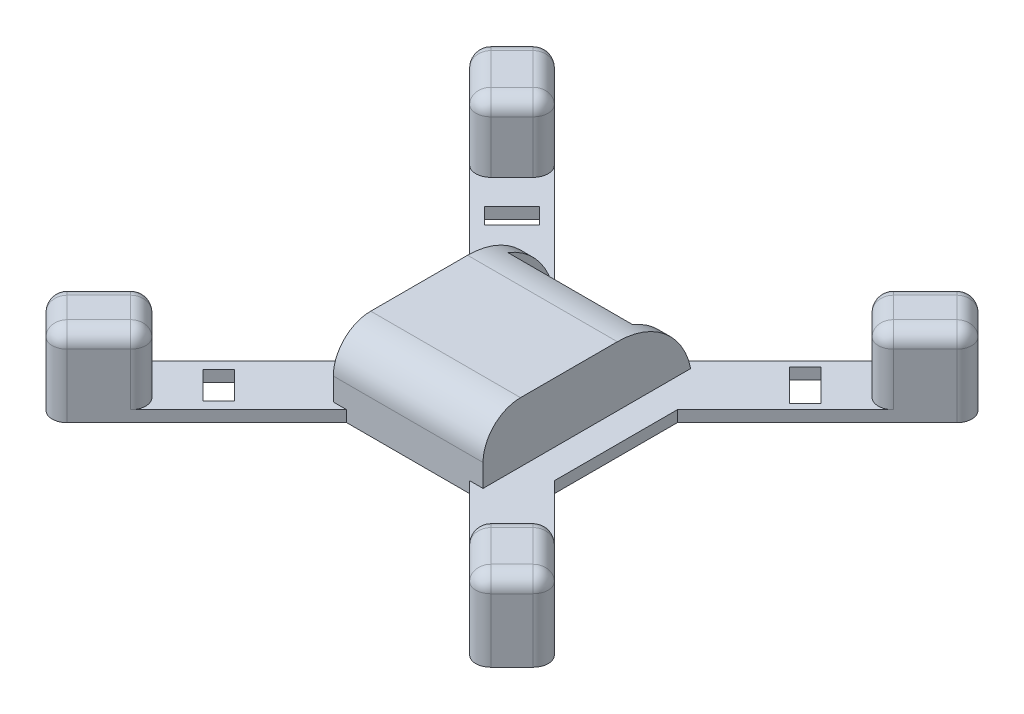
ISO-10303-21;
HEADER;
FILE_DESCRIPTION(('STEP AP214'),'2;1');
FILE_NAME('part.step','',(''),(''),'','','');
FILE_SCHEMA(('AUTOMOTIVE_DESIGN { 1 0 10303 214 1 1 1 1 }'));
ENDSEC;
DATA;
#1=APPLICATION_CONTEXT('core data for automotive mechanical design processes');
#2=APPLICATION_PROTOCOL_DEFINITION('international standard','automotive_design',2000,#1);
#3=PRODUCT_CONTEXT('',#1,'mechanical');
#4=PRODUCT('Part','Part','',(#3));
#5=PRODUCT_RELATED_PRODUCT_CATEGORY('part','',(#4));
#6=PRODUCT_DEFINITION_FORMATION('','',#4);
#7=PRODUCT_DEFINITION_CONTEXT('part definition',#1,'design');
#8=PRODUCT_DEFINITION('design','',#6,#7);
#9=PRODUCT_DEFINITION_SHAPE('','',#8);
#10=(LENGTH_UNIT() NAMED_UNIT(*) SI_UNIT(.MILLI.,.METRE.));
#11=(NAMED_UNIT(*) PLANE_ANGLE_UNIT() SI_UNIT($,.RADIAN.));
#12=(NAMED_UNIT(*) SI_UNIT($,.STERADIAN.) SOLID_ANGLE_UNIT());
#13=UNCERTAINTY_MEASURE_WITH_UNIT(LENGTH_MEASURE(1.E-05),#10,'distance_accuracy_value','');
#14=(GEOMETRIC_REPRESENTATION_CONTEXT(3) GLOBAL_UNCERTAINTY_ASSIGNED_CONTEXT((#13)) GLOBAL_UNIT_ASSIGNED_CONTEXT((#10,
#11,#12)) REPRESENTATION_CONTEXT('',''));
#15=CARTESIAN_POINT('',(0.,0.,0.));
#16=DIRECTION('',(0.,0.,1.));
#17=DIRECTION('',(1.,0.,0.));
#18=AXIS2_PLACEMENT_3D('',#15,#16,#17);
#19=CARTESIAN_POINT('',(0.,1.5,0.));
#20=DIRECTION('',(0.,-1.,0.));
#21=DIRECTION('',(0.,0.,-1.));
#22=AXIS2_PLACEMENT_3D('',#19,#20,#21);
#23=PLANE('',#22);
#24=DIRECTION('',(-0.707106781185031,0.,0.707106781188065));
#25=VECTOR('',#24,1.);
#26=CARTESIAN_POINT('',(-1.82842712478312,1.5,-1.82842712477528));
#27=LINE('',#26,#25);
#28=CARTESIAN_POINT('',(-20.3502813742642,1.5,16.6934271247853));
#29=VERTEX_POINT('',#28);
#30=CARTESIAN_POINT('',(-22.4716017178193,1.5,18.8147474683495));
#31=VERTEX_POINT('',#30);
#32=EDGE_CURVE('E662',#29,#31,#27,.T.);
#33=ORIENTED_EDGE('',*,*,#32,.F.);
#34=DIRECTION('',(0.707106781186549,0.,0.707106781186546));
#35=VECTOR('',#34,1.);
#36=CARTESIAN_POINT('',(-18.5218542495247,1.5,18.5218542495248));
#37=LINE('',#36,#35);
#38=CARTESIAN_POINT('',(-16.69342712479,1.5,20.3502813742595));
#39=VERTEX_POINT('',#38);
#40=EDGE_CURVE('E665',#29,#39,#37,.T.);
#41=ORIENTED_EDGE('',*,*,#40,.T.);
#42=DIRECTION('',(0.707106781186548,0.,-0.707106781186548));
#43=VECTOR('',#42,1.);
#44=CARTESIAN_POINT('',(1.82842712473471,1.5,1.82842712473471));
#45=LINE('',#44,#43);
#46=CARTESIAN_POINT('',(-18.8147474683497,1.5,22.4716017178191));
#47=VERTEX_POINT('',#46);
#48=EDGE_CURVE('E657',#47,#39,#45,.T.);
#49=ORIENTED_EDGE('',*,*,#48,.F.);
#50=DIRECTION('',(0.707106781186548,0.,0.707106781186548));
#51=VECTOR('',#50,1.);
#52=CARTESIAN_POINT('',(-20.6431745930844,1.5,20.6431745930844));
#53=LINE('',#52,#51);
#54=EDGE_CURVE('E670',#31,#47,#53,.T.);
#55=ORIENTED_EDGE('',*,*,#54,.F.);
#56=EDGE_LOOP('',(#33,#41,#49,#55));
#57=FACE_BOUND('',#56,.T.);
#58=DIRECTION('',(1.,0.,0.));
#59=VECTOR('',#58,1.);
#60=CARTESIAN_POINT('',(10.,1.5,13.865));
#61=LINE('',#60,#59);
#62=CARTESIAN_POINT('',(-10.,1.5,13.865));
#63=VERTEX_POINT('',#62);
#64=CARTESIAN_POINT('',(-8.20814575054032,1.5,13.8650000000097));
#65=VERTEX_POINT('',#64);
#66=EDGE_CURVE('E836',#63,#65,#61,.T.);
#67=ORIENTED_EDGE('',*,*,#66,.F.);
#68=DIRECTION('',(0.,0.,1.));
#69=VECTOR('',#68,1.);
#70=CARTESIAN_POINT('',(-10.,1.5,-13.865));
#71=LINE('',#70,#69);
#72=CARTESIAN_POINT('',(-10.,1.5,-13.865));
#73=VERTEX_POINT('',#72);
#74=EDGE_CURVE('E825',#73,#63,#71,.T.);
#75=ORIENTED_EDGE('',*,*,#74,.F.);
#76=DIRECTION('',(-1.,0.,0.));
#77=VECTOR('',#76,1.);
#78=CARTESIAN_POINT('',(10.,1.5,-13.865));
#79=LINE('',#78,#77);
#80=CARTESIAN_POINT('',(-8.35,1.5,-13.8650000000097));
#81=VERTEX_POINT('',#80);
#82=EDGE_CURVE('E842',#81,#73,#79,.T.);
#83=ORIENTED_EDGE('',*,*,#82,.F.);
#84=CARTESIAN_POINT('',(-8.20814575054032,1.5,-13.8650000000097));
#85=VERTEX_POINT('',#84);
#86=EDGE_CURVE('E845',#85,#81,#79,.T.);
#87=ORIENTED_EDGE('',*,*,#86,.F.);
#88=DIRECTION('',(0.707106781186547,0.,0.707106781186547));
#89=VECTOR('',#88,1.);
#90=CARTESIAN_POINT('',(-28.2842712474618,1.5,-33.9411254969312));
#91=LINE('',#90,#89);
#92=CARTESIAN_POINT('',(-22.6274169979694,1.5,-28.2842712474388));
#93=VERTEX_POINT('',#92);
#94=EDGE_CURVE('E1573',#93,#85,#91,.T.);
#95=ORIENTED_EDGE('',*,*,#94,.F.);
#96=CARTESIAN_POINT('',(-24.0416305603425,1.5,-26.8700576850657));
#97=DIRECTION('',(0.,-1.,0.));
#98=DIRECTION('',(0.,0.,-1.));
#99=AXIS2_PLACEMENT_3D('',#96,#97,#98);
#100=CIRCLE('',#99,2.);
#101=CARTESIAN_POINT('',(-22.6274169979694,1.5,-25.4558441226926));
#102=VERTEX_POINT('',#101);
#103=EDGE_CURVE('E973',#93,#102,#100,.T.);
#104=ORIENTED_EDGE('',*,*,#103,.T.);
#105=DIRECTION('',(0.707106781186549,0.,-0.707106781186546));
#106=VECTOR('',#105,1.);
#107=CARTESIAN_POINT('',(-24.041630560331,1.5,-24.041630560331));
#108=LINE('',#107,#106);
#109=CARTESIAN_POINT('',(-25.4558441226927,1.5,-22.6274169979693));
#110=VERTEX_POINT('',#109);
#111=EDGE_CURVE('E858',#110,#102,#108,.T.);
#112=ORIENTED_EDGE('',*,*,#111,.F.);
#113=CARTESIAN_POINT('',(-26.8700576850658,1.5,-24.0416305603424));
#114=DIRECTION('',(0.,-1.,0.));
#115=DIRECTION('',(0.,0.,-1.));
#116=AXIS2_PLACEMENT_3D('',#113,#114,#115);
#117=CIRCLE('',#116,2.);
#118=CARTESIAN_POINT('',(-28.2842712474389,1.5,-22.6274169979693));
#119=VERTEX_POINT('',#118);
#120=EDGE_CURVE('E970',#110,#119,#117,.T.);
#121=ORIENTED_EDGE('',*,*,#120,.T.);
#122=DIRECTION('',(0.707106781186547,0.,0.707106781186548));
#123=VECTOR('',#122,1.);
#124=CARTESIAN_POINT('',(-33.9411254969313,1.5,-28.2842712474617));
#125=LINE('',#124,#123);
#126=CARTESIAN_POINT('',(-13.865000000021,1.5,-8.20814575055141));
#127=VERTEX_POINT('',#126);
#128=EDGE_CURVE('E1563',#119,#127,#125,.T.);
#129=ORIENTED_EDGE('',*,*,#128,.T.);
#130=DIRECTION('',(0.,0.,-1.));
#131=VECTOR('',#130,1.);
#132=CARTESIAN_POINT('',(-13.865000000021,1.5,8.20814575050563));
#133=LINE('',#132,#131);
#134=CARTESIAN_POINT('',(-13.865000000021,1.5,8.20814575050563));
#135=VERTEX_POINT('',#134);
#136=EDGE_CURVE('E1560',#135,#127,#133,.T.);
#137=ORIENTED_EDGE('',*,*,#136,.F.);
#138=DIRECTION('',(0.707106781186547,0.,-0.707106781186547));
#139=VECTOR('',#138,1.);
#140=CARTESIAN_POINT('',(-33.9411254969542,1.5,28.2842712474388));
#141=LINE('',#140,#139);
#142=CARTESIAN_POINT('',(-28.2842712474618,1.5,22.6274169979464));
#143=VERTEX_POINT('',#142);
#144=EDGE_CURVE('E1553',#143,#135,#141,.T.);
#145=ORIENTED_EDGE('',*,*,#144,.F.);
#146=CARTESIAN_POINT('',(-26.8700576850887,1.5,24.0416305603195));
#147=DIRECTION('',(0.,-1.,0.));
#148=DIRECTION('',(0.,0.,-1.));
#149=AXIS2_PLACEMENT_3D('',#146,#147,#148);
#150=CIRCLE('',#149,2.);
#151=CARTESIAN_POINT('',(-25.4558441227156,1.5,22.6274169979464));
#152=VERTEX_POINT('',#151);
#153=EDGE_CURVE('E965',#143,#152,#150,.T.);
#154=ORIENTED_EDGE('',*,*,#153,.T.);
#155=DIRECTION('',(0.707106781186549,0.,0.707106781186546));
#156=VECTOR('',#155,1.);
#157=CARTESIAN_POINT('',(-24.041630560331,1.5,24.041630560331));
#158=LINE('',#157,#156);
#159=CARTESIAN_POINT('',(-22.6274169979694,1.5,25.4558441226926));
#160=VERTEX_POINT('',#159);
#161=EDGE_CURVE('E849',#152,#160,#158,.T.);
#162=ORIENTED_EDGE('',*,*,#161,.T.);
#163=CARTESIAN_POINT('',(-24.0416305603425,1.5,26.8700576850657));
#164=DIRECTION('',(0.,-1.,0.));
#165=DIRECTION('',(0.,0.,-1.));
#166=AXIS2_PLACEMENT_3D('',#163,#164,#165);
#167=CIRCLE('',#166,2.);
#168=CARTESIAN_POINT('',(-22.6274169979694,1.5,28.2842712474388));
#169=VERTEX_POINT('',#168);
#170=EDGE_CURVE('E967',#160,#169,#167,.T.);
#171=ORIENTED_EDGE('',*,*,#170,.T.);
#172=DIRECTION('',(0.707106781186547,0.,-0.707106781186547));
#173=VECTOR('',#172,1.);
#174=CARTESIAN_POINT('',(-28.2842712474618,1.5,33.9411254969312));
#175=LINE('',#174,#173);
#176=EDGE_CURVE('E1551',#169,#65,#175,.T.);
#177=ORIENTED_EDGE('',*,*,#176,.T.);
#178=EDGE_LOOP('',(#67,#75,#83,#87,#95,#104,#112,#121,#129,#137,#145,#154,#162,#171,#177));
#179=FACE_BOUND('',#178,.T.);
#180=DIRECTION('',(-0.707106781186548,0.,0.707106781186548));
#181=VECTOR('',#180,1.);
#182=CARTESIAN_POINT('',(-20.6431745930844,1.5,-20.6431745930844));
#183=LINE('',#182,#181);
#184=CARTESIAN_POINT('',(-18.8147474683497,1.5,-22.4716017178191));
#185=VERTEX_POINT('',#184);
#186=CARTESIAN_POINT('',(-22.4716017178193,1.5,-18.8147474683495));
#187=VERTEX_POINT('',#186);
#188=EDGE_CURVE('E647',#185,#187,#183,.T.);
#189=ORIENTED_EDGE('',*,*,#188,.F.);
#190=DIRECTION('',(-0.707106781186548,0.,-0.707106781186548));
#191=VECTOR('',#190,1.);
#192=CARTESIAN_POINT('',(1.82842712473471,1.5,-1.82842712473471));
#193=LINE('',#192,#191);
#194=CARTESIAN_POINT('',(-16.69342712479,1.5,-20.3502813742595));
#195=VERTEX_POINT('',#194);
#196=EDGE_CURVE('E650',#195,#185,#193,.T.);
#197=ORIENTED_EDGE('',*,*,#196,.F.);
#198=DIRECTION('',(0.707106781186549,0.,-0.707106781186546));
#199=VECTOR('',#198,1.);
#200=CARTESIAN_POINT('',(-18.5218542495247,1.5,-18.5218542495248));
#201=LINE('',#200,#199);
#202=CARTESIAN_POINT('',(-20.3502813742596,1.5,-16.6934271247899));
#203=VERTEX_POINT('',#202);
#204=EDGE_CURVE('E645',#203,#195,#201,.T.);
#205=ORIENTED_EDGE('',*,*,#204,.F.);
#206=DIRECTION('',(0.707106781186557,0.,0.707106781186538));
#207=VECTOR('',#206,1.);
#208=CARTESIAN_POINT('',(-1.82842712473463,1.5,1.82842712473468));
#209=LINE('',#208,#207);
#210=EDGE_CURVE('E652',#187,#203,#209,.T.);
#211=ORIENTED_EDGE('',*,*,#210,.F.);
#212=EDGE_LOOP('',(#189,#197,#205,#211));
#213=FACE_BOUND('',#212,.T.);
#214=ADVANCED_FACE('F35',(#57,#179,#213),#23,.F.);
#215=CARTESIAN_POINT('',(0.,1.,0.));
#216=DIRECTION('',(0.,-1.,0.));
#217=DIRECTION('',(0.,0.,-1.));
#218=AXIS2_PLACEMENT_3D('',#215,#216,#217);
#219=PLANE('',#218);
#220=DIRECTION('',(-0.707106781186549,0.,-0.707106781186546));
#221=VECTOR('',#220,1.);
#222=CARTESIAN_POINT('',(18.5218542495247,1.,-18.5218542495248));
#223=LINE('',#222,#221);
#224=CARTESIAN_POINT('',(20.3502813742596,1.,-16.6934271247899));
#225=VERTEX_POINT('',#224);
#226=CARTESIAN_POINT('',(16.6934271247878,1.,-20.3502813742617));
#227=VERTEX_POINT('',#226);
#228=EDGE_CURVE('E600',#225,#227,#223,.T.);
#229=ORIENTED_EDGE('',*,*,#228,.F.);
#230=DIRECTION('',(0.707106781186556,0.,-0.707106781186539));
#231=VECTOR('',#230,1.);
#232=CARTESIAN_POINT('',(1.82842712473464,1.,1.82842712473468));
#233=LINE('',#232,#231);
#234=CARTESIAN_POINT('',(11.865000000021,1.,-8.20814575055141));
#235=VERTEX_POINT('',#234);
#236=EDGE_CURVE('E708',#235,#225,#233,.T.);
#237=ORIENTED_EDGE('',*,*,#236,.F.);
#238=DIRECTION('',(0.,0.,-1.));
#239=VECTOR('',#238,1.);
#240=CARTESIAN_POINT('',(11.865000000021,1.,0.));
#241=LINE('',#240,#239);
#242=CARTESIAN_POINT('',(11.865000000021,1.,8.20814575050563));
#243=VERTEX_POINT('',#242);
#244=EDGE_CURVE('E711',#243,#235,#241,.T.);
#245=ORIENTED_EDGE('',*,*,#244,.F.);
#246=DIRECTION('',(0.70710678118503,0.,0.707106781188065));
#247=VECTOR('',#246,1.);
#248=CARTESIAN_POINT('',(1.82842712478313,1.,-1.82842712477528));
#249=LINE('',#248,#247);
#250=CARTESIAN_POINT('',(20.3502813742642,1.,16.6934271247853));
#251=VERTEX_POINT('',#250);
#252=EDGE_CURVE('E713',#243,#251,#249,.T.);
#253=ORIENTED_EDGE('',*,*,#252,.T.);
#254=DIRECTION('',(-0.707106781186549,0.,0.707106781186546));
#255=VECTOR('',#254,1.);
#256=CARTESIAN_POINT('',(18.5218542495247,1.,18.5218542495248));
#257=LINE('',#256,#255);
#258=CARTESIAN_POINT('',(16.6934271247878,1.,20.3502813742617));
#259=VERTEX_POINT('',#258);
#260=EDGE_CURVE('E43',#251,#259,#257,.T.);
#261=ORIENTED_EDGE('',*,*,#260,.T.);
#262=DIRECTION('',(0.707106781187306,0.,0.707106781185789));
#263=VECTOR('',#262,1.);
#264=CARTESIAN_POINT('',(-1.82842712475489,1.,1.82842712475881));
#265=LINE('',#264,#263);
#266=CARTESIAN_POINT('',(8.20814575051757,1.,11.8650000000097));
#267=VERTEX_POINT('',#266);
#268=EDGE_CURVE('E716',#267,#259,#265,.T.);
#269=ORIENTED_EDGE('',*,*,#268,.F.);
#270=DIRECTION('',(-1.,0.,0.));
#271=VECTOR('',#270,1.);
#272=CARTESIAN_POINT('',(0.,1.,11.8650000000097));
#273=LINE('',#272,#271);
#274=CARTESIAN_POINT('',(-8.20814575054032,1.,11.8650000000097));
#275=VERTEX_POINT('',#274);
#276=EDGE_CURVE('E719',#267,#275,#273,.T.);
#277=ORIENTED_EDGE('',*,*,#276,.T.);
#278=DIRECTION('',(-0.707106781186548,0.,0.707106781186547));
#279=VECTOR('',#278,1.);
#280=CARTESIAN_POINT('',(1.82842712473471,1.,1.82842712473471));
#281=LINE('',#280,#279);
#282=CARTESIAN_POINT('',(-16.69342712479,1.,20.3502813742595));
#283=VERTEX_POINT('',#282);
#284=EDGE_CURVE('E688',#275,#283,#281,.T.);
#285=ORIENTED_EDGE('',*,*,#284,.T.);
#286=DIRECTION('',(0.707106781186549,0.,0.707106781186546));
#287=VECTOR('',#286,1.);
#288=CARTESIAN_POINT('',(-18.5218542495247,1.,18.5218542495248));
#289=LINE('',#288,#287);
#290=CARTESIAN_POINT('',(-20.3502813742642,1.,16.6934271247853));
#291=VERTEX_POINT('',#290);
#292=EDGE_CURVE('E668',#291,#283,#289,.T.);
#293=ORIENTED_EDGE('',*,*,#292,.F.);
#294=DIRECTION('',(-0.707106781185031,0.,0.707106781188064));
#295=VECTOR('',#294,1.);
#296=CARTESIAN_POINT('',(-1.82842712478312,1.,-1.82842712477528));
#297=LINE('',#296,#295);
#298=CARTESIAN_POINT('',(-11.865000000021,1.,8.20814575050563));
#299=VERTEX_POINT('',#298);
#300=EDGE_CURVE('E691',#299,#291,#297,.T.);
#301=ORIENTED_EDGE('',*,*,#300,.F.);
#302=DIRECTION('',(0.,0.,-1.));
#303=VECTOR('',#302,1.);
#304=CARTESIAN_POINT('',(-11.865000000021,1.,0.));
#305=LINE('',#304,#303);
#306=CARTESIAN_POINT('',(-11.865000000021,1.,-8.20814575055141));
#307=VERTEX_POINT('',#306);
#308=EDGE_CURVE('E695',#299,#307,#305,.T.);
#309=ORIENTED_EDGE('',*,*,#308,.T.);
#310=DIRECTION('',(-0.707106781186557,0.,-0.707106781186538));
#311=VECTOR('',#310,1.);
#312=CARTESIAN_POINT('',(-1.82842712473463,1.,1.82842712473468));
#313=LINE('',#312,#311);
#314=CARTESIAN_POINT('',(-20.3502813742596,1.,-16.6934271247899));
#315=VERTEX_POINT('',#314);
#316=EDGE_CURVE('E698',#307,#315,#313,.T.);
#317=ORIENTED_EDGE('',*,*,#316,.T.);
#318=DIRECTION('',(0.707106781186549,0.,-0.707106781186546));
#319=VECTOR('',#318,1.);
#320=CARTESIAN_POINT('',(-18.5218542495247,1.,-18.5218542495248));
#321=LINE('',#320,#319);
#322=CARTESIAN_POINT('',(-16.69342712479,1.,-20.3502813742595));
#323=VERTEX_POINT('',#322);
#324=EDGE_CURVE('E640',#315,#323,#321,.T.);
#325=ORIENTED_EDGE('',*,*,#324,.T.);
#326=DIRECTION('',(-0.707106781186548,0.,-0.707106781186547));
#327=VECTOR('',#326,1.);
#328=CARTESIAN_POINT('',(1.82842712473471,1.,-1.82842712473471));
#329=LINE('',#328,#327);
#330=CARTESIAN_POINT('',(-8.20814575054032,1.,-11.8650000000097));
#331=VERTEX_POINT('',#330);
#332=EDGE_CURVE('E701',#331,#323,#329,.T.);
#333=ORIENTED_EDGE('',*,*,#332,.F.);
#334=DIRECTION('',(-1.,0.,0.));
#335=VECTOR('',#334,1.);
#336=CARTESIAN_POINT('',(0.,1.,-11.8650000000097));
#337=LINE('',#336,#335);
#338=CARTESIAN_POINT('',(8.20814575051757,1.,-11.8650000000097));
#339=VERTEX_POINT('',#338);
#340=EDGE_CURVE('E703',#339,#331,#337,.T.);
#341=ORIENTED_EDGE('',*,*,#340,.F.);
#342=DIRECTION('',(0.707106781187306,0.,-0.707106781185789));
#343=VECTOR('',#342,1.);
#344=CARTESIAN_POINT('',(-1.82842712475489,1.,-1.82842712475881));
#345=LINE('',#344,#343);
#346=EDGE_CURVE('E705',#339,#227,#345,.T.);
#347=ORIENTED_EDGE('',*,*,#346,.T.);
#348=EDGE_LOOP('',(#229,#237,#245,#253,#261,#269,#277,#285,#293,#301,#309,#317,#325,#333,#341,#347));
#349=FACE_BOUND('',#348,.T.);
#350=ADVANCED_FACE('F1124',(#349),#219,.T.);
#351=DIRECTION('',(0.707106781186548,0.,-0.707106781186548));
#352=VECTOR('',#351,1.);
#353=CARTESIAN_POINT('',(2.12132034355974,1.5,2.12132034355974));
#354=LINE('',#353,#352);
#355=CARTESIAN_POINT('',(20.6431745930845,1.5,-16.400533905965));
#356=VERTEX_POINT('',#355);
#357=CARTESIAN_POINT('',(22.7644949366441,1.5,-18.5218542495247));
#358=VERTEX_POINT('',#357);
#359=EDGE_CURVE('E612',#356,#358,#354,.T.);
#360=ORIENTED_EDGE('',*,*,#359,.F.);
#361=DIRECTION('',(-0.707106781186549,0.,-0.707106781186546));
#362=VECTOR('',#361,1.);
#363=CARTESIAN_POINT('',(18.5218542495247,1.5,-18.5218542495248));
#364=LINE('',#363,#362);
#365=CARTESIAN_POINT('',(16.4005339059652,1.5,-20.6431745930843));
#366=VERTEX_POINT('',#365);
#367=EDGE_CURVE('E577',#356,#366,#364,.T.);
#368=ORIENTED_EDGE('',*,*,#367,.T.);
#369=DIRECTION('',(0.707106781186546,0.,-0.707106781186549));
#370=VECTOR('',#369,1.);
#371=CARTESIAN_POINT('',(-2.1213203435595,1.5,-2.12132034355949));
#372=LINE('',#371,#370);
#373=CARTESIAN_POINT('',(18.5218542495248,1.5,-22.7644949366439));
#374=VERTEX_POINT('',#373);
#375=EDGE_CURVE('E609',#366,#374,#372,.T.);
#376=ORIENTED_EDGE('',*,*,#375,.T.);
#377=DIRECTION('',(-0.707106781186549,0.,-0.707106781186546));
#378=VECTOR('',#377,1.);
#379=CARTESIAN_POINT('',(20.6431745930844,1.5,-20.6431745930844));
#380=LINE('',#379,#378);
#381=EDGE_CURVE('E597',#358,#374,#380,.T.);
#382=ORIENTED_EDGE('',*,*,#381,.F.);
#383=EDGE_LOOP('',(#360,#368,#376,#382));
#384=FACE_BOUND('',#383,.T.);
#385=CARTESIAN_POINT('',(8.20814575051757,1.5,13.8650000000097));
#386=VERTEX_POINT('',#385);
#387=CARTESIAN_POINT('',(10.,1.5,13.865));
#388=VERTEX_POINT('',#387);
#389=EDGE_CURVE('E835',#386,#388,#61,.T.);
#390=ORIENTED_EDGE('',*,*,#389,.F.);
#391=DIRECTION('',(-0.707106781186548,0.,-0.707106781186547));
#392=VECTOR('',#391,1.);
#393=CARTESIAN_POINT('',(28.2842712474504,1.5,33.9411254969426));
#394=LINE('',#393,#392);
#395=CARTESIAN_POINT('',(22.627416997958,1.5,28.2842712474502));
#396=VERTEX_POINT('',#395);
#397=EDGE_CURVE('E1523',#396,#386,#394,.T.);
#398=ORIENTED_EDGE('',*,*,#397,.F.);
#399=CARTESIAN_POINT('',(24.0416305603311,1.5,26.8700576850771));
#400=DIRECTION('',(0.,-1.,0.));
#401=DIRECTION('',(0.,0.,-1.));
#402=AXIS2_PLACEMENT_3D('',#399,#400,#401);
#403=CIRCLE('',#402,2.);
#404=CARTESIAN_POINT('',(22.627416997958,1.5,25.455844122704));
#405=VERTEX_POINT('',#404);
#406=EDGE_CURVE('E980',#396,#405,#403,.T.);
#407=ORIENTED_EDGE('',*,*,#406,.T.);
#408=DIRECTION('',(-0.707106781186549,0.,0.707106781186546));
#409=VECTOR('',#408,1.);
#410=CARTESIAN_POINT('',(24.041630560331,1.5,24.041630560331));
#411=LINE('',#410,#409);
#412=CARTESIAN_POINT('',(25.4558441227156,1.5,22.6274169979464));
#413=VERTEX_POINT('',#412);
#414=EDGE_CURVE('E852',#413,#405,#411,.T.);
#415=ORIENTED_EDGE('',*,*,#414,.F.);
#416=CARTESIAN_POINT('',(26.8700576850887,1.5,24.0416305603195));
#417=DIRECTION('',(0.,-1.,0.));
#418=DIRECTION('',(0.,0.,-1.));
#419=AXIS2_PLACEMENT_3D('',#416,#417,#418);
#420=CIRCLE('',#419,2.);
#421=CARTESIAN_POINT('',(28.2842712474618,1.5,22.6274169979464));
#422=VERTEX_POINT('',#421);
#423=EDGE_CURVE('E982',#413,#422,#420,.T.);
#424=ORIENTED_EDGE('',*,*,#423,.T.);
#425=DIRECTION('',(-0.707106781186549,0.,-0.707106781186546));
#426=VECTOR('',#425,1.);
#427=CARTESIAN_POINT('',(33.9411254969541,1.5,28.2842712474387));
#428=LINE('',#427,#426);
#429=CARTESIAN_POINT('',(13.865000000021,1.5,8.20814575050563));
#430=VERTEX_POINT('',#429);
#431=EDGE_CURVE('E1549',#422,#430,#428,.T.);
#432=ORIENTED_EDGE('',*,*,#431,.T.);
#433=DIRECTION('',(0.,0.,-1.));
#434=VECTOR('',#433,1.);
#435=CARTESIAN_POINT('',(13.865000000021,1.5,8.20814575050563));
#436=LINE('',#435,#434);
#437=CARTESIAN_POINT('',(13.865000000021,1.5,-8.20814575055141));
#438=VERTEX_POINT('',#437);
#439=EDGE_CURVE('E1555',#430,#438,#436,.T.);
#440=ORIENTED_EDGE('',*,*,#439,.T.);
#441=DIRECTION('',(-0.707106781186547,0.,0.707106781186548));
#442=VECTOR('',#441,1.);
#443=CARTESIAN_POINT('',(33.9411254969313,1.5,-28.2842712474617));
#444=LINE('',#443,#442);
#445=CARTESIAN_POINT('',(28.2842712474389,1.5,-22.6274169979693));
#446=VERTEX_POINT('',#445);
#447=EDGE_CURVE('E1845',#446,#438,#444,.T.);
#448=ORIENTED_EDGE('',*,*,#447,.F.);
#449=CARTESIAN_POINT('',(26.8700576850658,1.5,-24.0416305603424));
#450=DIRECTION('',(0.,-1.,0.));
#451=DIRECTION('',(0.,0.,-1.));
#452=AXIS2_PLACEMENT_3D('',#449,#450,#451);
#453=CIRCLE('',#452,2.);
#454=CARTESIAN_POINT('',(25.4558441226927,1.5,-22.6274169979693));
#455=VERTEX_POINT('',#454);
#456=EDGE_CURVE('E975',#446,#455,#453,.T.);
#457=ORIENTED_EDGE('',*,*,#456,.T.);
#458=DIRECTION('',(-0.707106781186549,0.,-0.707106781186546));
#459=VECTOR('',#458,1.);
#460=CARTESIAN_POINT('',(24.041630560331,1.5,-24.041630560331));
#461=LINE('',#460,#459);
#462=CARTESIAN_POINT('',(22.627416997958,1.5,-25.455844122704));
#463=VERTEX_POINT('',#462);
#464=EDGE_CURVE('E855',#455,#463,#461,.T.);
#465=ORIENTED_EDGE('',*,*,#464,.T.);
#466=CARTESIAN_POINT('',(24.0416305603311,1.5,-26.8700576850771));
#467=DIRECTION('',(0.,-1.,0.));
#468=DIRECTION('',(0.,0.,-1.));
#469=AXIS2_PLACEMENT_3D('',#466,#467,#468);
#470=CIRCLE('',#469,2.);
#471=CARTESIAN_POINT('',(22.627416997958,1.5,-28.2842712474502));
#472=VERTEX_POINT('',#471);
#473=EDGE_CURVE('E977',#463,#472,#470,.T.);
#474=ORIENTED_EDGE('',*,*,#473,.T.);
#475=DIRECTION('',(-0.707106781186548,0.,0.707106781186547));
#476=VECTOR('',#475,1.);
#477=CARTESIAN_POINT('',(28.2842712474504,1.5,-33.9411254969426));
#478=LINE('',#477,#476);
#479=CARTESIAN_POINT('',(8.20814575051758,1.5,-13.8650000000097));
#480=VERTEX_POINT('',#479);
#481=EDGE_CURVE('E1576',#472,#480,#478,.T.);
#482=ORIENTED_EDGE('',*,*,#481,.T.);
#483=DIRECTION('',(-1.,0.,0.));
#484=VECTOR('',#483,1.);
#485=CARTESIAN_POINT('',(0.,1.5,-13.8650000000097));
#486=LINE('',#485,#484);
#487=CARTESIAN_POINT('',(8.35,1.5,-13.8650000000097));
#488=VERTEX_POINT('',#487);
#489=EDGE_CURVE('E823',#488,#480,#486,.T.);
#490=ORIENTED_EDGE('',*,*,#489,.F.);
#491=CARTESIAN_POINT('',(10.,1.5,-13.865));
#492=VERTEX_POINT('',#491);
#493=EDGE_CURVE('E829',#492,#488,#79,.T.);
#494=ORIENTED_EDGE('',*,*,#493,.F.);
#495=DIRECTION('',(0.,0.,-1.));
#496=VECTOR('',#495,1.);
#497=CARTESIAN_POINT('',(10.,1.5,-13.865));
#498=LINE('',#497,#496);
#499=EDGE_CURVE('E839',#388,#492,#498,.T.);
#500=ORIENTED_EDGE('',*,*,#499,.F.);
#501=EDGE_LOOP('',(#390,#398,#407,#415,#424,#432,#440,#448,#457,#465,#474,#482,#490,#494,#500));
#502=FACE_BOUND('',#501,.T.);
#503=DIRECTION('',(-0.707106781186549,0.,0.707106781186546));
#504=VECTOR('',#503,1.);
#505=CARTESIAN_POINT('',(18.5218542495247,1.5,18.5218542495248));
#506=LINE('',#505,#504);
#507=CARTESIAN_POINT('',(20.3502813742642,1.5,16.6934271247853));
#508=VERTEX_POINT('',#507);
#509=CARTESIAN_POINT('',(16.6934271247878,1.5,20.3502813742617));
#510=VERTEX_POINT('',#509);
#511=EDGE_CURVE('E685',#508,#510,#506,.T.);
#512=ORIENTED_EDGE('',*,*,#511,.F.);
#513=DIRECTION('',(-0.70710678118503,0.,-0.707106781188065));
#514=VECTOR('',#513,1.);
#515=CARTESIAN_POINT('',(1.82842712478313,1.5,-1.82842712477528));
#516=LINE('',#515,#514);
#517=CARTESIAN_POINT('',(22.4716017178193,1.5,18.8147474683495));
#518=VERTEX_POINT('',#517);
#519=EDGE_CURVE('E676',#518,#508,#516,.T.);
#520=ORIENTED_EDGE('',*,*,#519,.F.);
#521=DIRECTION('',(0.707106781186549,0.,-0.707106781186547));
#522=VECTOR('',#521,1.);
#523=CARTESIAN_POINT('',(20.6431745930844,1.5,20.6431745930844));
#524=LINE('',#523,#522);
#525=CARTESIAN_POINT('',(18.8147474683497,1.5,22.4716017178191));
#526=VERTEX_POINT('',#525);
#527=EDGE_CURVE('E679',#526,#518,#524,.T.);
#528=ORIENTED_EDGE('',*,*,#527,.F.);
#529=DIRECTION('',(0.707106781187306,0.,0.707106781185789));
#530=VECTOR('',#529,1.);
#531=CARTESIAN_POINT('',(-1.82842712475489,1.5,1.82842712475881));
#532=LINE('',#531,#530);
#533=EDGE_CURVE('E682',#510,#526,#532,.T.);
#534=ORIENTED_EDGE('',*,*,#533,.F.);
#535=EDGE_LOOP('',(#512,#520,#528,#534));
#536=FACE_BOUND('',#535,.T.);
#537=ADVANCED_FACE('F1199',(#384,#502,#536),#23,.F.);
#538=CARTESIAN_POINT('',(-33.9411254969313,1.5,-28.2842712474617));
#539=DIRECTION('',(-0.707106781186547,0.,-0.707106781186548));
#540=DIRECTION('',(-0.707106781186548,0.,0.707106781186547));
#541=AXIS2_PLACEMENT_3D('',#538,#539,#540);
#542=PLANE('',#541);
#543=DIRECTION('',(0.707106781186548,0.,-0.707106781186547));
#544=VECTOR('',#543,1.);
#545=CARTESIAN_POINT('',(-33.9411254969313,0.,-28.2842712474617));
#546=LINE('',#545,#544);
#547=CARTESIAN_POINT('',(-32.5269119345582,0.,-29.6984848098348));
#548=VERTEX_POINT('',#547);
#549=CARTESIAN_POINT('',(-29.6984848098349,0.,-32.5269119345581));
#550=VERTEX_POINT('',#549);
#551=EDGE_CURVE('E867',#548,#550,#546,.T.);
#552=ORIENTED_EDGE('',*,*,#551,.F.);
#553=DIRECTION('',(0.,-1.,0.));
#554=VECTOR('',#553,1.);
#555=CARTESIAN_POINT('',(-32.5269119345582,10.5,-29.6984848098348));
#556=LINE('',#555,#554);
#557=CARTESIAN_POINT('',(-32.5269119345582,8.5,-29.6984848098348));
#558=VERTEX_POINT('',#557);
#559=EDGE_CURVE('E888',#548,#558,#556,.F.);
#560=ORIENTED_EDGE('',*,*,#559,.T.);
#561=DIRECTION('',(-0.707106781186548,0.,0.707106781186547));
#562=VECTOR('',#561,1.);
#563=CARTESIAN_POINT('',(-33.9411254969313,8.5,-28.2842712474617));
#564=LINE('',#563,#562);
#565=CARTESIAN_POINT('',(-29.6984848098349,8.5,-32.5269119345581));
#566=VERTEX_POINT('',#565);
#567=EDGE_CURVE('E886',#558,#566,#564,.F.);
#568=ORIENTED_EDGE('',*,*,#567,.T.);
#569=DIRECTION('',(0.,-1.,0.));
#570=VECTOR('',#569,1.);
#571=CARTESIAN_POINT('',(-29.6984848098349,1.5,-32.5269119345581));
#572=LINE('',#571,#570);
#573=EDGE_CURVE('E884',#566,#550,#572,.T.);
#574=ORIENTED_EDGE('',*,*,#573,.T.);
#575=EDGE_LOOP('',(#552,#560,#568,#574));
#576=FACE_BOUND('',#575,.T.);
#577=ADVANCED_FACE('F1202',(#576),#542,.T.);
#578=CARTESIAN_POINT('',(-33.9411254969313,1.5,-28.2842712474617));
#579=DIRECTION('',(0.707106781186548,0.,-0.707106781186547));
#580=DIRECTION('',(-0.707106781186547,0.,-0.707106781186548));
#581=AXIS2_PLACEMENT_3D('',#578,#579,#580);
#582=PLANE('',#581);
#583=ORIENTED_EDGE('',*,*,#128,.F.);
#584=DIRECTION('',(0.,-1.,0.));
#585=VECTOR('',#584,1.);
#586=CARTESIAN_POINT('',(-28.2842712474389,1.5,-22.6274169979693));
#587=LINE('',#586,#585);
#588=CARTESIAN_POINT('',(-28.2842712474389,8.5,-22.6274169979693));
#589=VERTEX_POINT('',#588);
#590=EDGE_CURVE('E894',#119,#589,#587,.F.);
#591=ORIENTED_EDGE('',*,*,#590,.T.);
#592=DIRECTION('',(0.707106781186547,0.,0.707106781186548));
#593=VECTOR('',#592,1.);
#594=CARTESIAN_POINT('',(-33.9411254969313,8.5,-28.2842712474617));
#595=LINE('',#594,#593);
#596=CARTESIAN_POINT('',(-32.5269119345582,8.5,-26.8700576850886));
#597=VERTEX_POINT('',#596);
#598=EDGE_CURVE('E892',#589,#597,#595,.F.);
#599=ORIENTED_EDGE('',*,*,#598,.T.);
#600=DIRECTION('',(0.,-1.,0.));
#601=VECTOR('',#600,1.);
#602=CARTESIAN_POINT('',(-32.5269119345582,0.,-26.8700576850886));
#603=LINE('',#602,#601);
#604=CARTESIAN_POINT('',(-32.5269119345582,0.,-26.8700576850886));
#605=VERTEX_POINT('',#604);
#606=EDGE_CURVE('E890',#597,#605,#603,.T.);
#607=ORIENTED_EDGE('',*,*,#606,.T.);
#608=DIRECTION('',(0.707106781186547,0.,0.707106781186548));
#609=VECTOR('',#608,1.);
#610=CARTESIAN_POINT('',(-33.9411254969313,0.,-28.2842712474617));
#611=LINE('',#610,#609);
#612=CARTESIAN_POINT('',(-13.865000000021,0.,-8.20814575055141));
#613=VERTEX_POINT('',#612);
#614=EDGE_CURVE('E1577',#605,#613,#611,.T.);
#615=ORIENTED_EDGE('',*,*,#614,.T.);
#616=DIRECTION('',(0.,-1.,0.));
#617=VECTOR('',#616,1.);
#618=CARTESIAN_POINT('',(-13.865000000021,1.5,-8.20814575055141));
#619=LINE('',#618,#617);
#620=EDGE_CURVE('E1582',#127,#613,#619,.T.);
#621=ORIENTED_EDGE('',*,*,#620,.F.);
#622=EDGE_LOOP('',(#583,#591,#599,#607,#615,#621));
#623=FACE_BOUND('',#622,.T.);
#624=ADVANCED_FACE('F1245',(#623),#582,.F.);
#625=CARTESIAN_POINT('',(-13.865000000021,1.5,8.20814575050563));
#626=DIRECTION('',(-1.,0.,0.));
#627=DIRECTION('',(0.,0.,1.));
#628=AXIS2_PLACEMENT_3D('',#625,#626,#627);
#629=PLANE('',#628);
#630=DIRECTION('',(0.,0.,-1.));
#631=VECTOR('',#630,1.);
#632=CARTESIAN_POINT('',(-13.865000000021,0.,8.20814575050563));
#633=LINE('',#632,#631);
#634=CARTESIAN_POINT('',(-13.865000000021,0.,8.20814575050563));
#635=VERTEX_POINT('',#634);
#636=EDGE_CURVE('E1744',#635,#613,#633,.T.);
#637=ORIENTED_EDGE('',*,*,#636,.F.);
#638=DIRECTION('',(0.,-1.,0.));
#639=VECTOR('',#638,1.);
#640=CARTESIAN_POINT('',(-13.865000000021,1.5,8.20814575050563));
#641=LINE('',#640,#639);
#642=EDGE_CURVE('E1750',#135,#635,#641,.T.);
#643=ORIENTED_EDGE('',*,*,#642,.F.);
#644=ORIENTED_EDGE('',*,*,#136,.T.);
#645=ORIENTED_EDGE('',*,*,#620,.T.);
#646=EDGE_LOOP('',(#637,#643,#644,#645));
#647=FACE_BOUND('',#646,.T.);
#648=ADVANCED_FACE('F1248',(#647),#629,.T.);
#649=CARTESIAN_POINT('',(-33.9411254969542,1.5,28.2842712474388));
#650=DIRECTION('',(-0.707106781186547,0.,-0.707106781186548));
#651=DIRECTION('',(-0.707106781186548,0.,0.707106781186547));
#652=AXIS2_PLACEMENT_3D('',#649,#650,#651);
#653=PLANE('',#652);
#654=DIRECTION('',(0.,-1.,0.));
#655=VECTOR('',#654,1.);
#656=CARTESIAN_POINT('',(-28.2842712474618,1.5,22.6274169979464));
#657=LINE('',#656,#655);
#658=CARTESIAN_POINT('',(-28.2842712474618,8.5,22.6274169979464));
#659=VERTEX_POINT('',#658);
#660=EDGE_CURVE('E1645',#659,#143,#657,.T.);
#661=ORIENTED_EDGE('',*,*,#660,.T.);
#662=ORIENTED_EDGE('',*,*,#144,.T.);
#663=ORIENTED_EDGE('',*,*,#642,.T.);
#664=DIRECTION('',(0.707106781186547,0.,-0.707106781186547));
#665=VECTOR('',#664,1.);
#666=CARTESIAN_POINT('',(-33.9411254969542,0.,28.2842712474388));
#667=LINE('',#666,#665);
#668=CARTESIAN_POINT('',(-32.5269119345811,0.,26.8700576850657));
#669=VERTEX_POINT('',#668);
#670=EDGE_CURVE('E1742',#669,#635,#667,.T.);
#671=ORIENTED_EDGE('',*,*,#670,.F.);
#672=DIRECTION('',(0.,-1.,0.));
#673=VECTOR('',#672,1.);
#674=CARTESIAN_POINT('',(-32.5269119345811,10.5,26.8700576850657));
#675=LINE('',#674,#673);
#676=CARTESIAN_POINT('',(-32.5269119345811,8.5,26.8700576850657));
#677=VERTEX_POINT('',#676);
#678=EDGE_CURVE('E1641',#669,#677,#675,.F.);
#679=ORIENTED_EDGE('',*,*,#678,.T.);
#680=DIRECTION('',(-0.707106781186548,0.,0.707106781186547));
#681=VECTOR('',#680,1.);
#682=CARTESIAN_POINT('',(-33.9411254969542,8.5,28.2842712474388));
#683=LINE('',#682,#681);
#684=EDGE_CURVE('E1643',#677,#659,#683,.F.);
#685=ORIENTED_EDGE('',*,*,#684,.T.);
#686=EDGE_LOOP('',(#661,#662,#663,#671,#679,#685));
#687=FACE_BOUND('',#686,.T.);
#688=ADVANCED_FACE('F1252',(#687),#653,.T.);
#689=CARTESIAN_POINT('',(-33.9411254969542,1.5,28.2842712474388));
#690=DIRECTION('',(0.707106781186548,0.,-0.707106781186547));
#691=DIRECTION('',(-0.707106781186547,0.,-0.707106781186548));
#692=AXIS2_PLACEMENT_3D('',#689,#690,#691);
#693=PLANE('',#692);
#694=DIRECTION('',(0.707106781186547,0.,0.707106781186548));
#695=VECTOR('',#694,1.);
#696=CARTESIAN_POINT('',(-33.9411254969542,0.,28.2842712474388));
#697=LINE('',#696,#695);
#698=CARTESIAN_POINT('',(-32.5269119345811,0.,29.6984848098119));
#699=VERTEX_POINT('',#698);
#700=CARTESIAN_POINT('',(-29.6984848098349,0.,32.5269119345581));
#701=VERTEX_POINT('',#700);
#702=EDGE_CURVE('E1739',#699,#701,#697,.T.);
#703=ORIENTED_EDGE('',*,*,#702,.T.);
#704=DIRECTION('',(0.,-1.,0.));
#705=VECTOR('',#704,1.);
#706=CARTESIAN_POINT('',(-29.6984848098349,1.5,32.5269119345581));
#707=LINE('',#706,#705);
#708=CARTESIAN_POINT('',(-29.6984848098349,8.5,32.5269119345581));
#709=VERTEX_POINT('',#708);
#710=EDGE_CURVE('E1639',#701,#709,#707,.F.);
#711=ORIENTED_EDGE('',*,*,#710,.T.);
#712=DIRECTION('',(0.707106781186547,0.,0.707106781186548));
#713=VECTOR('',#712,1.);
#714=CARTESIAN_POINT('',(-33.9411254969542,8.5,28.2842712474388));
#715=LINE('',#714,#713);
#716=CARTESIAN_POINT('',(-32.5269119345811,8.5,29.6984848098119));
#717=VERTEX_POINT('',#716);
#718=EDGE_CURVE('E1637',#709,#717,#715,.F.);
#719=ORIENTED_EDGE('',*,*,#718,.T.);
#720=DIRECTION('',(0.,-1.,0.));
#721=VECTOR('',#720,1.);
#722=CARTESIAN_POINT('',(-32.5269119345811,0.,29.6984848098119));
#723=LINE('',#722,#721);
#724=EDGE_CURVE('E1635',#717,#699,#723,.T.);
#725=ORIENTED_EDGE('',*,*,#724,.T.);
#726=EDGE_LOOP('',(#703,#711,#719,#725));
#727=FACE_BOUND('',#726,.T.);
#728=ADVANCED_FACE('F1256',(#727),#693,.F.);
#729=CARTESIAN_POINT('',(-28.2842712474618,1.5,33.9411254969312));
#730=DIRECTION('',(-0.707106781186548,0.,-0.707106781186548));
#731=DIRECTION('',(-0.707106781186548,0.,0.707106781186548));
#732=AXIS2_PLACEMENT_3D('',#729,#730,#731);
#733=PLANE('',#732);
#734=ORIENTED_EDGE('',*,*,#176,.F.);
#735=DIRECTION('',(0.,-1.,0.));
#736=VECTOR('',#735,1.);
#737=CARTESIAN_POINT('',(-22.6274169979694,10.5,28.2842712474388));
#738=LINE('',#737,#736);
#739=CARTESIAN_POINT('',(-22.6274169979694,8.5,28.2842712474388));
#740=VERTEX_POINT('',#739);
#741=EDGE_CURVE('E1633',#169,#740,#738,.F.);
#742=ORIENTED_EDGE('',*,*,#741,.T.);
#743=DIRECTION('',(0.707106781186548,0.,-0.707106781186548));
#744=VECTOR('',#743,1.);
#745=CARTESIAN_POINT('',(-28.2842712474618,8.5,33.9411254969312));
#746=LINE('',#745,#744);
#747=CARTESIAN_POINT('',(-26.8700576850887,8.5,32.5269119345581));
#748=VERTEX_POINT('',#747);
#749=EDGE_CURVE('E1631',#740,#748,#746,.F.);
#750=ORIENTED_EDGE('',*,*,#749,.T.);
#751=DIRECTION('',(0.,-1.,0.));
#752=VECTOR('',#751,1.);
#753=CARTESIAN_POINT('',(-26.8700576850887,1.5,32.5269119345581));
#754=LINE('',#753,#752);
#755=CARTESIAN_POINT('',(-26.8700576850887,0.,32.5269119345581));
#756=VERTEX_POINT('',#755);
#757=EDGE_CURVE('E1629',#748,#756,#754,.T.);
#758=ORIENTED_EDGE('',*,*,#757,.T.);
#759=DIRECTION('',(0.707106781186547,0.,-0.707106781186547));
#760=VECTOR('',#759,1.);
#761=CARTESIAN_POINT('',(-28.2842712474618,0.,33.9411254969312));
#762=LINE('',#761,#760);
#763=CARTESIAN_POINT('',(-8.20814575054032,0.,13.8650000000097));
#764=VERTEX_POINT('',#763);
#765=EDGE_CURVE('E1737',#756,#764,#762,.T.);
#766=ORIENTED_EDGE('',*,*,#765,.T.);
#767=DIRECTION('',(0.,-1.,0.));
#768=VECTOR('',#767,1.);
#769=CARTESIAN_POINT('',(-8.20814575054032,1.5,13.8650000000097));
#770=LINE('',#769,#768);
#771=EDGE_CURVE('E1753',#65,#764,#770,.T.);
#772=ORIENTED_EDGE('',*,*,#771,.F.);
#773=EDGE_LOOP('',(#734,#742,#750,#758,#766,#772));
#774=FACE_BOUND('',#773,.T.);
#775=ADVANCED_FACE('F1260',(#774),#733,.F.);
#776=CARTESIAN_POINT('',(8.20814575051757,1.5,13.8650000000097));
#777=DIRECTION('',(0.,0.,1.));
#778=DIRECTION('',(1.,0.,0.));
#779=AXIS2_PLACEMENT_3D('',#776,#777,#778);
#780=PLANE('',#779);
#781=DIRECTION('',(0.,-1.,0.));
#782=VECTOR('',#781,1.);
#783=CARTESIAN_POINT('',(10.,9.5,13.865));
#784=LINE('',#783,#782);
#785=CARTESIAN_POINT('',(10.,4.5,13.865));
#786=VERTEX_POINT('',#785);
#787=EDGE_CURVE('E832',#786,#388,#784,.T.);
#788=ORIENTED_EDGE('',*,*,#787,.F.);
#789=DIRECTION('',(1.,0.,0.));
#790=VECTOR('',#789,1.);
#791=CARTESIAN_POINT('',(-10.,4.5,13.8650000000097));
#792=LINE('',#791,#790);
#793=CARTESIAN_POINT('',(-10.,4.5,13.865));
#794=VERTEX_POINT('',#793);
#795=EDGE_CURVE('E1584',#786,#794,#792,.F.);
#796=ORIENTED_EDGE('',*,*,#795,.T.);
#797=DIRECTION('',(0.,-1.,0.));
#798=VECTOR('',#797,1.);
#799=CARTESIAN_POINT('',(-10.,9.5,13.865));
#800=LINE('',#799,#798);
#801=EDGE_CURVE('E847',#794,#63,#800,.T.);
#802=ORIENTED_EDGE('',*,*,#801,.T.);
#803=ORIENTED_EDGE('',*,*,#66,.T.);
#804=ORIENTED_EDGE('',*,*,#771,.T.);
#805=DIRECTION('',(-1.,0.,0.));
#806=VECTOR('',#805,1.);
#807=CARTESIAN_POINT('',(8.20814575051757,0.,13.8650000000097));
#808=LINE('',#807,#806);
#809=CARTESIAN_POINT('',(8.20814575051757,0.,13.8650000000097));
#810=VERTEX_POINT('',#809);
#811=EDGE_CURVE('E1734',#810,#764,#808,.T.);
#812=ORIENTED_EDGE('',*,*,#811,.F.);
#813=DIRECTION('',(0.,-1.,0.));
#814=VECTOR('',#813,1.);
#815=CARTESIAN_POINT('',(8.20814575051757,1.5,13.8650000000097));
#816=LINE('',#815,#814);
#817=EDGE_CURVE('E1756',#386,#810,#816,.T.);
#818=ORIENTED_EDGE('',*,*,#817,.F.);
#819=ORIENTED_EDGE('',*,*,#389,.T.);
#820=EDGE_LOOP('',(#788,#796,#802,#803,#804,#812,#818,#819));
#821=FACE_BOUND('',#820,.T.);
#822=ADVANCED_FACE('F1264',(#821),#780,.T.);
#823=CARTESIAN_POINT('',(28.2842712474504,1.5,33.9411254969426));
#824=DIRECTION('',(-0.707106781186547,0.,0.707106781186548));
#825=DIRECTION('',(0.707106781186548,0.,0.707106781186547));
#826=AXIS2_PLACEMENT_3D('',#823,#824,#825);
#827=PLANE('',#826);
#828=DIRECTION('',(-0.707106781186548,0.,-0.707106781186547));
#829=VECTOR('',#828,1.);
#830=CARTESIAN_POINT('',(28.2842712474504,0.,33.9411254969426));
#831=LINE('',#830,#829);
#832=CARTESIAN_POINT('',(26.8700576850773,0.,32.5269119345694));
#833=VERTEX_POINT('',#832);
#834=EDGE_CURVE('E1526',#833,#810,#831,.T.);
#835=ORIENTED_EDGE('',*,*,#834,.F.);
#836=DIRECTION('',(0.,-1.,0.));
#837=VECTOR('',#836,1.);
#838=CARTESIAN_POINT('',(26.8700576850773,10.5,32.5269119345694));
#839=LINE('',#838,#837);
#840=CARTESIAN_POINT('',(26.8700576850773,8.5,32.5269119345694));
#841=VERTEX_POINT('',#840);
#842=EDGE_CURVE('E957',#833,#841,#839,.F.);
#843=ORIENTED_EDGE('',*,*,#842,.T.);
#844=DIRECTION('',(0.707106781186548,0.,0.707106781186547));
#845=VECTOR('',#844,1.);
#846=CARTESIAN_POINT('',(28.2842712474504,8.5,33.9411254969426));
#847=LINE('',#846,#845);
#848=CARTESIAN_POINT('',(22.627416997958,8.5,28.2842712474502));
#849=VERTEX_POINT('',#848);
#850=EDGE_CURVE('E955',#841,#849,#847,.F.);
#851=ORIENTED_EDGE('',*,*,#850,.T.);
#852=DIRECTION('',(0.,-1.,0.));
#853=VECTOR('',#852,1.);
#854=CARTESIAN_POINT('',(22.627416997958,1.5,28.2842712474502));
#855=LINE('',#854,#853);
#856=EDGE_CURVE('E952',#849,#396,#855,.T.);
#857=ORIENTED_EDGE('',*,*,#856,.T.);
#858=ORIENTED_EDGE('',*,*,#397,.T.);
#859=ORIENTED_EDGE('',*,*,#817,.T.);
#860=EDGE_LOOP('',(#835,#843,#851,#857,#858,#859));
#861=FACE_BOUND('',#860,.T.);
#862=ADVANCED_FACE('F1268',(#861),#827,.T.);
#863=CARTESIAN_POINT('',(28.2842712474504,1.5,33.9411254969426));
#864=DIRECTION('',(-0.707106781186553,0.,-0.707106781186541));
#865=DIRECTION('',(-0.707106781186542,0.,0.707106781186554));
#866=AXIS2_PLACEMENT_3D('',#863,#864,#865);
#867=PLANE('',#866);
#868=DIRECTION('',(0.707106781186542,0.,-0.707106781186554));
#869=VECTOR('',#868,1.);
#870=CARTESIAN_POINT('',(28.2842712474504,8.5,33.9411254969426));
#871=LINE('',#870,#869);
#872=CARTESIAN_POINT('',(32.5269119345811,8.5,29.6984848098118));
#873=VERTEX_POINT('',#872);
#874=CARTESIAN_POINT('',(29.6984848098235,8.5,32.5269119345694));
#875=VERTEX_POINT('',#874);
#876=EDGE_CURVE('E961',#873,#875,#871,.F.);
#877=ORIENTED_EDGE('',*,*,#876,.T.);
#878=DIRECTION('',(0.,-1.,0.));
#879=VECTOR('',#878,1.);
#880=CARTESIAN_POINT('',(29.6984848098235,0.,32.5269119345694));
#881=LINE('',#880,#879);
#882=CARTESIAN_POINT('',(29.6984848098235,0.,32.5269119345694));
#883=VERTEX_POINT('',#882);
#884=EDGE_CURVE('E963',#875,#883,#881,.T.);
#885=ORIENTED_EDGE('',*,*,#884,.T.);
#886=DIRECTION('',(0.707106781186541,0.,-0.707106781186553));
#887=VECTOR('',#886,1.);
#888=CARTESIAN_POINT('',(28.2842712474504,0.,33.9411254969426));
#889=LINE('',#888,#887);
#890=CARTESIAN_POINT('',(32.5269119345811,0.,29.6984848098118));
#891=VERTEX_POINT('',#890);
#892=EDGE_CURVE('E1730',#883,#891,#889,.T.);
#893=ORIENTED_EDGE('',*,*,#892,.T.);
#894=DIRECTION('',(0.,-1.,0.));
#895=VECTOR('',#894,1.);
#896=CARTESIAN_POINT('',(32.5269119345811,1.5,29.6984848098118));
#897=LINE('',#896,#895);
#898=EDGE_CURVE('E959',#891,#873,#897,.F.);
#899=ORIENTED_EDGE('',*,*,#898,.T.);
#900=EDGE_LOOP('',(#877,#885,#893,#899));
#901=FACE_BOUND('',#900,.T.);
#902=ADVANCED_FACE('F1272',(#901),#867,.F.);
#903=CARTESIAN_POINT('',(33.9411254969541,1.5,28.2842712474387));
#904=DIRECTION('',(-0.707106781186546,0.,0.707106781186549));
#905=DIRECTION('',(0.707106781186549,0.,0.707106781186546));
#906=AXIS2_PLACEMENT_3D('',#903,#904,#905);
#907=PLANE('',#906);
#908=DIRECTION('',(-0.707106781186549,0.,-0.707106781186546));
#909=VECTOR('',#908,1.);
#910=CARTESIAN_POINT('',(33.9411254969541,8.5,28.2842712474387));
#911=LINE('',#910,#909);
#912=CARTESIAN_POINT('',(28.2842712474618,8.5,22.6274169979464));
#913=VERTEX_POINT('',#912);
#914=CARTESIAN_POINT('',(32.526911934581,8.5,26.8700576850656));
#915=VERTEX_POINT('',#914);
#916=EDGE_CURVE('E941',#913,#915,#911,.F.);
#917=ORIENTED_EDGE('',*,*,#916,.T.);
#918=DIRECTION('',(0.,-1.,0.));
#919=VECTOR('',#918,1.);
#920=CARTESIAN_POINT('',(32.526911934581,1.5,26.8700576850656));
#921=LINE('',#920,#919);
#922=CARTESIAN_POINT('',(32.526911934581,0.,26.8700576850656));
#923=VERTEX_POINT('',#922);
#924=EDGE_CURVE('E944',#915,#923,#921,.T.);
#925=ORIENTED_EDGE('',*,*,#924,.T.);
#926=DIRECTION('',(-0.707106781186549,0.,-0.707106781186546));
#927=VECTOR('',#926,1.);
#928=CARTESIAN_POINT('',(33.9411254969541,0.,28.2842712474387));
#929=LINE('',#928,#927);
#930=CARTESIAN_POINT('',(13.865000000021,0.,8.20814575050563));
#931=VERTEX_POINT('',#930);
#932=EDGE_CURVE('E1728',#923,#931,#929,.T.);
#933=ORIENTED_EDGE('',*,*,#932,.T.);
#934=DIRECTION('',(0.,-1.,0.));
#935=VECTOR('',#934,1.);
#936=CARTESIAN_POINT('',(13.865000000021,1.5,8.20814575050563));
#937=LINE('',#936,#935);
#938=EDGE_CURVE('E1758',#430,#931,#937,.T.);
#939=ORIENTED_EDGE('',*,*,#938,.F.);
#940=ORIENTED_EDGE('',*,*,#431,.F.);
#941=DIRECTION('',(0.,-1.,0.));
#942=VECTOR('',#941,1.);
#943=CARTESIAN_POINT('',(28.2842712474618,1.5,22.6274169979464));
#944=LINE('',#943,#942);
#945=EDGE_CURVE('E939',#422,#913,#944,.F.);
#946=ORIENTED_EDGE('',*,*,#945,.T.);
#947=EDGE_LOOP('',(#917,#925,#933,#939,#940,#946));
#948=FACE_BOUND('',#947,.T.);
#949=ADVANCED_FACE('F1276',(#948),#907,.F.);
#950=CARTESIAN_POINT('',(13.865000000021,1.5,8.20814575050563));
#951=DIRECTION('',(-1.,0.,0.));
#952=DIRECTION('',(0.,0.,1.));
#953=AXIS2_PLACEMENT_3D('',#950,#951,#952);
#954=PLANE('',#953);
#955=DIRECTION('',(0.,0.,-1.));
#956=VECTOR('',#955,1.);
#957=CARTESIAN_POINT('',(13.865000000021,0.,8.20814575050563));
#958=LINE('',#957,#956);
#959=CARTESIAN_POINT('',(13.865000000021,0.,-8.20814575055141));
#960=VERTEX_POINT('',#959);
#961=EDGE_CURVE('E1725',#931,#960,#958,.T.);
#962=ORIENTED_EDGE('',*,*,#961,.T.);
#963=DIRECTION('',(0.,-1.,0.));
#964=VECTOR('',#963,1.);
#965=CARTESIAN_POINT('',(13.865000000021,1.5,-8.20814575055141));
#966=LINE('',#965,#964);
#967=EDGE_CURVE('E1761',#438,#960,#966,.T.);
#968=ORIENTED_EDGE('',*,*,#967,.F.);
#969=ORIENTED_EDGE('',*,*,#439,.F.);
#970=ORIENTED_EDGE('',*,*,#938,.T.);
#971=EDGE_LOOP('',(#962,#968,#969,#970));
#972=FACE_BOUND('',#971,.T.);
#973=ADVANCED_FACE('F1280',(#972),#954,.F.);
#974=CARTESIAN_POINT('',(33.9411254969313,1.5,-28.2842712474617));
#975=DIRECTION('',(0.707106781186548,0.,0.707106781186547));
#976=DIRECTION('',(0.707106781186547,0.,-0.707106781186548));
#977=AXIS2_PLACEMENT_3D('',#974,#975,#976);
#978=PLANE('',#977);
#979=DIRECTION('',(0.,-1.,0.));
#980=VECTOR('',#979,1.);
#981=CARTESIAN_POINT('',(28.2842712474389,1.5,-22.6274169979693));
#982=LINE('',#981,#980);
#983=CARTESIAN_POINT('',(28.2842712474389,8.5,-22.6274169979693));
#984=VERTEX_POINT('',#983);
#985=EDGE_CURVE('E900',#984,#446,#982,.T.);
#986=ORIENTED_EDGE('',*,*,#985,.T.);
#987=ORIENTED_EDGE('',*,*,#447,.T.);
#988=ORIENTED_EDGE('',*,*,#967,.T.);
#989=DIRECTION('',(-0.707106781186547,0.,0.707106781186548));
#990=VECTOR('',#989,1.);
#991=CARTESIAN_POINT('',(33.9411254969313,0.,-28.2842712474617));
#992=LINE('',#991,#990);
#993=CARTESIAN_POINT('',(32.5269119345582,0.,-26.8700576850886));
#994=VERTEX_POINT('',#993);
#995=EDGE_CURVE('E1723',#994,#960,#992,.T.);
#996=ORIENTED_EDGE('',*,*,#995,.F.);
#997=DIRECTION('',(0.,-1.,0.));
#998=VECTOR('',#997,1.);
#999=CARTESIAN_POINT('',(32.5269119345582,1.5,-26.8700576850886));
#1000=LINE('',#999,#998);
#1001=CARTESIAN_POINT('',(32.5269119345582,8.5,-26.8700576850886));
#1002=VERTEX_POINT('',#1001);
#1003=EDGE_CURVE('E896',#994,#1002,#1000,.F.);
#1004=ORIENTED_EDGE('',*,*,#1003,.T.);
#1005=DIRECTION('',(0.707106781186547,0.,-0.707106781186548));
#1006=VECTOR('',#1005,1.);
#1007=CARTESIAN_POINT('',(33.9411254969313,8.5,-28.2842712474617));
#1008=LINE('',#1007,#1006);
#1009=EDGE_CURVE('E898',#1002,#984,#1008,.F.);
#1010=ORIENTED_EDGE('',*,*,#1009,.T.);
#1011=EDGE_LOOP('',(#986,#987,#988,#996,#1004,#1010));
#1012=FACE_BOUND('',#1011,.T.);
#1013=ADVANCED_FACE('F1284',(#1012),#978,.T.);
#1014=CARTESIAN_POINT('',(28.2842712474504,1.5,-33.9411254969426));
#1015=DIRECTION('',(0.707106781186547,0.,-0.707106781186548));
#1016=DIRECTION('',(-0.707106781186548,0.,-0.707106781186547));
#1017=AXIS2_PLACEMENT_3D('',#1014,#1015,#1016);
#1018=PLANE('',#1017);
#1019=DIRECTION('',(0.707106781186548,0.,0.707106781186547));
#1020=VECTOR('',#1019,1.);
#1021=CARTESIAN_POINT('',(28.2842712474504,0.,-33.9411254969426));
#1022=LINE('',#1021,#1020);
#1023=CARTESIAN_POINT('',(29.6984848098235,0.,-32.5269119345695));
#1024=VERTEX_POINT('',#1023);
#1025=CARTESIAN_POINT('',(32.5269119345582,0.,-29.6984848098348));
#1026=VERTEX_POINT('',#1025);
#1027=EDGE_CURVE('E1720',#1024,#1026,#1022,.T.);
#1028=ORIENTED_EDGE('',*,*,#1027,.F.);
#1029=DIRECTION('',(0.,-1.,0.));
#1030=VECTOR('',#1029,1.);
#1031=CARTESIAN_POINT('',(29.6984848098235,10.5,-32.5269119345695));
#1032=LINE('',#1031,#1030);
#1033=CARTESIAN_POINT('',(29.6984848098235,8.5,-32.5269119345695));
#1034=VERTEX_POINT('',#1033);
#1035=EDGE_CURVE('E928',#1024,#1034,#1032,.F.);
#1036=ORIENTED_EDGE('',*,*,#1035,.T.);
#1037=DIRECTION('',(-0.707106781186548,0.,-0.707106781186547));
#1038=VECTOR('',#1037,1.);
#1039=CARTESIAN_POINT('',(28.2842712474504,8.5,-33.9411254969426));
#1040=LINE('',#1039,#1038);
#1041=CARTESIAN_POINT('',(32.5269119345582,8.5,-29.6984848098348));
#1042=VERTEX_POINT('',#1041);
#1043=EDGE_CURVE('E926',#1034,#1042,#1040,.F.);
#1044=ORIENTED_EDGE('',*,*,#1043,.T.);
#1045=DIRECTION('',(0.,-1.,0.));
#1046=VECTOR('',#1045,1.);
#1047=CARTESIAN_POINT('',(32.5269119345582,1.5,-29.6984848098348));
#1048=LINE('',#1047,#1046);
#1049=EDGE_CURVE('E924',#1042,#1026,#1048,.T.);
#1050=ORIENTED_EDGE('',*,*,#1049,.T.);
#1051=EDGE_LOOP('',(#1028,#1036,#1044,#1050));
#1052=FACE_BOUND('',#1051,.T.);
#1053=ADVANCED_FACE('F1288',(#1052),#1018,.T.);
#1054=CARTESIAN_POINT('',(28.2842712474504,1.5,-33.9411254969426));
#1055=DIRECTION('',(0.707106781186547,0.,0.707106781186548));
#1056=DIRECTION('',(0.707106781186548,0.,-0.707106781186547));
#1057=AXIS2_PLACEMENT_3D('',#1054,#1055,#1056);
#1058=PLANE('',#1057);
#1059=ORIENTED_EDGE('',*,*,#481,.F.);
#1060=DIRECTION('',(0.,-1.,0.));
#1061=VECTOR('',#1060,1.);
#1062=CARTESIAN_POINT('',(22.627416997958,10.5,-28.2842712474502));
#1063=LINE('',#1062,#1061);
#1064=CARTESIAN_POINT('',(22.627416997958,8.5,-28.2842712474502));
#1065=VERTEX_POINT('',#1064);
#1066=EDGE_CURVE('E922',#472,#1065,#1063,.F.);
#1067=ORIENTED_EDGE('',*,*,#1066,.T.);
#1068=DIRECTION('',(-0.707106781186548,0.,0.707106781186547));
#1069=VECTOR('',#1068,1.);
#1070=CARTESIAN_POINT('',(28.2842712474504,8.5,-33.9411254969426));
#1071=LINE('',#1070,#1069);
#1072=CARTESIAN_POINT('',(26.8700576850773,8.5,-32.5269119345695));
#1073=VERTEX_POINT('',#1072);
#1074=EDGE_CURVE('E920',#1065,#1073,#1071,.F.);
#1075=ORIENTED_EDGE('',*,*,#1074,.T.);
#1076=DIRECTION('',(0.,-1.,0.));
#1077=VECTOR('',#1076,1.);
#1078=CARTESIAN_POINT('',(26.8700576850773,0.,-32.5269119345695));
#1079=LINE('',#1078,#1077);
#1080=CARTESIAN_POINT('',(26.8700576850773,0.,-32.5269119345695));
#1081=VERTEX_POINT('',#1080);
#1082=EDGE_CURVE('E918',#1073,#1081,#1079,.T.);
#1083=ORIENTED_EDGE('',*,*,#1082,.T.);
#1084=DIRECTION('',(-0.707106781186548,0.,0.707106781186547));
#1085=VECTOR('',#1084,1.);
#1086=CARTESIAN_POINT('',(28.2842712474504,0.,-33.9411254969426));
#1087=LINE('',#1086,#1085);
#1088=CARTESIAN_POINT('',(8.20814575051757,0.,-13.8650000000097));
#1089=VERTEX_POINT('',#1088);
#1090=EDGE_CURVE('E1716',#1081,#1089,#1087,.T.);
#1091=ORIENTED_EDGE('',*,*,#1090,.T.);
#1092=DIRECTION('',(0.,-1.,0.));
#1093=VECTOR('',#1092,1.);
#1094=CARTESIAN_POINT('',(8.20814575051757,1.5,-13.8650000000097));
#1095=LINE('',#1094,#1093);
#1096=CARTESIAN_POINT('',(8.20814575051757,1.48401806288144,-13.8650000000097));
#1097=VERTEX_POINT('',#1096);
#1098=EDGE_CURVE('E1764',#1097,#1089,#1095,.T.);
#1099=ORIENTED_EDGE('',*,*,#1098,.F.);
#1100=EDGE_CURVE('E1763',#480,#1097,#1095,.T.);
#1101=ORIENTED_EDGE('',*,*,#1100,.F.);
#1102=EDGE_LOOP('',(#1059,#1067,#1075,#1083,#1091,#1099,#1101));
#1103=FACE_BOUND('',#1102,.T.);
#1104=ADVANCED_FACE('F1292',(#1103),#1058,.F.);
#1105=CARTESIAN_POINT('',(8.20814575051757,1.5,-13.8650000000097));
#1106=DIRECTION('',(0.,0.,1.));
#1107=DIRECTION('',(1.,0.,0.));
#1108=AXIS2_PLACEMENT_3D('',#1105,#1106,#1107);
#1109=PLANE('',#1108);
#1110=DIRECTION('',(0.,-1.,0.));
#1111=VECTOR('',#1110,1.);
#1112=CARTESIAN_POINT('',(-8.20814575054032,1.5,-13.8650000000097));
#1113=LINE('',#1112,#1111);
#1114=CARTESIAN_POINT('',(-8.20814575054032,1.48401806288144,-13.8650000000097));
#1115=VERTEX_POINT('',#1114);
#1116=CARTESIAN_POINT('',(-8.20814575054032,0.,-13.8650000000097));
#1117=VERTEX_POINT('',#1116);
#1118=EDGE_CURVE('E1570',#1115,#1117,#1113,.T.);
#1119=ORIENTED_EDGE('',*,*,#1118,.F.);
#1120=DIRECTION('',(-1.,0.,0.));
#1121=VECTOR('',#1120,1.);
#1122=CARTESIAN_POINT('',(8.35,1.48401806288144,-13.8650000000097));
#1123=LINE('',#1122,#1121);
#1124=EDGE_CURVE('E814',#1097,#1115,#1123,.T.);
#1125=ORIENTED_EDGE('',*,*,#1124,.F.);
#1126=ORIENTED_EDGE('',*,*,#1098,.T.);
#1127=DIRECTION('',(-1.,0.,0.));
#1128=VECTOR('',#1127,1.);
#1129=CARTESIAN_POINT('',(8.20814575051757,0.,-13.8650000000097));
#1130=LINE('',#1129,#1128);
#1131=EDGE_CURVE('E1713',#1089,#1117,#1130,.T.);
#1132=ORIENTED_EDGE('',*,*,#1131,.T.);
#1133=EDGE_LOOP('',(#1119,#1125,#1126,#1132));
#1134=FACE_BOUND('',#1133,.T.);
#1135=ADVANCED_FACE('F1296',(#1134),#1109,.F.);
#1136=CARTESIAN_POINT('',(-28.2842712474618,1.5,-33.9411254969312));
#1137=DIRECTION('',(0.707106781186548,0.,-0.707106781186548));
#1138=DIRECTION('',(-0.707106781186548,0.,-0.707106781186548));
#1139=AXIS2_PLACEMENT_3D('',#1136,#1137,#1138);
#1140=PLANE('',#1139);
#1141=DIRECTION('',(0.,-1.,0.));
#1142=VECTOR('',#1141,1.);
#1143=CARTESIAN_POINT('',(-22.6274169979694,1.5,-28.2842712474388));
#1144=LINE('',#1143,#1142);
#1145=CARTESIAN_POINT('',(-22.6274169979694,8.5,-28.2842712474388));
#1146=VERTEX_POINT('',#1145);
#1147=EDGE_CURVE('E881',#1146,#93,#1144,.T.);
#1148=ORIENTED_EDGE('',*,*,#1147,.T.);
#1149=ORIENTED_EDGE('',*,*,#94,.T.);
#1150=EDGE_CURVE('E1571',#85,#1115,#1113,.T.);
#1151=ORIENTED_EDGE('',*,*,#1150,.T.);
#1152=ORIENTED_EDGE('',*,*,#1118,.T.);
#1153=DIRECTION('',(0.707106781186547,0.,0.707106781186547));
#1154=VECTOR('',#1153,1.);
#1155=CARTESIAN_POINT('',(-28.2842712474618,0.,-33.9411254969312));
#1156=LINE('',#1155,#1154);
#1157=CARTESIAN_POINT('',(-26.8700576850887,0.,-32.5269119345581));
#1158=VERTEX_POINT('',#1157);
#1159=EDGE_CURVE('E1703',#1158,#1117,#1156,.T.);
#1160=ORIENTED_EDGE('',*,*,#1159,.F.);
#1161=DIRECTION('',(0.,-1.,0.));
#1162=VECTOR('',#1161,1.);
#1163=CARTESIAN_POINT('',(-26.8700576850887,1.5,-32.5269119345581));
#1164=LINE('',#1163,#1162);
#1165=CARTESIAN_POINT('',(-26.8700576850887,8.5,-32.5269119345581));
#1166=VERTEX_POINT('',#1165);
#1167=EDGE_CURVE('E877',#1158,#1166,#1164,.F.);
#1168=ORIENTED_EDGE('',*,*,#1167,.T.);
#1169=DIRECTION('',(-0.707106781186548,0.,-0.707106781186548));
#1170=VECTOR('',#1169,1.);
#1171=CARTESIAN_POINT('',(-28.2842712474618,8.5,-33.9411254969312));
#1172=LINE('',#1171,#1170);
#1173=EDGE_CURVE('E879',#1166,#1146,#1172,.F.);
#1174=ORIENTED_EDGE('',*,*,#1173,.T.);
#1175=EDGE_LOOP('',(#1148,#1149,#1151,#1152,#1160,#1168,#1174));
#1176=FACE_BOUND('',#1175,.T.);
#1177=ADVANCED_FACE('F1244',(#1176),#1140,.T.);
#1178=CARTESIAN_POINT('',(0.,0.,0.));
#1179=DIRECTION('',(0.,-1.,0.));
#1180=DIRECTION('',(0.,0.,-1.));
#1181=AXIS2_PLACEMENT_3D('',#1178,#1179,#1180);
#1182=PLANE('',#1181);
#1183=DIRECTION('',(-0.707106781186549,0.,-0.707106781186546));
#1184=VECTOR('',#1183,1.);
#1185=CARTESIAN_POINT('',(20.6431745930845,0.,-16.400533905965));
#1186=LINE('',#1185,#1184);
#1187=CARTESIAN_POINT('',(20.6431745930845,0.,-16.400533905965));
#1188=VERTEX_POINT('',#1187);
#1189=CARTESIAN_POINT('',(20.3502813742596,0.,-16.6934271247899));
#1190=VERTEX_POINT('',#1189);
#1191=EDGE_CURVE('E573',#1188,#1190,#1186,.T.);
#1192=ORIENTED_EDGE('',*,*,#1191,.F.);
#1193=DIRECTION('',(0.707106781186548,0.,-0.707106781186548));
#1194=VECTOR('',#1193,1.);
#1195=CARTESIAN_POINT('',(20.6431745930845,0.,-16.400533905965));
#1196=LINE('',#1195,#1194);
#1197=CARTESIAN_POINT('',(22.7644949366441,0.,-18.5218542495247));
#1198=VERTEX_POINT('',#1197);
#1199=EDGE_CURVE('E584',#1188,#1198,#1196,.T.);
#1200=ORIENTED_EDGE('',*,*,#1199,.T.);
#1201=DIRECTION('',(0.707106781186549,0.,0.707106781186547));
#1202=VECTOR('',#1201,1.);
#1203=CARTESIAN_POINT('',(20.6431745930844,0.,-20.6431745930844));
#1204=LINE('',#1203,#1202);
#1205=CARTESIAN_POINT('',(18.5218542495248,0.,-22.7644949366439));
#1206=VERTEX_POINT('',#1205);
#1207=EDGE_CURVE('E745',#1206,#1198,#1204,.T.);
#1208=ORIENTED_EDGE('',*,*,#1207,.F.);
#1209=DIRECTION('',(0.707106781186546,0.,-0.707106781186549));
#1210=VECTOR('',#1209,1.);
#1211=CARTESIAN_POINT('',(16.4005339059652,0.,-20.6431745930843));
#1212=LINE('',#1211,#1210);
#1213=CARTESIAN_POINT('',(16.4005339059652,0.,-20.6431745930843));
#1214=VERTEX_POINT('',#1213);
#1215=EDGE_CURVE('E588',#1214,#1206,#1212,.T.);
#1216=ORIENTED_EDGE('',*,*,#1215,.F.);
#1217=CARTESIAN_POINT('',(16.6934271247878,0.,-20.3502813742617));
#1218=VERTEX_POINT('',#1217);
#1219=EDGE_CURVE('E598',#1218,#1214,#1186,.T.);
#1220=ORIENTED_EDGE('',*,*,#1219,.F.);
#1221=DIRECTION('',(0.707106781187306,0.,-0.707106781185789));
#1222=VECTOR('',#1221,1.);
#1223=CARTESIAN_POINT('',(-1.82842712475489,0.,-1.82842712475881));
#1224=LINE('',#1223,#1222);
#1225=CARTESIAN_POINT('',(8.20814575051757,0.,-11.8650000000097));
#1226=VERTEX_POINT('',#1225);
#1227=EDGE_CURVE('E742',#1226,#1218,#1224,.T.);
#1228=ORIENTED_EDGE('',*,*,#1227,.F.);
#1229=DIRECTION('',(-1.,0.,0.));
#1230=VECTOR('',#1229,1.);
#1231=CARTESIAN_POINT('',(0.,0.,-11.8650000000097));
#1232=LINE('',#1231,#1230);
#1233=CARTESIAN_POINT('',(-8.20814575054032,0.,-11.8650000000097));
#1234=VERTEX_POINT('',#1233);
#1235=EDGE_CURVE('E739',#1226,#1234,#1232,.T.);
#1236=ORIENTED_EDGE('',*,*,#1235,.T.);
#1237=DIRECTION('',(-0.707106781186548,0.,-0.707106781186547));
#1238=VECTOR('',#1237,1.);
#1239=CARTESIAN_POINT('',(1.82842712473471,0.,-1.82842712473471));
#1240=LINE('',#1239,#1238);
#1241=CARTESIAN_POINT('',(-18.8147474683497,0.,-22.4716017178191));
#1242=VERTEX_POINT('',#1241);
#1243=EDGE_CURVE('E737',#1234,#1242,#1240,.T.);
#1244=ORIENTED_EDGE('',*,*,#1243,.T.);
#1245=DIRECTION('',(-0.707106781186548,0.,0.707106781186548));
#1246=VECTOR('',#1245,1.);
#1247=CARTESIAN_POINT('',(-20.6431745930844,0.,-20.6431745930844));
#1248=LINE('',#1247,#1246);
#1249=CARTESIAN_POINT('',(-22.4716017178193,0.,-18.8147474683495));
#1250=VERTEX_POINT('',#1249);
#1251=EDGE_CURVE('E734',#1242,#1250,#1248,.T.);
#1252=ORIENTED_EDGE('',*,*,#1251,.T.);
#1253=DIRECTION('',(-0.707106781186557,0.,-0.707106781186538));
#1254=VECTOR('',#1253,1.);
#1255=CARTESIAN_POINT('',(-1.82842712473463,0.,1.82842712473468));
#1256=LINE('',#1255,#1254);
#1257=CARTESIAN_POINT('',(-11.865000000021,0.,-8.20814575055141));
#1258=VERTEX_POINT('',#1257);
#1259=EDGE_CURVE('E732',#1258,#1250,#1256,.T.);
#1260=ORIENTED_EDGE('',*,*,#1259,.F.);
#1261=DIRECTION('',(0.,0.,-1.));
#1262=VECTOR('',#1261,1.);
#1263=CARTESIAN_POINT('',(-11.865000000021,0.,0.));
#1264=LINE('',#1263,#1262);
#1265=CARTESIAN_POINT('',(-11.865000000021,0.,8.20814575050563));
#1266=VERTEX_POINT('',#1265);
#1267=EDGE_CURVE('E729',#1266,#1258,#1264,.T.);
#1268=ORIENTED_EDGE('',*,*,#1267,.F.);
#1269=DIRECTION('',(-0.707106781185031,0.,0.707106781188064));
#1270=VECTOR('',#1269,1.);
#1271=CARTESIAN_POINT('',(-1.82842712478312,0.,-1.82842712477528));
#1272=LINE('',#1271,#1270);
#1273=CARTESIAN_POINT('',(-22.4716017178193,0.,18.8147474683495));
#1274=VERTEX_POINT('',#1273);
#1275=EDGE_CURVE('E727',#1266,#1274,#1272,.T.);
#1276=ORIENTED_EDGE('',*,*,#1275,.T.);
#1277=DIRECTION('',(-0.707106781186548,0.,-0.707106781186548));
#1278=VECTOR('',#1277,1.);
#1279=CARTESIAN_POINT('',(-20.6431745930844,0.,20.6431745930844));
#1280=LINE('',#1279,#1278);
#1281=CARTESIAN_POINT('',(-18.8147474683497,0.,22.4716017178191));
#1282=VERTEX_POINT('',#1281);
#1283=EDGE_CURVE('E724',#1282,#1274,#1280,.T.);
#1284=ORIENTED_EDGE('',*,*,#1283,.F.);
#1285=DIRECTION('',(-0.707106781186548,0.,0.707106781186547));
#1286=VECTOR('',#1285,1.);
#1287=CARTESIAN_POINT('',(1.82842712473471,0.,1.82842712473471));
#1288=LINE('',#1287,#1286);
#1289=CARTESIAN_POINT('',(-8.20814575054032,0.,11.8650000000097));
#1290=VERTEX_POINT('',#1289);
#1291=EDGE_CURVE('E687',#1290,#1282,#1288,.T.);
#1292=ORIENTED_EDGE('',*,*,#1291,.F.);
#1293=DIRECTION('',(-1.,0.,0.));
#1294=VECTOR('',#1293,1.);
#1295=CARTESIAN_POINT('',(0.,0.,11.8650000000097));
#1296=LINE('',#1295,#1294);
#1297=CARTESIAN_POINT('',(8.20814575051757,0.,11.8650000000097));
#1298=VERTEX_POINT('',#1297);
#1299=EDGE_CURVE('E692',#1298,#1290,#1296,.T.);
#1300=ORIENTED_EDGE('',*,*,#1299,.F.);
#1301=DIRECTION('',(0.707106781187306,0.,0.707106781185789));
#1302=VECTOR('',#1301,1.);
#1303=CARTESIAN_POINT('',(-1.82842712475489,0.,1.82842712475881));
#1304=LINE('',#1303,#1302);
#1305=CARTESIAN_POINT('',(18.8147474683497,0.,22.4716017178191));
#1306=VERTEX_POINT('',#1305);
#1307=EDGE_CURVE('E755',#1298,#1306,#1304,.T.);
#1308=ORIENTED_EDGE('',*,*,#1307,.T.);
#1309=DIRECTION('',(0.707106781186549,0.,-0.707106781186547));
#1310=VECTOR('',#1309,1.);
#1311=CARTESIAN_POINT('',(20.6431745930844,0.,20.6431745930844));
#1312=LINE('',#1311,#1310);
#1313=CARTESIAN_POINT('',(22.4716017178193,0.,18.8147474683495));
#1314=VERTEX_POINT('',#1313);
#1315=EDGE_CURVE('E752',#1306,#1314,#1312,.T.);
#1316=ORIENTED_EDGE('',*,*,#1315,.T.);
#1317=DIRECTION('',(0.70710678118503,0.,0.707106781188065));
#1318=VECTOR('',#1317,1.);
#1319=CARTESIAN_POINT('',(1.82842712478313,0.,-1.82842712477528));
#1320=LINE('',#1319,#1318);
#1321=CARTESIAN_POINT('',(11.865000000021,0.,8.20814575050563));
#1322=VERTEX_POINT('',#1321);
#1323=EDGE_CURVE('E750',#1322,#1314,#1320,.T.);
#1324=ORIENTED_EDGE('',*,*,#1323,.F.);
#1325=DIRECTION('',(0.,0.,-1.));
#1326=VECTOR('',#1325,1.);
#1327=CARTESIAN_POINT('',(11.865000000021,0.,0.));
#1328=LINE('',#1327,#1326);
#1329=CARTESIAN_POINT('',(11.865000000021,0.,-8.20814575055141));
#1330=VERTEX_POINT('',#1329);
#1331=EDGE_CURVE('E748',#1322,#1330,#1328,.T.);
#1332=ORIENTED_EDGE('',*,*,#1331,.T.);
#1333=DIRECTION('',(0.707106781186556,0.,-0.707106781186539));
#1334=VECTOR('',#1333,1.);
#1335=CARTESIAN_POINT('',(1.82842712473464,0.,1.82842712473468));
#1336=LINE('',#1335,#1334);
#1337=EDGE_CURVE('E596',#1330,#1190,#1336,.T.);
#1338=ORIENTED_EDGE('',*,*,#1337,.T.);
#1339=EDGE_LOOP('',(#1192,#1200,#1208,#1216,#1220,#1228,#1236,#1244,#1252,#1260,#1268,#1276,
#1284,#1292,#1300,#1308,#1316,#1324,#1332,#1338));
#1340=FACE_BOUND('',#1339,.T.);
#1341=CARTESIAN_POINT('',(27.5771644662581,0.,27.5771644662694));
#1342=DIRECTION('',(0.,-1.,0.));
#1343=DIRECTION('',(0.,0.,-1.));
#1344=AXIS2_PLACEMENT_3D('',#1341,#1342,#1343);
#1345=CIRCLE('',#1344,3.05);
#1346=CARTESIAN_POINT('',(27.5771644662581,0.,24.5271644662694));
#1347=VERTEX_POINT('',#1346);
#1348=EDGE_CURVE('E615',#1347,#1347,#1345,.F.);
#1349=ORIENTED_EDGE('',*,*,#1348,.T.);
#1350=EDGE_LOOP('',(#1349));
#1351=FACE_BOUND('',#1350,.T.);
#1352=CARTESIAN_POINT('',(-27.5771644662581,0.,27.5771644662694));
#1353=DIRECTION('',(0.,-1.,0.));
#1354=DIRECTION('',(0.,0.,-1.));
#1355=AXIS2_PLACEMENT_3D('',#1352,#1353,#1354);
#1356=CIRCLE('',#1355,3.05);
#1357=CARTESIAN_POINT('',(-27.5771644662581,0.,24.5271644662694));
#1358=VERTEX_POINT('',#1357);
#1359=EDGE_CURVE('E621',#1358,#1358,#1356,.T.);
#1360=ORIENTED_EDGE('',*,*,#1359,.F.);
#1361=EDGE_LOOP('',(#1360));
#1362=FACE_BOUND('',#1361,.T.);
#1363=CARTESIAN_POINT('',(-27.5771644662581,0.,-27.5771644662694));
#1364=DIRECTION('',(0.,-1.,0.));
#1365=DIRECTION('',(0.,0.,-1.));
#1366=AXIS2_PLACEMENT_3D('',#1363,#1364,#1365);
#1367=CIRCLE('',#1366,3.05);
#1368=CARTESIAN_POINT('',(-27.5771644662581,0.,-30.6271644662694));
#1369=VERTEX_POINT('',#1368);
#1370=EDGE_CURVE('E627',#1369,#1369,#1367,.F.);
#1371=ORIENTED_EDGE('',*,*,#1370,.T.);
#1372=EDGE_LOOP('',(#1371));
#1373=FACE_BOUND('',#1372,.T.);
#1374=CARTESIAN_POINT('',(27.5771644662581,0.,-27.5771644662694));
#1375=DIRECTION('',(0.,-1.,0.));
#1376=DIRECTION('',(0.,0.,-1.));
#1377=AXIS2_PLACEMENT_3D('',#1374,#1375,#1376);
#1378=CIRCLE('',#1377,3.05);
#1379=CARTESIAN_POINT('',(27.5771644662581,0.,-30.6271644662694));
#1380=VERTEX_POINT('',#1379);
#1381=EDGE_CURVE('E633',#1380,#1380,#1378,.T.);
#1382=ORIENTED_EDGE('',*,*,#1381,.F.);
#1383=EDGE_LOOP('',(#1382));
#1384=FACE_BOUND('',#1383,.T.);
#1385=ORIENTED_EDGE('',*,*,#765,.F.);
#1386=CARTESIAN_POINT('',(-28.2842712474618,0.,31.112698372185));
#1387=DIRECTION('',(0.,-1.,0.));
#1388=DIRECTION('',(0.,0.,-1.));
#1389=AXIS2_PLACEMENT_3D('',#1386,#1387,#1388);
#1390=CIRCLE('',#1389,2.);
#1391=EDGE_CURVE('E1661',#756,#701,#1390,.T.);
#1392=ORIENTED_EDGE('',*,*,#1391,.T.);
#1393=ORIENTED_EDGE('',*,*,#702,.F.);
#1394=CARTESIAN_POINT('',(-31.112698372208,0.,28.2842712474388));
#1395=DIRECTION('',(0.,-1.,0.));
#1396=DIRECTION('',(0.,0.,-1.));
#1397=AXIS2_PLACEMENT_3D('',#1394,#1395,#1396);
#1398=CIRCLE('',#1397,2.);
#1399=EDGE_CURVE('E1659',#699,#669,#1398,.T.);
#1400=ORIENTED_EDGE('',*,*,#1399,.T.);
#1401=ORIENTED_EDGE('',*,*,#670,.T.);
#1402=ORIENTED_EDGE('',*,*,#636,.T.);
#1403=ORIENTED_EDGE('',*,*,#614,.F.);
#1404=CARTESIAN_POINT('',(-31.1126983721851,0.,-28.2842712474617));
#1405=DIRECTION('',(0.,-1.,0.));
#1406=DIRECTION('',(0.,0.,-1.));
#1407=AXIS2_PLACEMENT_3D('',#1404,#1405,#1406);
#1408=CIRCLE('',#1407,2.);
#1409=EDGE_CURVE('E1657',#605,#548,#1408,.T.);
#1410=ORIENTED_EDGE('',*,*,#1409,.T.);
#1411=ORIENTED_EDGE('',*,*,#551,.T.);
#1412=CARTESIAN_POINT('',(-28.2842712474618,0.,-31.112698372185));
#1413=DIRECTION('',(0.,-1.,0.));
#1414=DIRECTION('',(0.,0.,-1.));
#1415=AXIS2_PLACEMENT_3D('',#1412,#1413,#1414);
#1416=CIRCLE('',#1415,2.);
#1417=EDGE_CURVE('E1655',#550,#1158,#1416,.T.);
#1418=ORIENTED_EDGE('',*,*,#1417,.T.);
#1419=ORIENTED_EDGE('',*,*,#1159,.T.);
#1420=ORIENTED_EDGE('',*,*,#1131,.F.);
#1421=ORIENTED_EDGE('',*,*,#1090,.F.);
#1422=CARTESIAN_POINT('',(28.2842712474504,0.,-31.1126983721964));
#1423=DIRECTION('',(0.,-1.,0.));
#1424=DIRECTION('',(0.,0.,-1.));
#1425=AXIS2_PLACEMENT_3D('',#1422,#1423,#1424);
#1426=CIRCLE('',#1425,2.);
#1427=EDGE_CURVE('E1653',#1081,#1024,#1426,.T.);
#1428=ORIENTED_EDGE('',*,*,#1427,.T.);
#1429=ORIENTED_EDGE('',*,*,#1027,.T.);
#1430=CARTESIAN_POINT('',(31.1126983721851,0.,-28.2842712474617));
#1431=DIRECTION('',(0.,-1.,0.));
#1432=DIRECTION('',(0.,0.,-1.));
#1433=AXIS2_PLACEMENT_3D('',#1430,#1431,#1432);
#1434=CIRCLE('',#1433,2.);
#1435=EDGE_CURVE('E1651',#1026,#994,#1434,.T.);
#1436=ORIENTED_EDGE('',*,*,#1435,.T.);
#1437=ORIENTED_EDGE('',*,*,#995,.T.);
#1438=ORIENTED_EDGE('',*,*,#961,.F.);
#1439=ORIENTED_EDGE('',*,*,#932,.F.);
#1440=CARTESIAN_POINT('',(31.112698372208,0.,28.2842712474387));
#1441=DIRECTION('',(0.,-1.,0.));
#1442=DIRECTION('',(0.,0.,-1.));
#1443=AXIS2_PLACEMENT_3D('',#1440,#1441,#1442);
#1444=CIRCLE('',#1443,2.);
#1445=EDGE_CURVE('E1648',#923,#891,#1444,.T.);
#1446=ORIENTED_EDGE('',*,*,#1445,.T.);
#1447=ORIENTED_EDGE('',*,*,#892,.F.);
#1448=CARTESIAN_POINT('',(28.2842712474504,0.,31.1126983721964));
#1449=DIRECTION('',(0.,-1.,0.));
#1450=DIRECTION('',(0.,0.,-1.));
#1451=AXIS2_PLACEMENT_3D('',#1448,#1449,#1450);
#1452=CIRCLE('',#1451,2.);
#1453=EDGE_CURVE('E1529',#883,#833,#1452,.T.);
#1454=ORIENTED_EDGE('',*,*,#1453,.T.);
#1455=ORIENTED_EDGE('',*,*,#834,.T.);
#1456=ORIENTED_EDGE('',*,*,#811,.T.);
#1457=EDGE_LOOP('',(#1385,#1392,#1393,#1400,#1401,#1402,#1403,#1410,#1411,#1418,#1419,#1420,
#1421,#1428,#1429,#1436,#1437,#1438,#1439,#1446,#1447,#1454,#1455,#1456));
#1458=FACE_BOUND('',#1457,.T.);
#1459=ADVANCED_FACE('F592',(#1340,#1351,#1362,#1373,#1384,#1458),#1182,.T.);
#1460=CARTESIAN_POINT('',(-24.041630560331,10.5,-24.041630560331));
#1461=DIRECTION('',(-0.707106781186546,0.,-0.707106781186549));
#1462=DIRECTION('',(-0.707106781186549,0.,0.707106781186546));
#1463=AXIS2_PLACEMENT_3D('',#1460,#1461,#1462);
#1464=PLANE('',#1463);
#1465=DIRECTION('',(0.707106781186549,0.,-0.707106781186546));
#1466=VECTOR('',#1465,1.);
#1467=CARTESIAN_POINT('',(-26.8700576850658,8.5,-21.2132034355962));
#1468=LINE('',#1467,#1466);
#1469=CARTESIAN_POINT('',(-22.6274169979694,8.5,-25.4558441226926));
#1470=VERTEX_POINT('',#1469);
#1471=CARTESIAN_POINT('',(-25.4558441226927,8.5,-22.6274169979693));
#1472=VERTEX_POINT('',#1471);
#1473=EDGE_CURVE('E872',#1470,#1472,#1468,.F.);
#1474=ORIENTED_EDGE('',*,*,#1473,.T.);
#1475=DIRECTION('',(0.,-1.,0.));
#1476=VECTOR('',#1475,1.);
#1477=CARTESIAN_POINT('',(-25.4558441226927,10.5,-22.6274169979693));
#1478=LINE('',#1477,#1476);
#1479=EDGE_CURVE('E875',#1472,#110,#1478,.T.);
#1480=ORIENTED_EDGE('',*,*,#1479,.T.);
#1481=ORIENTED_EDGE('',*,*,#111,.T.);
#1482=DIRECTION('',(0.,-1.,0.));
#1483=VECTOR('',#1482,1.);
#1484=CARTESIAN_POINT('',(-22.6274169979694,10.5,-25.4558441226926));
#1485=LINE('',#1484,#1483);
#1486=EDGE_CURVE('E870',#102,#1470,#1485,.F.);
#1487=ORIENTED_EDGE('',*,*,#1486,.T.);
#1488=EDGE_LOOP('',(#1474,#1480,#1481,#1487));
#1489=FACE_BOUND('',#1488,.T.);
#1490=ADVANCED_FACE('F1240',(#1489),#1464,.F.);
#1491=CARTESIAN_POINT('',(0.,10.5,0.));
#1492=DIRECTION('',(0.,1.,0.));
#1493=DIRECTION('',(0.,0.,1.));
#1494=AXIS2_PLACEMENT_3D('',#1491,#1492,#1493);
#1495=PLANE('',#1494);
#1496=DIRECTION('',(0.707106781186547,0.,0.707106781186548));
#1497=VECTOR('',#1496,1.);
#1498=CARTESIAN_POINT('',(-25.4558441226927,10.5,-22.6274169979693));
#1499=LINE('',#1498,#1497);
#1500=CARTESIAN_POINT('',(-31.1126983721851,10.5,-28.2842712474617));
#1501=VERTEX_POINT('',#1500);
#1502=CARTESIAN_POINT('',(-26.8700576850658,10.5,-24.0416305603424));
#1503=VERTEX_POINT('',#1502);
#1504=EDGE_CURVE('E1663',#1501,#1503,#1499,.T.);
#1505=ORIENTED_EDGE('',*,*,#1504,.T.);
#1506=DIRECTION('',(0.707106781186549,0.,-0.707106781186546));
#1507=VECTOR('',#1506,1.);
#1508=CARTESIAN_POINT('',(-22.6274169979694,10.5,-28.2842712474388));
#1509=LINE('',#1508,#1507);
#1510=CARTESIAN_POINT('',(-24.0416305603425,10.5,-26.8700576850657));
#1511=VERTEX_POINT('',#1510);
#1512=EDGE_CURVE('E868',#1503,#1511,#1509,.T.);
#1513=ORIENTED_EDGE('',*,*,#1512,.T.);
#1514=DIRECTION('',(-0.707106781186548,0.,-0.707106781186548));
#1515=VECTOR('',#1514,1.);
#1516=CARTESIAN_POINT('',(1.41421356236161,10.5,-1.41421356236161));
#1517=LINE('',#1516,#1515);
#1518=CARTESIAN_POINT('',(-28.2842712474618,10.5,-31.112698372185));
#1519=VERTEX_POINT('',#1518);
#1520=EDGE_CURVE('E1666',#1511,#1519,#1517,.T.);
#1521=ORIENTED_EDGE('',*,*,#1520,.T.);
#1522=DIRECTION('',(-0.707106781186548,0.,0.707106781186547));
#1523=VECTOR('',#1522,1.);
#1524=CARTESIAN_POINT('',(-29.6984848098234,10.5,-29.6984848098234));
#1525=LINE('',#1524,#1523);
#1526=EDGE_CURVE('E1665',#1519,#1501,#1525,.T.);
#1527=ORIENTED_EDGE('',*,*,#1526,.T.);
#1528=EDGE_LOOP('',(#1505,#1513,#1521,#1527));
#1529=FACE_BOUND('',#1528,.T.);
#1530=ADVANCED_FACE('F1672',(#1529),#1495,.T.);
#1531=CARTESIAN_POINT('',(24.041630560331,10.5,-24.041630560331));
#1532=DIRECTION('',(-0.707106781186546,0.,0.707106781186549));
#1533=DIRECTION('',(0.707106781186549,0.,0.707106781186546));
#1534=AXIS2_PLACEMENT_3D('',#1531,#1532,#1533);
#1535=PLANE('',#1534);
#1536=ORIENTED_EDGE('',*,*,#464,.F.);
#1537=DIRECTION('',(0.,-1.,0.));
#1538=VECTOR('',#1537,1.);
#1539=CARTESIAN_POINT('',(25.4558441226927,10.5,-22.6274169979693));
#1540=LINE('',#1539,#1538);
#1541=CARTESIAN_POINT('',(25.4558441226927,8.5,-22.6274169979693));
#1542=VERTEX_POINT('',#1541);
#1543=EDGE_CURVE('E907',#455,#1542,#1540,.F.);
#1544=ORIENTED_EDGE('',*,*,#1543,.T.);
#1545=DIRECTION('',(-0.707106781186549,0.,-0.707106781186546));
#1546=VECTOR('',#1545,1.);
#1547=CARTESIAN_POINT('',(24.041630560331,8.5,-24.041630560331));
#1548=LINE('',#1547,#1546);
#1549=CARTESIAN_POINT('',(22.627416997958,8.5,-25.455844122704));
#1550=VERTEX_POINT('',#1549);
#1551=EDGE_CURVE('E905',#1542,#1550,#1548,.T.);
#1552=ORIENTED_EDGE('',*,*,#1551,.T.);
#1553=DIRECTION('',(0.,-1.,0.));
#1554=VECTOR('',#1553,1.);
#1555=CARTESIAN_POINT('',(22.627416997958,1.5,-25.455844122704));
#1556=LINE('',#1555,#1554);
#1557=EDGE_CURVE('E903',#1550,#463,#1556,.T.);
#1558=ORIENTED_EDGE('',*,*,#1557,.T.);
#1559=EDGE_LOOP('',(#1536,#1544,#1552,#1558));
#1560=FACE_BOUND('',#1559,.T.);
#1561=ADVANCED_FACE('F1864',(#1560),#1535,.T.);
#1562=CARTESIAN_POINT('',(0.,10.5,0.));
#1563=DIRECTION('',(0.,1.,0.));
#1564=DIRECTION('',(0.,0.,1.));
#1565=AXIS2_PLACEMENT_3D('',#1562,#1563,#1564);
#1566=PLANE('',#1565);
#1567=DIRECTION('',(-0.707106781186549,0.,-0.707106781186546));
#1568=VECTOR('',#1567,1.);
#1569=CARTESIAN_POINT('',(25.455844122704,10.5,-25.4558441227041));
#1570=LINE('',#1569,#1568);
#1571=CARTESIAN_POINT('',(24.0416305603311,10.5,-26.8700576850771));
#1572=VERTEX_POINT('',#1571);
#1573=CARTESIAN_POINT('',(26.8700576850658,10.5,-24.0416305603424));
#1574=VERTEX_POINT('',#1573);
#1575=EDGE_CURVE('E913',#1572,#1574,#1570,.F.);
#1576=ORIENTED_EDGE('',*,*,#1575,.T.);
#1577=DIRECTION('',(0.707106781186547,0.,-0.707106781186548));
#1578=VECTOR('',#1577,1.);
#1579=CARTESIAN_POINT('',(1.41421356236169,10.5,1.41421356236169));
#1580=LINE('',#1579,#1578);
#1581=CARTESIAN_POINT('',(31.1126983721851,10.5,-28.2842712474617));
#1582=VERTEX_POINT('',#1581);
#1583=EDGE_CURVE('E915',#1574,#1582,#1580,.T.);
#1584=ORIENTED_EDGE('',*,*,#1583,.T.);
#1585=DIRECTION('',(-0.707106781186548,0.,-0.707106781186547));
#1586=VECTOR('',#1585,1.);
#1587=CARTESIAN_POINT('',(29.6984848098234,10.5,-29.6984848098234));
#1588=LINE('',#1587,#1586);
#1589=CARTESIAN_POINT('',(28.2842712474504,10.5,-31.1126983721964));
#1590=VERTEX_POINT('',#1589);
#1591=EDGE_CURVE('E909',#1582,#1590,#1588,.T.);
#1592=ORIENTED_EDGE('',*,*,#1591,.T.);
#1593=DIRECTION('',(-0.707106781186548,0.,0.707106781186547));
#1594=VECTOR('',#1593,1.);
#1595=CARTESIAN_POINT('',(22.627416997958,10.5,-25.455844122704));
#1596=LINE('',#1595,#1594);
#1597=EDGE_CURVE('E911',#1590,#1572,#1596,.T.);
#1598=ORIENTED_EDGE('',*,*,#1597,.T.);
#1599=EDGE_LOOP('',(#1576,#1584,#1592,#1598));
#1600=FACE_BOUND('',#1599,.T.);
#1601=ADVANCED_FACE('F1867',(#1600),#1566,.T.);
#1602=CARTESIAN_POINT('',(24.041630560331,10.5,24.041630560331));
#1603=DIRECTION('',(0.707106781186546,0.,0.707106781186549));
#1604=DIRECTION('',(0.707106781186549,0.,-0.707106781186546));
#1605=AXIS2_PLACEMENT_3D('',#1602,#1603,#1604);
#1606=PLANE('',#1605);
#1607=ORIENTED_EDGE('',*,*,#414,.T.);
#1608=DIRECTION('',(0.,-1.,0.));
#1609=VECTOR('',#1608,1.);
#1610=CARTESIAN_POINT('',(22.627416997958,10.5,25.455844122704));
#1611=LINE('',#1610,#1609);
#1612=CARTESIAN_POINT('',(22.627416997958,8.5,25.455844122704));
#1613=VERTEX_POINT('',#1612);
#1614=EDGE_CURVE('E950',#405,#1613,#1611,.F.);
#1615=ORIENTED_EDGE('',*,*,#1614,.T.);
#1616=DIRECTION('',(-0.707106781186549,0.,0.707106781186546));
#1617=VECTOR('',#1616,1.);
#1618=CARTESIAN_POINT('',(26.8700576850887,8.5,21.2132034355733));
#1619=LINE('',#1618,#1617);
#1620=CARTESIAN_POINT('',(25.4558441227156,8.5,22.6274169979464));
#1621=VERTEX_POINT('',#1620);
#1622=EDGE_CURVE('E948',#1613,#1621,#1619,.F.);
#1623=ORIENTED_EDGE('',*,*,#1622,.T.);
#1624=DIRECTION('',(0.,-1.,0.));
#1625=VECTOR('',#1624,1.);
#1626=CARTESIAN_POINT('',(25.4558441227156,10.5,22.6274169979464));
#1627=LINE('',#1626,#1625);
#1628=EDGE_CURVE('E946',#1621,#413,#1627,.T.);
#1629=ORIENTED_EDGE('',*,*,#1628,.T.);
#1630=EDGE_LOOP('',(#1607,#1615,#1623,#1629));
#1631=FACE_BOUND('',#1630,.T.);
#1632=ADVANCED_FACE('F1542',(#1631),#1606,.F.);
#1633=CARTESIAN_POINT('',(0.,10.5,0.));
#1634=DIRECTION('',(0.,1.,0.));
#1635=DIRECTION('',(0.,0.,1.));
#1636=AXIS2_PLACEMENT_3D('',#1633,#1634,#1635);
#1637=PLANE('',#1636);
#1638=DIRECTION('',(0.707106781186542,0.,-0.707106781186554));
#1639=VECTOR('',#1638,1.);
#1640=CARTESIAN_POINT('',(32.526911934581,10.5,26.8700576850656));
#1641=LINE('',#1640,#1639);
#1642=CARTESIAN_POINT('',(28.2842712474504,10.5,31.1126983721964));
#1643=VERTEX_POINT('',#1642);
#1644=CARTESIAN_POINT('',(31.112698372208,10.5,28.2842712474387));
#1645=VERTEX_POINT('',#1644);
#1646=EDGE_CURVE('E930',#1643,#1645,#1641,.T.);
#1647=ORIENTED_EDGE('',*,*,#1646,.T.);
#1648=DIRECTION('',(-0.707106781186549,0.,-0.707106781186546));
#1649=VECTOR('',#1648,1.);
#1650=CARTESIAN_POINT('',(25.4558441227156,10.5,22.6274169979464));
#1651=LINE('',#1650,#1649);
#1652=CARTESIAN_POINT('',(26.8700576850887,10.5,24.0416305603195));
#1653=VERTEX_POINT('',#1652);
#1654=EDGE_CURVE('E936',#1645,#1653,#1651,.T.);
#1655=ORIENTED_EDGE('',*,*,#1654,.T.);
#1656=DIRECTION('',(-0.707106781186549,0.,0.707106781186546));
#1657=VECTOR('',#1656,1.);
#1658=CARTESIAN_POINT('',(22.627416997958,10.5,28.2842712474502));
#1659=LINE('',#1658,#1657);
#1660=CARTESIAN_POINT('',(24.0416305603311,10.5,26.8700576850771));
#1661=VERTEX_POINT('',#1660);
#1662=EDGE_CURVE('E934',#1653,#1661,#1659,.T.);
#1663=ORIENTED_EDGE('',*,*,#1662,.T.);
#1664=DIRECTION('',(0.707106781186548,0.,0.707106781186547));
#1665=VECTOR('',#1664,1.);
#1666=CARTESIAN_POINT('',(-1.41421356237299,10.5,1.41421356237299));
#1667=LINE('',#1666,#1665);
#1668=EDGE_CURVE('E932',#1661,#1643,#1667,.T.);
#1669=ORIENTED_EDGE('',*,*,#1668,.T.);
#1670=EDGE_LOOP('',(#1647,#1655,#1663,#1669));
#1671=FACE_BOUND('',#1670,.T.);
#1672=ADVANCED_FACE('F1536',(#1671),#1637,.T.);
#1673=CARTESIAN_POINT('',(-24.041630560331,10.5,24.041630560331));
#1674=DIRECTION('',(0.707106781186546,0.,-0.707106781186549));
#1675=DIRECTION('',(-0.707106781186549,0.,-0.707106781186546));
#1676=AXIS2_PLACEMENT_3D('',#1673,#1674,#1675);
#1677=PLANE('',#1676);
#1678=ORIENTED_EDGE('',*,*,#161,.F.);
#1679=DIRECTION('',(0.,-1.,0.));
#1680=VECTOR('',#1679,1.);
#1681=CARTESIAN_POINT('',(-25.4558441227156,10.5,22.6274169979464));
#1682=LINE('',#1681,#1680);
#1683=CARTESIAN_POINT('',(-25.4558441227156,8.5,22.6274169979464));
#1684=VERTEX_POINT('',#1683);
#1685=EDGE_CURVE('E1618',#152,#1684,#1682,.F.);
#1686=ORIENTED_EDGE('',*,*,#1685,.T.);
#1687=DIRECTION('',(0.707106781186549,0.,0.707106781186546));
#1688=VECTOR('',#1687,1.);
#1689=CARTESIAN_POINT('',(-24.041630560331,8.5,24.041630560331));
#1690=LINE('',#1689,#1688);
#1691=CARTESIAN_POINT('',(-22.6274169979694,8.5,25.4558441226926));
#1692=VERTEX_POINT('',#1691);
#1693=EDGE_CURVE('E1615',#1684,#1692,#1690,.T.);
#1694=ORIENTED_EDGE('',*,*,#1693,.T.);
#1695=DIRECTION('',(0.,-1.,0.));
#1696=VECTOR('',#1695,1.);
#1697=CARTESIAN_POINT('',(-22.6274169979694,1.5,25.4558441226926));
#1698=LINE('',#1697,#1696);
#1699=EDGE_CURVE('E1613',#1692,#160,#1698,.T.);
#1700=ORIENTED_EDGE('',*,*,#1699,.T.);
#1701=EDGE_LOOP('',(#1678,#1686,#1694,#1700));
#1702=FACE_BOUND('',#1701,.T.);
#1703=ADVANCED_FACE('F2311',(#1702),#1677,.T.);
#1704=CARTESIAN_POINT('',(0.,10.5,0.));
#1705=DIRECTION('',(0.,1.,0.));
#1706=DIRECTION('',(0.,0.,1.));
#1707=AXIS2_PLACEMENT_3D('',#1704,#1705,#1706);
#1708=PLANE('',#1707);
#1709=DIRECTION('',(0.707106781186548,0.,-0.707106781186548));
#1710=VECTOR('',#1709,1.);
#1711=CARTESIAN_POINT('',(-22.6274169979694,10.5,25.4558441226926));
#1712=LINE('',#1711,#1710);
#1713=CARTESIAN_POINT('',(-28.2842712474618,10.5,31.112698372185));
#1714=VERTEX_POINT('',#1713);
#1715=CARTESIAN_POINT('',(-24.0416305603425,10.5,26.8700576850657));
#1716=VERTEX_POINT('',#1715);
#1717=EDGE_CURVE('E1624',#1714,#1716,#1712,.T.);
#1718=ORIENTED_EDGE('',*,*,#1717,.T.);
#1719=DIRECTION('',(0.707106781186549,0.,0.707106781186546));
#1720=VECTOR('',#1719,1.);
#1721=CARTESIAN_POINT('',(-25.455844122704,10.5,25.4558441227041));
#1722=LINE('',#1721,#1720);
#1723=CARTESIAN_POINT('',(-26.8700576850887,10.5,24.0416305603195));
#1724=VERTEX_POINT('',#1723);
#1725=EDGE_CURVE('E1626',#1716,#1724,#1722,.F.);
#1726=ORIENTED_EDGE('',*,*,#1725,.T.);
#1727=DIRECTION('',(-0.707106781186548,0.,0.707106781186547));
#1728=VECTOR('',#1727,1.);
#1729=CARTESIAN_POINT('',(-1.41421356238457,10.5,-1.41421356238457));
#1730=LINE('',#1729,#1728);
#1731=CARTESIAN_POINT('',(-31.112698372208,10.5,28.2842712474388));
#1732=VERTEX_POINT('',#1731);
#1733=EDGE_CURVE('E1620',#1724,#1732,#1730,.T.);
#1734=ORIENTED_EDGE('',*,*,#1733,.T.);
#1735=DIRECTION('',(0.707106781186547,0.,0.707106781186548));
#1736=VECTOR('',#1735,1.);
#1737=CARTESIAN_POINT('',(-26.8700576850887,10.5,32.5269119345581));
#1738=LINE('',#1737,#1736);
#1739=EDGE_CURVE('E1622',#1732,#1714,#1738,.T.);
#1740=ORIENTED_EDGE('',*,*,#1739,.T.);
#1741=EDGE_LOOP('',(#1718,#1726,#1734,#1740));
#1742=FACE_BOUND('',#1741,.T.);
#1743=ADVANCED_FACE('F2305',(#1742),#1708,.T.);
#1744=CARTESIAN_POINT('',(-10.,9.5,-13.865));
#1745=DIRECTION('',(1.,0.,0.));
#1746=DIRECTION('',(0.,0.,-1.));
#1747=AXIS2_PLACEMENT_3D('',#1744,#1745,#1746);
#1748=PLANE('',#1747);
#1749=DIRECTION('',(0.,0.,1.));
#1750=VECTOR('',#1749,1.);
#1751=CARTESIAN_POINT('',(-10.,9.5,-13.865));
#1752=LINE('',#1751,#1750);
#1753=CARTESIAN_POINT('',(-10.,9.5,-4.06704102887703));
#1754=VERTEX_POINT('',#1753);
#1755=CARTESIAN_POINT('',(-10.,9.5,8.86500000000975));
#1756=VERTEX_POINT('',#1755);
#1757=EDGE_CURVE('E826',#1754,#1756,#1752,.T.);
#1758=ORIENTED_EDGE('',*,*,#1757,.F.);
#1759=CARTESIAN_POINT('',(-10.,-0.5,-4.06704102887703));
#1760=DIRECTION('',(1.,0.,0.));
#1761=DIRECTION('',(0.,0.,-1.));
#1762=AXIS2_PLACEMENT_3D('',#1759,#1760,#1761);
#1763=CIRCLE('',#1762,10.);
#1764=EDGE_CURVE('E1592',#1754,#73,#1763,.F.);
#1765=ORIENTED_EDGE('',*,*,#1764,.T.);
#1766=ORIENTED_EDGE('',*,*,#74,.T.);
#1767=ORIENTED_EDGE('',*,*,#801,.F.);
#1768=CARTESIAN_POINT('',(-10.,4.5,8.86500000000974));
#1769=DIRECTION('',(1.,0.,0.));
#1770=DIRECTION('',(0.,0.,-1.));
#1771=AXIS2_PLACEMENT_3D('',#1768,#1769,#1770);
#1772=CIRCLE('',#1771,5.);
#1773=EDGE_CURVE('E1586',#794,#1756,#1772,.F.);
#1774=ORIENTED_EDGE('',*,*,#1773,.T.);
#1775=EDGE_LOOP('',(#1758,#1765,#1766,#1767,#1774));
#1776=FACE_BOUND('',#1775,.T.);
#1777=ADVANCED_FACE('F2310',(#1776),#1748,.F.);
#1778=CARTESIAN_POINT('',(10.,9.5,-13.865));
#1779=DIRECTION('',(-1.,0.,0.));
#1780=DIRECTION('',(0.,0.,1.));
#1781=AXIS2_PLACEMENT_3D('',#1778,#1779,#1780);
#1782=PLANE('',#1781);
#1783=ORIENTED_EDGE('',*,*,#499,.T.);
#1784=CARTESIAN_POINT('',(10.,-0.5,-4.06704102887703));
#1785=DIRECTION('',(-1.,0.,0.));
#1786=DIRECTION('',(0.,0.,1.));
#1787=AXIS2_PLACEMENT_3D('',#1784,#1785,#1786);
#1788=CIRCLE('',#1787,10.);
#1789=CARTESIAN_POINT('',(10.,9.5,-4.06704102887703));
#1790=VERTEX_POINT('',#1789);
#1791=EDGE_CURVE('E1602',#492,#1790,#1788,.F.);
#1792=ORIENTED_EDGE('',*,*,#1791,.T.);
#1793=DIRECTION('',(0.,0.,-1.));
#1794=VECTOR('',#1793,1.);
#1795=CARTESIAN_POINT('',(10.,9.5,-13.865));
#1796=LINE('',#1795,#1794);
#1797=CARTESIAN_POINT('',(10.,9.5,8.86500000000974));
#1798=VERTEX_POINT('',#1797);
#1799=EDGE_CURVE('E828',#1798,#1790,#1796,.T.);
#1800=ORIENTED_EDGE('',*,*,#1799,.F.);
#1801=CARTESIAN_POINT('',(10.,4.5,8.86500000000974));
#1802=DIRECTION('',(-1.,0.,0.));
#1803=DIRECTION('',(0.,0.,1.));
#1804=AXIS2_PLACEMENT_3D('',#1801,#1802,#1803);
#1805=CIRCLE('',#1804,5.);
#1806=EDGE_CURVE('E1581',#1798,#786,#1805,.F.);
#1807=ORIENTED_EDGE('',*,*,#1806,.T.);
#1808=ORIENTED_EDGE('',*,*,#787,.T.);
#1809=EDGE_LOOP('',(#1783,#1792,#1800,#1807,#1808));
#1810=FACE_BOUND('',#1809,.T.);
#1811=ADVANCED_FACE('F2470',(#1810),#1782,.F.);
#1812=CARTESIAN_POINT('',(0.,9.5,0.));
#1813=DIRECTION('',(0.,-1.,0.));
#1814=DIRECTION('',(0.,0.,-1.));
#1815=AXIS2_PLACEMENT_3D('',#1812,#1813,#1814);
#1816=PLANE('',#1815);
#1817=ORIENTED_EDGE('',*,*,#1799,.T.);
#1818=DIRECTION('',(1.,0.,0.));
#1819=VECTOR('',#1818,1.);
#1820=CARTESIAN_POINT('',(0.,9.5,-4.06704102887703));
#1821=LINE('',#1820,#1819);
#1822=EDGE_CURVE('E1589',#1790,#1754,#1821,.F.);
#1823=ORIENTED_EDGE('',*,*,#1822,.T.);
#1824=ORIENTED_EDGE('',*,*,#1757,.T.);
#1825=DIRECTION('',(1.,0.,0.));
#1826=VECTOR('',#1825,1.);
#1827=CARTESIAN_POINT('',(10.,9.5,8.86500000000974));
#1828=LINE('',#1827,#1826);
#1829=EDGE_CURVE('E1578',#1756,#1798,#1828,.T.);
#1830=ORIENTED_EDGE('',*,*,#1829,.T.);
#1831=EDGE_LOOP('',(#1817,#1823,#1824,#1830));
#1832=FACE_BOUND('',#1831,.T.);
#1833=ADVANCED_FACE('F2479',(#1832),#1816,.F.);
#1834=CARTESIAN_POINT('',(0.,0.,-13.8650000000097));
#1835=DIRECTION('',(0.,0.,1.));
#1836=DIRECTION('',(1.,0.,0.));
#1837=AXIS2_PLACEMENT_3D('',#1834,#1835,#1836);
#1838=PLANE('',#1837);
#1839=ORIENTED_EDGE('',*,*,#489,.T.);
#1840=ORIENTED_EDGE('',*,*,#1100,.T.);
#1841=CARTESIAN_POINT('',(8.35,1.48401806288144,-13.8650000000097));
#1842=VERTEX_POINT('',#1841);
#1843=EDGE_CURVE('E797',#1842,#1097,#1123,.T.);
#1844=ORIENTED_EDGE('',*,*,#1843,.F.);
#1845=DIRECTION('',(0.,1.,0.));
#1846=VECTOR('',#1845,1.);
#1847=CARTESIAN_POINT('',(8.35,1.48401806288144,-13.8650000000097));
#1848=LINE('',#1847,#1846);
#1849=EDGE_CURVE('E804',#1842,#488,#1848,.T.);
#1850=ORIENTED_EDGE('',*,*,#1849,.T.);
#1851=EDGE_LOOP('',(#1839,#1840,#1844,#1850));
#1852=FACE_BOUND('',#1851,.T.);
#1853=ADVANCED_FACE('F2488',(#1852),#1838,.T.);
#1854=ORIENTED_EDGE('',*,*,#86,.T.);
#1855=DIRECTION('',(0.,1.,0.));
#1856=VECTOR('',#1855,1.);
#1857=CARTESIAN_POINT('',(-8.35,1.48401806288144,-13.8650000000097));
#1858=LINE('',#1857,#1856);
#1859=CARTESIAN_POINT('',(-8.35,1.48401806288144,-13.8650000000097));
#1860=VERTEX_POINT('',#1859);
#1861=EDGE_CURVE('E807',#1860,#81,#1858,.T.);
#1862=ORIENTED_EDGE('',*,*,#1861,.F.);
#1863=EDGE_CURVE('E811',#1115,#1860,#1123,.T.);
#1864=ORIENTED_EDGE('',*,*,#1863,.F.);
#1865=ORIENTED_EDGE('',*,*,#1150,.F.);
#1866=EDGE_LOOP('',(#1854,#1862,#1864,#1865));
#1867=FACE_BOUND('',#1866,.T.);
#1868=ADVANCED_FACE('F1838',(#1867),#1838,.T.);
#1869=CARTESIAN_POINT('',(8.35,1.48401806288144,11.8349999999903));
#1870=DIRECTION('',(-1.,0.,0.));
#1871=DIRECTION('',(0.,0.,1.));
#1872=AXIS2_PLACEMENT_3D('',#1869,#1870,#1871);
#1873=PLANE('',#1872);
#1874=DIRECTION('',(0.,1.,0.));
#1875=VECTOR('',#1874,1.);
#1876=CARTESIAN_POINT('',(8.35,1.48401806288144,11.8349999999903));
#1877=LINE('',#1876,#1875);
#1878=CARTESIAN_POINT('',(8.35,1.48401806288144,11.8349999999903));
#1879=VERTEX_POINT('',#1878);
#1880=CARTESIAN_POINT('',(8.35,6.78401806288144,11.8349999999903));
#1881=VERTEX_POINT('',#1880);
#1882=EDGE_CURVE('E793',#1879,#1881,#1877,.T.);
#1883=ORIENTED_EDGE('',*,*,#1882,.T.);
#1884=CARTESIAN_POINT('',(8.35,6.78401806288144,9.83499999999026));
#1885=DIRECTION('',(-1.,0.,0.));
#1886=DIRECTION('',(0.,0.,1.));
#1887=AXIS2_PLACEMENT_3D('',#1884,#1885,#1886);
#1888=CIRCLE('',#1887,2.);
#1889=CARTESIAN_POINT('',(8.35,8.78401806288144,9.83499999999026));
#1890=VERTEX_POINT('',#1889);
#1891=EDGE_CURVE('E1611',#1881,#1890,#1888,.T.);
#1892=ORIENTED_EDGE('',*,*,#1891,.T.);
#1893=DIRECTION('',(0.,0.,-1.));
#1894=VECTOR('',#1893,1.);
#1895=CARTESIAN_POINT('',(8.35,8.78401806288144,11.8349999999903));
#1896=LINE('',#1895,#1894);
#1897=CARTESIAN_POINT('',(8.35,8.78401806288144,-7.78281936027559));
#1898=VERTEX_POINT('',#1897);
#1899=EDGE_CURVE('E821',#1890,#1898,#1896,.T.);
#1900=ORIENTED_EDGE('',*,*,#1899,.T.);
#1901=CARTESIAN_POINT('',(8.35,-0.5,-4.06704102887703));
#1902=DIRECTION('',(-1.,0.,0.));
#1903=DIRECTION('',(0.,0.,1.));
#1904=AXIS2_PLACEMENT_3D('',#1901,#1902,#1903);
#1905=CIRCLE('',#1904,10.);
#1906=EDGE_CURVE('E1600',#1898,#488,#1905,.T.);
#1907=ORIENTED_EDGE('',*,*,#1906,.T.);
#1908=ORIENTED_EDGE('',*,*,#1849,.F.);
#1909=DIRECTION('',(0.,0.,-1.));
#1910=VECTOR('',#1909,1.);
#1911=CARTESIAN_POINT('',(8.35,1.48401806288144,11.8349999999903));
#1912=LINE('',#1911,#1910);
#1913=EDGE_CURVE('E803',#1879,#1842,#1912,.T.);
#1914=ORIENTED_EDGE('',*,*,#1913,.F.);
#1915=EDGE_LOOP('',(#1883,#1892,#1900,#1907,#1908,#1914));
#1916=FACE_BOUND('',#1915,.T.);
#1917=ADVANCED_FACE('F2504',(#1916),#1873,.T.);
#1918=CARTESIAN_POINT('',(8.35,8.78401806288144,11.8349999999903));
#1919=DIRECTION('',(0.,-1.,0.));
#1920=DIRECTION('',(1.,0.,0.));
#1921=AXIS2_PLACEMENT_3D('',#1918,#1919,#1920);
#1922=PLANE('',#1921);
#1923=ORIENTED_EDGE('',*,*,#1899,.F.);
#1924=DIRECTION('',(-1.,0.,0.));
#1925=VECTOR('',#1924,1.);
#1926=CARTESIAN_POINT('',(8.35,8.78401806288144,9.83499999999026));
#1927=LINE('',#1926,#1925);
#1928=CARTESIAN_POINT('',(-8.35,8.78401806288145,9.83499999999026));
#1929=VERTEX_POINT('',#1928);
#1930=EDGE_CURVE('E1604',#1890,#1929,#1927,.T.);
#1931=ORIENTED_EDGE('',*,*,#1930,.T.);
#1932=DIRECTION('',(0.,0.,-1.));
#1933=VECTOR('',#1932,1.);
#1934=CARTESIAN_POINT('',(-8.35,8.78401806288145,11.8349999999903));
#1935=LINE('',#1934,#1933);
#1936=CARTESIAN_POINT('',(-8.35,8.78401806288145,-7.78281936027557));
#1937=VERTEX_POINT('',#1936);
#1938=EDGE_CURVE('E819',#1929,#1937,#1935,.T.);
#1939=ORIENTED_EDGE('',*,*,#1938,.T.);
#1940=DIRECTION('',(1.,0.,0.));
#1941=VECTOR('',#1940,1.);
#1942=CARTESIAN_POINT('',(-8.35,8.78401806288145,-7.78281936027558));
#1943=LINE('',#1942,#1941);
#1944=EDGE_CURVE('E1597',#1937,#1898,#1943,.T.);
#1945=ORIENTED_EDGE('',*,*,#1944,.T.);
#1946=EDGE_LOOP('',(#1923,#1931,#1939,#1945));
#1947=FACE_BOUND('',#1946,.T.);
#1948=ADVANCED_FACE('F2512',(#1947),#1922,.T.);
#1949=CARTESIAN_POINT('',(-8.35,1.48401806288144,11.8349999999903));
#1950=DIRECTION('',(-1.,0.,0.));
#1951=DIRECTION('',(0.,0.,1.));
#1952=AXIS2_PLACEMENT_3D('',#1949,#1950,#1951);
#1953=PLANE('',#1952);
#1954=ORIENTED_EDGE('',*,*,#1938,.F.);
#1955=CARTESIAN_POINT('',(-8.35,6.78401806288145,9.83499999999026));
#1956=DIRECTION('',(-1.,0.,0.));
#1957=DIRECTION('',(0.,0.,1.));
#1958=AXIS2_PLACEMENT_3D('',#1955,#1956,#1957);
#1959=CIRCLE('',#1958,2.);
#1960=CARTESIAN_POINT('',(-8.35,6.78401806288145,11.8349999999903));
#1961=VERTEX_POINT('',#1960);
#1962=EDGE_CURVE('E1607',#1929,#1961,#1959,.F.);
#1963=ORIENTED_EDGE('',*,*,#1962,.T.);
#1964=DIRECTION('',(0.,1.,0.));
#1965=VECTOR('',#1964,1.);
#1966=CARTESIAN_POINT('',(-8.35,1.48401806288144,11.8349999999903));
#1967=LINE('',#1966,#1965);
#1968=CARTESIAN_POINT('',(-8.35,1.48401806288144,11.8349999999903));
#1969=VERTEX_POINT('',#1968);
#1970=EDGE_CURVE('E796',#1969,#1961,#1967,.T.);
#1971=ORIENTED_EDGE('',*,*,#1970,.F.);
#1972=DIRECTION('',(0.,0.,-1.));
#1973=VECTOR('',#1972,1.);
#1974=CARTESIAN_POINT('',(-8.35,1.48401806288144,11.8349999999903));
#1975=LINE('',#1974,#1973);
#1976=EDGE_CURVE('E816',#1969,#1860,#1975,.T.);
#1977=ORIENTED_EDGE('',*,*,#1976,.T.);
#1978=ORIENTED_EDGE('',*,*,#1861,.T.);
#1979=CARTESIAN_POINT('',(-8.35,-0.5,-4.06704102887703));
#1980=DIRECTION('',(-1.,0.,0.));
#1981=DIRECTION('',(0.,0.,1.));
#1982=AXIS2_PLACEMENT_3D('',#1979,#1980,#1981);
#1983=CIRCLE('',#1982,10.);
#1984=EDGE_CURVE('E1594',#81,#1937,#1983,.F.);
#1985=ORIENTED_EDGE('',*,*,#1984,.T.);
#1986=EDGE_LOOP('',(#1954,#1963,#1971,#1977,#1978,#1985));
#1987=FACE_BOUND('',#1986,.T.);
#1988=ADVANCED_FACE('F1835',(#1987),#1953,.F.);
#1989=CARTESIAN_POINT('',(8.35,1.48401806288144,11.8349999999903));
#1990=DIRECTION('',(0.,-1.,0.));
#1991=DIRECTION('',(1.,0.,0.));
#1992=AXIS2_PLACEMENT_3D('',#1989,#1990,#1991);
#1993=PLANE('',#1992);
#1994=ORIENTED_EDGE('',*,*,#1843,.T.);
#1995=ORIENTED_EDGE('',*,*,#1124,.T.);
#1996=ORIENTED_EDGE('',*,*,#1863,.T.);
#1997=ORIENTED_EDGE('',*,*,#1976,.F.);
#1998=DIRECTION('',(-1.,0.,0.));
#1999=VECTOR('',#1998,1.);
#2000=CARTESIAN_POINT('',(8.35,1.48401806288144,11.8349999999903));
#2001=LINE('',#2000,#1999);
#2002=EDGE_CURVE('E800',#1879,#1969,#2001,.T.);
#2003=ORIENTED_EDGE('',*,*,#2002,.F.);
#2004=ORIENTED_EDGE('',*,*,#1913,.T.);
#2005=EDGE_LOOP('',(#1994,#1995,#1996,#1997,#2003,#2004));
#2006=FACE_BOUND('',#2005,.T.);
#2007=ADVANCED_FACE('F1840',(#2006),#1993,.F.);
#2008=CARTESIAN_POINT('',(0.,0.,11.8349999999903));
#2009=DIRECTION('',(0.,0.,1.));
#2010=DIRECTION('',(1.,0.,0.));
#2011=AXIS2_PLACEMENT_3D('',#2008,#2009,#2010);
#2012=PLANE('',#2011);
#2013=ORIENTED_EDGE('',*,*,#1970,.T.);
#2014=DIRECTION('',(-1.,0.,0.));
#2015=VECTOR('',#2014,1.);
#2016=CARTESIAN_POINT('',(0.,6.78401806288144,11.8349999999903));
#2017=LINE('',#2016,#2015);
#2018=EDGE_CURVE('E1609',#1961,#1881,#2017,.F.);
#2019=ORIENTED_EDGE('',*,*,#2018,.T.);
#2020=ORIENTED_EDGE('',*,*,#1882,.F.);
#2021=ORIENTED_EDGE('',*,*,#2002,.T.);
#2022=EDGE_LOOP('',(#2013,#2019,#2020,#2021));
#2023=FACE_BOUND('',#2022,.T.);
#2024=ADVANCED_FACE('F1311',(#2023),#2012,.F.);
#2025=CARTESIAN_POINT('',(0.,4.5,8.86500000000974));
#2026=DIRECTION('',(-1.,0.,0.));
#2027=DIRECTION('',(0.,0.,1.));
#2028=AXIS2_PLACEMENT_3D('',#2025,#2026,#2027);
#2029=CYLINDRICAL_SURFACE('',#2028,5.);
#2030=ORIENTED_EDGE('',*,*,#1773,.F.);
#2031=ORIENTED_EDGE('',*,*,#795,.F.);
#2032=ORIENTED_EDGE('',*,*,#1806,.F.);
#2033=ORIENTED_EDGE('',*,*,#1829,.F.);
#2034=EDGE_LOOP('',(#2030,#2031,#2032,#2033));
#2035=FACE_BOUND('',#2034,.T.);
#2036=ADVANCED_FACE('F1307',(#2035),#2029,.T.);
#2037=CARTESIAN_POINT('',(8.20814575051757,-0.5,-4.06704102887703));
#2038=DIRECTION('',(1.,0.,0.));
#2039=DIRECTION('',(0.,0.,-1.));
#2040=AXIS2_PLACEMENT_3D('',#2037,#2038,#2039);
#2041=CYLINDRICAL_SURFACE('',#2040,10.);
#2042=ORIENTED_EDGE('',*,*,#1984,.F.);
#2043=ORIENTED_EDGE('',*,*,#82,.T.);
#2044=ORIENTED_EDGE('',*,*,#1764,.F.);
#2045=ORIENTED_EDGE('',*,*,#1822,.F.);
#2046=ORIENTED_EDGE('',*,*,#1791,.F.);
#2047=ORIENTED_EDGE('',*,*,#493,.T.);
#2048=ORIENTED_EDGE('',*,*,#1906,.F.);
#2049=ORIENTED_EDGE('',*,*,#1944,.F.);
#2050=EDGE_LOOP('',(#2042,#2043,#2044,#2045,#2046,#2047,#2048,#2049));
#2051=FACE_BOUND('',#2050,.T.);
#2052=ADVANCED_FACE('F1310',(#2051),#2041,.T.);
#2053=CARTESIAN_POINT('',(8.35,6.78401806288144,9.83499999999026));
#2054=DIRECTION('',(-1.,0.,0.));
#2055=DIRECTION('',(0.,0.,1.));
#2056=AXIS2_PLACEMENT_3D('',#2053,#2054,#2055);
#2057=CYLINDRICAL_SURFACE('',#2056,2.);
#2058=ORIENTED_EDGE('',*,*,#1891,.F.);
#2059=ORIENTED_EDGE('',*,*,#2018,.F.);
#2060=ORIENTED_EDGE('',*,*,#1962,.F.);
#2061=ORIENTED_EDGE('',*,*,#1930,.F.);
#2062=EDGE_LOOP('',(#2058,#2059,#2060,#2061));
#2063=FACE_BOUND('',#2062,.T.);
#2064=ADVANCED_FACE('F1315',(#2063),#2057,.F.);
#2065=CARTESIAN_POINT('',(-31.112698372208,1.5,28.2842712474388));
#2066=DIRECTION('',(0.,1.,0.));
#2067=DIRECTION('',(0.,0.,1.));
#2068=AXIS2_PLACEMENT_3D('',#2065,#2066,#2067);
#2069=CYLINDRICAL_SURFACE('',#2068,2.);
#2070=ORIENTED_EDGE('',*,*,#1399,.F.);
#2071=ORIENTED_EDGE('',*,*,#724,.F.);
#2072=CARTESIAN_POINT('',(-31.112698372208,8.5,28.2842712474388));
#2073=DIRECTION('',(0.,1.,0.));
#2074=DIRECTION('',(0.,0.,1.));
#2075=AXIS2_PLACEMENT_3D('',#2072,#2073,#2074);
#2076=CIRCLE('',#2075,2.);
#2077=EDGE_CURVE('E1014',#677,#717,#2076,.T.);
#2078=ORIENTED_EDGE('',*,*,#2077,.F.);
#2079=ORIENTED_EDGE('',*,*,#678,.F.);
#2080=EDGE_LOOP('',(#2070,#2071,#2078,#2079));
#2081=FACE_BOUND('',#2080,.T.);
#2082=ADVANCED_FACE('F1319',(#2081),#2069,.T.);
#2083=CARTESIAN_POINT('',(-28.2842712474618,1.5,31.112698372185));
#2084=DIRECTION('',(0.,-1.,0.));
#2085=DIRECTION('',(0.,0.,-1.));
#2086=AXIS2_PLACEMENT_3D('',#2083,#2084,#2085);
#2087=CYLINDRICAL_SURFACE('',#2086,2.);
#2088=ORIENTED_EDGE('',*,*,#1391,.F.);
#2089=ORIENTED_EDGE('',*,*,#757,.F.);
#2090=CARTESIAN_POINT('',(-28.2842712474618,8.5,31.112698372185));
#2091=DIRECTION('',(0.,1.,0.));
#2092=DIRECTION('',(0.,0.,1.));
#2093=AXIS2_PLACEMENT_3D('',#2090,#2091,#2092);
#2094=CIRCLE('',#2093,2.);
#2095=EDGE_CURVE('E1011',#709,#748,#2094,.T.);
#2096=ORIENTED_EDGE('',*,*,#2095,.F.);
#2097=ORIENTED_EDGE('',*,*,#710,.F.);
#2098=EDGE_LOOP('',(#2088,#2089,#2096,#2097));
#2099=FACE_BOUND('',#2098,.T.);
#2100=ADVANCED_FACE('F1361',(#2099),#2087,.T.);
#2101=CARTESIAN_POINT('',(-29.6984848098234,8.5,29.6984848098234));
#2102=DIRECTION('',(-0.707106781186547,0.,-0.707106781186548));
#2103=DIRECTION('',(-0.707106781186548,0.,0.707106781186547));
#2104=AXIS2_PLACEMENT_3D('',#2101,#2102,#2103);
#2105=CYLINDRICAL_SURFACE('',#2104,2.);
#2106=CARTESIAN_POINT('',(-31.112698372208,8.5,28.2842712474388));
#2107=DIRECTION('',(-0.707106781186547,0.,-0.707106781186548));
#2108=DIRECTION('',(-0.707106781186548,0.,0.707106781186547));
#2109=AXIS2_PLACEMENT_3D('',#2106,#2107,#2108);
#2110=CIRCLE('',#2109,2.);
#2111=EDGE_CURVE('E808',#717,#1732,#2110,.T.);
#2112=ORIENTED_EDGE('',*,*,#2111,.F.);
#2113=ORIENTED_EDGE('',*,*,#718,.F.);
#2114=CARTESIAN_POINT('',(-28.2842712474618,8.5,31.112698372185));
#2115=DIRECTION('',(0.707106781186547,0.,0.707106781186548));
#2116=DIRECTION('',(0.707106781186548,0.,-0.707106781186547));
#2117=AXIS2_PLACEMENT_3D('',#2114,#2115,#2116);
#2118=CIRCLE('',#2117,2.);
#2119=EDGE_CURVE('E1008',#1714,#709,#2118,.T.);
#2120=ORIENTED_EDGE('',*,*,#2119,.F.);
#2121=ORIENTED_EDGE('',*,*,#1739,.F.);
#2122=EDGE_LOOP('',(#2112,#2113,#2120,#2121));
#2123=FACE_BOUND('',#2122,.T.);
#2124=ADVANCED_FACE('F1357',(#2123),#2105,.T.);
#2125=CARTESIAN_POINT('',(-31.112698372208,8.5,28.2842712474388));
#2126=DIRECTION('',(0.,0.,1.));
#2127=DIRECTION('',(1.,0.,0.));
#2128=AXIS2_PLACEMENT_3D('',#2125,#2126,#2127);
#2129=SPHERICAL_SURFACE('',#2128,2.);
#2130=ORIENTED_EDGE('',*,*,#2077,.T.);
#2131=ORIENTED_EDGE('',*,*,#2111,.T.);
#2132=CARTESIAN_POINT('',(-31.112698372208,8.5,28.2842712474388));
#2133=DIRECTION('',(-0.707106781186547,0.,0.707106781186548));
#2134=DIRECTION('',(0.707106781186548,0.,0.707106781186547));
#2135=AXIS2_PLACEMENT_3D('',#2132,#2133,#2134);
#2136=CIRCLE('',#2135,2.);
#2137=EDGE_CURVE('E1005',#677,#1732,#2136,.F.);
#2138=ORIENTED_EDGE('',*,*,#2137,.F.);
#2139=EDGE_LOOP('',(#2130,#2131,#2138));
#2140=FACE_BOUND('',#2139,.T.);
#2141=ADVANCED_FACE('F1353',(#2140),#2129,.T.);
#2142=CARTESIAN_POINT('',(-28.2842712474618,8.5,31.112698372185));
#2143=DIRECTION('',(0.,0.,1.));
#2144=DIRECTION('',(1.,0.,0.));
#2145=AXIS2_PLACEMENT_3D('',#2142,#2143,#2144);
#2146=SPHERICAL_SURFACE('',#2145,2.);
#2147=ORIENTED_EDGE('',*,*,#2119,.T.);
#2148=ORIENTED_EDGE('',*,*,#2095,.T.);
#2149=CARTESIAN_POINT('',(-28.2842712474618,8.5,31.112698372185));
#2150=DIRECTION('',(-0.707106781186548,0.,0.707106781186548));
#2151=DIRECTION('',(0.707106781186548,0.,0.707106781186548));
#2152=AXIS2_PLACEMENT_3D('',#2149,#2150,#2151);
#2153=CIRCLE('',#2152,2.);
#2154=EDGE_CURVE('E1002',#1714,#748,#2153,.F.);
#2155=ORIENTED_EDGE('',*,*,#2154,.F.);
#2156=EDGE_LOOP('',(#2147,#2148,#2155));
#2157=FACE_BOUND('',#2156,.T.);
#2158=ADVANCED_FACE('F1349',(#2157),#2146,.T.);
#2159=CARTESIAN_POINT('',(-1.41421356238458,8.5,-1.41421356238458));
#2160=DIRECTION('',(-0.707106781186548,0.,0.707106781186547));
#2161=DIRECTION('',(0.707106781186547,0.,0.707106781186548));
#2162=AXIS2_PLACEMENT_3D('',#2159,#2160,#2161);
#2163=CYLINDRICAL_SURFACE('',#2162,2.);
#2164=ORIENTED_EDGE('',*,*,#2137,.T.);
#2165=ORIENTED_EDGE('',*,*,#1733,.F.);
#2166=CARTESIAN_POINT('',(-26.8700576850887,8.5,24.0416305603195));
#2167=DIRECTION('',(0.707106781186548,0.,-0.707106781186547));
#2168=DIRECTION('',(-0.707106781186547,0.,-0.707106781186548));
#2169=AXIS2_PLACEMENT_3D('',#2166,#2167,#2168);
#2170=CIRCLE('',#2169,2.);
#2171=EDGE_CURVE('E999',#659,#1724,#2170,.T.);
#2172=ORIENTED_EDGE('',*,*,#2171,.F.);
#2173=ORIENTED_EDGE('',*,*,#684,.F.);
#2174=EDGE_LOOP('',(#2164,#2165,#2172,#2173));
#2175=FACE_BOUND('',#2174,.T.);
#2176=ADVANCED_FACE('F1345',(#2175),#2163,.T.);
#2177=CARTESIAN_POINT('',(-26.8700576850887,1.5,24.0416305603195));
#2178=DIRECTION('',(0.,-1.,0.));
#2179=DIRECTION('',(0.,0.,-1.));
#2180=AXIS2_PLACEMENT_3D('',#2177,#2178,#2179);
#2181=CYLINDRICAL_SURFACE('',#2180,2.);
#2182=ORIENTED_EDGE('',*,*,#153,.F.);
#2183=ORIENTED_EDGE('',*,*,#660,.F.);
#2184=CARTESIAN_POINT('',(-26.8700576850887,8.5,24.0416305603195));
#2185=DIRECTION('',(0.,1.,0.));
#2186=DIRECTION('',(0.,0.,1.));
#2187=AXIS2_PLACEMENT_3D('',#2184,#2185,#2186);
#2188=CIRCLE('',#2187,2.);
#2189=EDGE_CURVE('E996',#1684,#659,#2188,.T.);
#2190=ORIENTED_EDGE('',*,*,#2189,.F.);
#2191=ORIENTED_EDGE('',*,*,#1685,.F.);
#2192=EDGE_LOOP('',(#2182,#2183,#2190,#2191));
#2193=FACE_BOUND('',#2192,.T.);
#2194=ADVANCED_FACE('F1341',(#2193),#2181,.T.);
#2195=CARTESIAN_POINT('',(-24.0416305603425,10.5,26.8700576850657));
#2196=DIRECTION('',(0.,1.,0.));
#2197=DIRECTION('',(0.,0.,1.));
#2198=AXIS2_PLACEMENT_3D('',#2195,#2196,#2197);
#2199=CYLINDRICAL_SURFACE('',#2198,2.);
#2200=ORIENTED_EDGE('',*,*,#170,.F.);
#2201=ORIENTED_EDGE('',*,*,#1699,.F.);
#2202=CARTESIAN_POINT('',(-24.0416305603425,8.5,26.8700576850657));
#2203=DIRECTION('',(0.,1.,0.));
#2204=DIRECTION('',(0.,0.,1.));
#2205=AXIS2_PLACEMENT_3D('',#2202,#2203,#2204);
#2206=CIRCLE('',#2205,2.);
#2207=EDGE_CURVE('E993',#740,#1692,#2206,.T.);
#2208=ORIENTED_EDGE('',*,*,#2207,.F.);
#2209=ORIENTED_EDGE('',*,*,#741,.F.);
#2210=EDGE_LOOP('',(#2200,#2201,#2208,#2209));
#2211=FACE_BOUND('',#2210,.T.);
#2212=ADVANCED_FACE('F1337',(#2211),#2199,.T.);
#2213=CARTESIAN_POINT('',(1.41421356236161,8.5,1.41421356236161));
#2214=DIRECTION('',(-0.707106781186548,0.,0.707106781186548));
#2215=DIRECTION('',(0.707106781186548,0.,0.707106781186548));
#2216=AXIS2_PLACEMENT_3D('',#2213,#2214,#2215);
#2217=CYLINDRICAL_SURFACE('',#2216,2.);
#2218=ORIENTED_EDGE('',*,*,#2154,.T.);
#2219=ORIENTED_EDGE('',*,*,#749,.F.);
#2220=CARTESIAN_POINT('',(-24.0416305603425,8.5,26.8700576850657));
#2221=DIRECTION('',(0.707106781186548,0.,-0.707106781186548));
#2222=DIRECTION('',(-0.707106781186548,0.,-0.707106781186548));
#2223=AXIS2_PLACEMENT_3D('',#2220,#2221,#2222);
#2224=CIRCLE('',#2223,2.);
#2225=EDGE_CURVE('E990',#1716,#740,#2224,.T.);
#2226=ORIENTED_EDGE('',*,*,#2225,.F.);
#2227=ORIENTED_EDGE('',*,*,#1717,.F.);
#2228=EDGE_LOOP('',(#2218,#2219,#2226,#2227));
#2229=FACE_BOUND('',#2228,.T.);
#2230=ADVANCED_FACE('F1333',(#2229),#2217,.T.);
#2231=CARTESIAN_POINT('',(-26.8700576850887,8.5,24.0416305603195));
#2232=DIRECTION('',(0.,0.,1.));
#2233=DIRECTION('',(1.,0.,0.));
#2234=AXIS2_PLACEMENT_3D('',#2231,#2232,#2233);
#2235=SPHERICAL_SURFACE('',#2234,2.);
#2236=ORIENTED_EDGE('',*,*,#2189,.T.);
#2237=ORIENTED_EDGE('',*,*,#2171,.T.);
#2238=CARTESIAN_POINT('',(-26.8700576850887,8.5,24.0416305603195));
#2239=DIRECTION('',(-0.70710678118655,0.,-0.707106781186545));
#2240=DIRECTION('',(-0.707106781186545,0.,0.70710678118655));
#2241=AXIS2_PLACEMENT_3D('',#2238,#2239,#2240);
#2242=CIRCLE('',#2241,2.);
#2243=EDGE_CURVE('E987',#1684,#1724,#2242,.F.);
#2244=ORIENTED_EDGE('',*,*,#2243,.F.);
#2245=EDGE_LOOP('',(#2236,#2237,#2244));
#2246=FACE_BOUND('',#2245,.T.);
#2247=ADVANCED_FACE('F1329',(#2246),#2235,.T.);
#2248=CARTESIAN_POINT('',(-24.0416305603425,8.5,26.8700576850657));
#2249=DIRECTION('',(0.,0.,1.));
#2250=DIRECTION('',(1.,0.,0.));
#2251=AXIS2_PLACEMENT_3D('',#2248,#2249,#2250);
#2252=SPHERICAL_SURFACE('',#2251,2.);
#2253=ORIENTED_EDGE('',*,*,#2225,.T.);
#2254=ORIENTED_EDGE('',*,*,#2207,.T.);
#2255=CARTESIAN_POINT('',(-24.0416305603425,8.5,26.8700576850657));
#2256=DIRECTION('',(0.707106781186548,0.,0.707106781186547));
#2257=DIRECTION('',(0.707106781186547,0.,-0.707106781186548));
#2258=AXIS2_PLACEMENT_3D('',#2255,#2256,#2257);
#2259=CIRCLE('',#2258,2.);
#2260=EDGE_CURVE('E985',#1716,#1692,#2259,.F.);
#2261=ORIENTED_EDGE('',*,*,#2260,.F.);
#2262=EDGE_LOOP('',(#2253,#2254,#2261));
#2263=FACE_BOUND('',#2262,.T.);
#2264=ADVANCED_FACE('F1325',(#2263),#2252,.T.);
#2265=CARTESIAN_POINT('',(-25.455844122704,8.5,25.4558441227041));
#2266=DIRECTION('',(0.707106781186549,0.,0.707106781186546));
#2267=DIRECTION('',(0.707106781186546,0.,-0.707106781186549));
#2268=AXIS2_PLACEMENT_3D('',#2265,#2266,#2267);
#2269=CYLINDRICAL_SURFACE('',#2268,2.);
#2270=ORIENTED_EDGE('',*,*,#2243,.T.);
#2271=ORIENTED_EDGE('',*,*,#1725,.F.);
#2272=ORIENTED_EDGE('',*,*,#2260,.T.);
#2273=ORIENTED_EDGE('',*,*,#1693,.F.);
#2274=EDGE_LOOP('',(#2270,#2271,#2272,#2273));
#2275=FACE_BOUND('',#2274,.T.);
#2276=ADVANCED_FACE('F1321',(#2275),#2269,.T.);
#2277=CARTESIAN_POINT('',(-31.1126983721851,1.5,-28.2842712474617));
#2278=DIRECTION('',(0.,1.,0.));
#2279=DIRECTION('',(0.,0.,1.));
#2280=AXIS2_PLACEMENT_3D('',#2277,#2278,#2279);
#2281=CYLINDRICAL_SURFACE('',#2280,2.);
#2282=ORIENTED_EDGE('',*,*,#1409,.F.);
#2283=ORIENTED_EDGE('',*,*,#606,.F.);
#2284=CARTESIAN_POINT('',(-31.1126983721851,8.5,-28.2842712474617));
#2285=DIRECTION('',(0.,1.,0.));
#2286=DIRECTION('',(0.,0.,1.));
#2287=AXIS2_PLACEMENT_3D('',#2284,#2285,#2286);
#2288=CIRCLE('',#2287,2.);
#2289=EDGE_CURVE('E988',#558,#597,#2288,.T.);
#2290=ORIENTED_EDGE('',*,*,#2289,.F.);
#2291=ORIENTED_EDGE('',*,*,#559,.F.);
#2292=EDGE_LOOP('',(#2282,#2283,#2290,#2291));
#2293=FACE_BOUND('',#2292,.T.);
#2294=ADVANCED_FACE('F1324',(#2293),#2281,.T.);
#2295=CARTESIAN_POINT('',(-29.6984848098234,8.5,-29.6984848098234));
#2296=DIRECTION('',(-0.707106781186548,0.,0.707106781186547));
#2297=DIRECTION('',(0.707106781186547,0.,0.707106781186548));
#2298=AXIS2_PLACEMENT_3D('',#2295,#2296,#2297);
#2299=CYLINDRICAL_SURFACE('',#2298,2.);
#2300=CARTESIAN_POINT('',(-28.2842712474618,8.5,-31.112698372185));
#2301=DIRECTION('',(0.707106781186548,0.,-0.707106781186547));
#2302=DIRECTION('',(-0.707106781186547,0.,-0.707106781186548));
#2303=AXIS2_PLACEMENT_3D('',#2300,#2301,#2302);
#2304=CIRCLE('',#2303,2.);
#2305=EDGE_CURVE('E1045',#566,#1519,#2304,.T.);
#2306=ORIENTED_EDGE('',*,*,#2305,.F.);
#2307=ORIENTED_EDGE('',*,*,#567,.F.);
#2308=CARTESIAN_POINT('',(-31.1126983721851,8.5,-28.2842712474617));
#2309=DIRECTION('',(-0.707106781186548,0.,0.707106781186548));
#2310=DIRECTION('',(0.707106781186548,0.,0.707106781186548));
#2311=AXIS2_PLACEMENT_3D('',#2308,#2309,#2310);
#2312=CIRCLE('',#2311,2.);
#2313=EDGE_CURVE('E1048',#1501,#558,#2312,.T.);
#2314=ORIENTED_EDGE('',*,*,#2313,.F.);
#2315=ORIENTED_EDGE('',*,*,#1526,.F.);
#2316=EDGE_LOOP('',(#2306,#2307,#2314,#2315));
#2317=FACE_BOUND('',#2316,.T.);
#2318=ADVANCED_FACE('F1409',(#2317),#2299,.T.);
#2319=CARTESIAN_POINT('',(-28.2842712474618,1.5,-31.112698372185));
#2320=DIRECTION('',(0.,-1.,0.));
#2321=DIRECTION('',(0.,0.,-1.));
#2322=AXIS2_PLACEMENT_3D('',#2319,#2320,#2321);
#2323=CYLINDRICAL_SURFACE('',#2322,2.);
#2324=ORIENTED_EDGE('',*,*,#1417,.F.);
#2325=ORIENTED_EDGE('',*,*,#573,.F.);
#2326=CARTESIAN_POINT('',(-28.2842712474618,8.5,-31.112698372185));
#2327=DIRECTION('',(0.,1.,0.));
#2328=DIRECTION('',(0.,0.,1.));
#2329=AXIS2_PLACEMENT_3D('',#2326,#2327,#2328);
#2330=CIRCLE('',#2329,2.);
#2331=EDGE_CURVE('E1042',#1166,#566,#2330,.T.);
#2332=ORIENTED_EDGE('',*,*,#2331,.F.);
#2333=ORIENTED_EDGE('',*,*,#1167,.F.);
#2334=EDGE_LOOP('',(#2324,#2325,#2332,#2333));
#2335=FACE_BOUND('',#2334,.T.);
#2336=ADVANCED_FACE('F1405',(#2335),#2323,.T.);
#2337=CARTESIAN_POINT('',(-31.1126983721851,8.5,-28.2842712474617));
#2338=DIRECTION('',(0.,0.,1.));
#2339=DIRECTION('',(1.,0.,0.));
#2340=AXIS2_PLACEMENT_3D('',#2337,#2338,#2339);
#2341=SPHERICAL_SURFACE('',#2340,2.);
#2342=ORIENTED_EDGE('',*,*,#2313,.T.);
#2343=ORIENTED_EDGE('',*,*,#2289,.T.);
#2344=CARTESIAN_POINT('',(-31.1126983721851,8.5,-28.2842712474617));
#2345=DIRECTION('',(-0.707106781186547,0.,-0.707106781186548));
#2346=DIRECTION('',(-0.707106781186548,0.,0.707106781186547));
#2347=AXIS2_PLACEMENT_3D('',#2344,#2345,#2346);
#2348=CIRCLE('',#2347,2.);
#2349=EDGE_CURVE('E1039',#1501,#597,#2348,.F.);
#2350=ORIENTED_EDGE('',*,*,#2349,.F.);
#2351=EDGE_LOOP('',(#2342,#2343,#2350));
#2352=FACE_BOUND('',#2351,.T.);
#2353=ADVANCED_FACE('F1401',(#2352),#2341,.T.);
#2354=CARTESIAN_POINT('',(-28.2842712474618,8.5,-31.112698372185));
#2355=DIRECTION('',(0.,0.,1.));
#2356=DIRECTION('',(1.,0.,0.));
#2357=AXIS2_PLACEMENT_3D('',#2354,#2355,#2356);
#2358=SPHERICAL_SURFACE('',#2357,2.);
#2359=ORIENTED_EDGE('',*,*,#2331,.T.);
#2360=ORIENTED_EDGE('',*,*,#2305,.T.);
#2361=CARTESIAN_POINT('',(-28.2842712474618,8.5,-31.112698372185));
#2362=DIRECTION('',(-0.707106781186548,0.,-0.707106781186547));
#2363=DIRECTION('',(-0.707106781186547,0.,0.707106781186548));
#2364=AXIS2_PLACEMENT_3D('',#2361,#2362,#2363);
#2365=CIRCLE('',#2364,2.);
#2366=EDGE_CURVE('E1036',#1166,#1519,#2365,.F.);
#2367=ORIENTED_EDGE('',*,*,#2366,.F.);
#2368=EDGE_LOOP('',(#2359,#2360,#2367));
#2369=FACE_BOUND('',#2368,.T.);
#2370=ADVANCED_FACE('F1397',(#2369),#2358,.T.);
#2371=CARTESIAN_POINT('',(-26.8700576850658,10.5,-24.0416305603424));
#2372=DIRECTION('',(0.,-1.,0.));
#2373=DIRECTION('',(0.,0.,-1.));
#2374=AXIS2_PLACEMENT_3D('',#2371,#2372,#2373);
#2375=CYLINDRICAL_SURFACE('',#2374,2.);
#2376=ORIENTED_EDGE('',*,*,#120,.F.);
#2377=ORIENTED_EDGE('',*,*,#1479,.F.);
#2378=CARTESIAN_POINT('',(-26.8700576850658,8.5,-24.0416305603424));
#2379=DIRECTION('',(0.,1.,0.));
#2380=DIRECTION('',(0.,0.,1.));
#2381=AXIS2_PLACEMENT_3D('',#2378,#2379,#2380);
#2382=CIRCLE('',#2381,2.);
#2383=EDGE_CURVE('E1033',#589,#1472,#2382,.T.);
#2384=ORIENTED_EDGE('',*,*,#2383,.F.);
#2385=ORIENTED_EDGE('',*,*,#590,.F.);
#2386=EDGE_LOOP('',(#2376,#2377,#2384,#2385));
#2387=FACE_BOUND('',#2386,.T.);
#2388=ADVANCED_FACE('F1393',(#2387),#2375,.T.);
#2389=CARTESIAN_POINT('',(-1.41421356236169,8.5,1.41421356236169));
#2390=DIRECTION('',(-0.707106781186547,0.,-0.707106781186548));
#2391=DIRECTION('',(-0.707106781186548,0.,0.707106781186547));
#2392=AXIS2_PLACEMENT_3D('',#2389,#2390,#2391);
#2393=CYLINDRICAL_SURFACE('',#2392,2.);
#2394=ORIENTED_EDGE('',*,*,#2349,.T.);
#2395=ORIENTED_EDGE('',*,*,#598,.F.);
#2396=CARTESIAN_POINT('',(-26.8700576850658,8.5,-24.0416305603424));
#2397=DIRECTION('',(0.707106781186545,0.,0.70710678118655));
#2398=DIRECTION('',(0.70710678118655,0.,-0.707106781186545));
#2399=AXIS2_PLACEMENT_3D('',#2396,#2397,#2398);
#2400=CIRCLE('',#2399,2.);
#2401=EDGE_CURVE('E1030',#1503,#589,#2400,.T.);
#2402=ORIENTED_EDGE('',*,*,#2401,.F.);
#2403=ORIENTED_EDGE('',*,*,#1504,.F.);
#2404=EDGE_LOOP('',(#2394,#2395,#2402,#2403));
#2405=FACE_BOUND('',#2404,.T.);
#2406=ADVANCED_FACE('F1389',(#2405),#2393,.T.);
#2407=CARTESIAN_POINT('',(1.41421356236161,8.5,-1.41421356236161));
#2408=DIRECTION('',(-0.707106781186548,0.,-0.707106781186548));
#2409=DIRECTION('',(-0.707106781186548,0.,0.707106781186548));
#2410=AXIS2_PLACEMENT_3D('',#2407,#2408,#2409);
#2411=CYLINDRICAL_SURFACE('',#2410,2.);
#2412=ORIENTED_EDGE('',*,*,#2366,.T.);
#2413=ORIENTED_EDGE('',*,*,#1520,.F.);
#2414=CARTESIAN_POINT('',(-24.0416305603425,8.5,-26.8700576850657));
#2415=DIRECTION('',(0.707106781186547,0.,0.707106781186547));
#2416=DIRECTION('',(0.707106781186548,0.,-0.707106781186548));
#2417=AXIS2_PLACEMENT_3D('',#2414,#2415,#2416);
#2418=CIRCLE('',#2417,2.);
#2419=EDGE_CURVE('E1027',#1146,#1511,#2418,.T.);
#2420=ORIENTED_EDGE('',*,*,#2419,.F.);
#2421=ORIENTED_EDGE('',*,*,#1173,.F.);
#2422=EDGE_LOOP('',(#2412,#2413,#2420,#2421));
#2423=FACE_BOUND('',#2422,.T.);
#2424=ADVANCED_FACE('F1385',(#2423),#2411,.T.);
#2425=CARTESIAN_POINT('',(-24.0416305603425,1.5,-26.8700576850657));
#2426=DIRECTION('',(0.,1.,0.));
#2427=DIRECTION('',(0.,0.,1.));
#2428=AXIS2_PLACEMENT_3D('',#2425,#2426,#2427);
#2429=CYLINDRICAL_SURFACE('',#2428,2.);
#2430=ORIENTED_EDGE('',*,*,#103,.F.);
#2431=ORIENTED_EDGE('',*,*,#1147,.F.);
#2432=CARTESIAN_POINT('',(-24.0416305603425,8.5,-26.8700576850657));
#2433=DIRECTION('',(0.,1.,0.));
#2434=DIRECTION('',(0.,0.,1.));
#2435=AXIS2_PLACEMENT_3D('',#2432,#2433,#2434);
#2436=CIRCLE('',#2435,2.);
#2437=EDGE_CURVE('E1024',#1470,#1146,#2436,.T.);
#2438=ORIENTED_EDGE('',*,*,#2437,.F.);
#2439=ORIENTED_EDGE('',*,*,#1486,.F.);
#2440=EDGE_LOOP('',(#2430,#2431,#2438,#2439));
#2441=FACE_BOUND('',#2440,.T.);
#2442=ADVANCED_FACE('F1381',(#2441),#2429,.T.);
#2443=CARTESIAN_POINT('',(-26.8700576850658,8.5,-24.0416305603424));
#2444=DIRECTION('',(0.,0.,1.));
#2445=DIRECTION('',(1.,0.,0.));
#2446=AXIS2_PLACEMENT_3D('',#2443,#2444,#2445);
#2447=SPHERICAL_SURFACE('',#2446,2.);
#2448=ORIENTED_EDGE('',*,*,#2401,.T.);
#2449=ORIENTED_EDGE('',*,*,#2383,.T.);
#2450=CARTESIAN_POINT('',(-26.8700576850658,8.5,-24.0416305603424));
#2451=DIRECTION('',(-0.707106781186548,0.,0.707106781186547));
#2452=DIRECTION('',(0.707106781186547,0.,0.707106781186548));
#2453=AXIS2_PLACEMENT_3D('',#2450,#2451,#2452);
#2454=CIRCLE('',#2453,2.);
#2455=EDGE_CURVE('E1021',#1503,#1472,#2454,.F.);
#2456=ORIENTED_EDGE('',*,*,#2455,.F.);
#2457=EDGE_LOOP('',(#2448,#2449,#2456));
#2458=FACE_BOUND('',#2457,.T.);
#2459=ADVANCED_FACE('F1377',(#2458),#2447,.T.);
#2460=CARTESIAN_POINT('',(-24.0416305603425,8.5,-26.8700576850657));
#2461=DIRECTION('',(0.,0.,1.));
#2462=DIRECTION('',(1.,0.,0.));
#2463=AXIS2_PLACEMENT_3D('',#2460,#2461,#2462);
#2464=SPHERICAL_SURFACE('',#2463,2.);
#2465=ORIENTED_EDGE('',*,*,#2437,.T.);
#2466=ORIENTED_EDGE('',*,*,#2419,.T.);
#2467=CARTESIAN_POINT('',(-24.0416305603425,8.5,-26.8700576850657));
#2468=DIRECTION('',(0.707106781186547,0.,-0.707106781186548));
#2469=DIRECTION('',(-0.707106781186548,0.,-0.707106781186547));
#2470=AXIS2_PLACEMENT_3D('',#2467,#2468,#2469);
#2471=CIRCLE('',#2470,2.);
#2472=EDGE_CURVE('E1019',#1470,#1511,#2471,.F.);
#2473=ORIENTED_EDGE('',*,*,#2472,.F.);
#2474=EDGE_LOOP('',(#2465,#2466,#2473));
#2475=FACE_BOUND('',#2474,.T.);
#2476=ADVANCED_FACE('F1373',(#2475),#2464,.T.);
#2477=CARTESIAN_POINT('',(-25.455844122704,8.5,-25.4558441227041));
#2478=DIRECTION('',(-0.707106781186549,0.,0.707106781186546));
#2479=DIRECTION('',(0.707106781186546,0.,0.707106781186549));
#2480=AXIS2_PLACEMENT_3D('',#2477,#2478,#2479);
#2481=CYLINDRICAL_SURFACE('',#2480,2.);
#2482=ORIENTED_EDGE('',*,*,#2455,.T.);
#2483=ORIENTED_EDGE('',*,*,#1473,.F.);
#2484=ORIENTED_EDGE('',*,*,#2472,.T.);
#2485=ORIENTED_EDGE('',*,*,#1512,.F.);
#2486=EDGE_LOOP('',(#2482,#2483,#2484,#2485));
#2487=FACE_BOUND('',#2486,.T.);
#2488=ADVANCED_FACE('F1369',(#2487),#2481,.T.);
#2489=CARTESIAN_POINT('',(28.2842712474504,1.5,-31.1126983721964));
#2490=DIRECTION('',(0.,1.,0.));
#2491=DIRECTION('',(0.,0.,1.));
#2492=AXIS2_PLACEMENT_3D('',#2489,#2490,#2491);
#2493=CYLINDRICAL_SURFACE('',#2492,2.);
#2494=CARTESIAN_POINT('',(28.2842712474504,8.5,-31.1126983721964));
#2495=DIRECTION('',(0.,1.,0.));
#2496=DIRECTION('',(0.,0.,1.));
#2497=AXIS2_PLACEMENT_3D('',#2494,#2495,#2496);
#2498=CIRCLE('',#2497,2.);
#2499=EDGE_CURVE('E1022',#1034,#1073,#2498,.T.);
#2500=ORIENTED_EDGE('',*,*,#2499,.F.);
#2501=ORIENTED_EDGE('',*,*,#1035,.F.);
#2502=ORIENTED_EDGE('',*,*,#1427,.F.);
#2503=ORIENTED_EDGE('',*,*,#1082,.F.);
#2504=EDGE_LOOP('',(#2500,#2501,#2502,#2503));
#2505=FACE_BOUND('',#2504,.T.);
#2506=ADVANCED_FACE('F1372',(#2505),#2493,.T.);
#2507=CARTESIAN_POINT('',(28.2842712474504,8.5,-31.1126983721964));
#2508=DIRECTION('',(0.,0.,1.));
#2509=DIRECTION('',(1.,0.,0.));
#2510=AXIS2_PLACEMENT_3D('',#2507,#2508,#2509);
#2511=SPHERICAL_SURFACE('',#2510,2.);
#2512=CARTESIAN_POINT('',(28.2842712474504,8.5,-31.1126983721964));
#2513=DIRECTION('',(-0.707106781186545,0.,-0.70710678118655));
#2514=DIRECTION('',(-0.70710678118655,0.,0.707106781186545));
#2515=AXIS2_PLACEMENT_3D('',#2512,#2513,#2514);
#2516=CIRCLE('',#2515,2.);
#2517=EDGE_CURVE('E1080',#1034,#1590,#2516,.F.);
#2518=ORIENTED_EDGE('',*,*,#2517,.F.);
#2519=ORIENTED_EDGE('',*,*,#2499,.T.);
#2520=CARTESIAN_POINT('',(28.2842712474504,8.5,-31.1126983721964));
#2521=DIRECTION('',(0.707106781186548,0.,-0.707106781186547));
#2522=DIRECTION('',(-0.707106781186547,0.,-0.707106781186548));
#2523=AXIS2_PLACEMENT_3D('',#2520,#2521,#2522);
#2524=CIRCLE('',#2523,2.);
#2525=EDGE_CURVE('E1083',#1590,#1073,#2524,.F.);
#2526=ORIENTED_EDGE('',*,*,#2525,.F.);
#2527=EDGE_LOOP('',(#2518,#2519,#2526));
#2528=FACE_BOUND('',#2527,.T.);
#2529=ADVANCED_FACE('F1456',(#2528),#2511,.T.);
#2530=CARTESIAN_POINT('',(24.0416305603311,10.5,-26.8700576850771));
#2531=DIRECTION('',(0.,1.,0.));
#2532=DIRECTION('',(0.,0.,1.));
#2533=AXIS2_PLACEMENT_3D('',#2530,#2531,#2532);
#2534=CYLINDRICAL_SURFACE('',#2533,2.);
#2535=ORIENTED_EDGE('',*,*,#473,.F.);
#2536=ORIENTED_EDGE('',*,*,#1557,.F.);
#2537=CARTESIAN_POINT('',(24.0416305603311,8.5,-26.8700576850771));
#2538=DIRECTION('',(0.,1.,0.));
#2539=DIRECTION('',(0.,0.,1.));
#2540=AXIS2_PLACEMENT_3D('',#2537,#2538,#2539);
#2541=CIRCLE('',#2540,2.);
#2542=EDGE_CURVE('E1077',#1065,#1550,#2541,.T.);
#2543=ORIENTED_EDGE('',*,*,#2542,.F.);
#2544=ORIENTED_EDGE('',*,*,#1066,.F.);
#2545=EDGE_LOOP('',(#2535,#2536,#2543,#2544));
#2546=FACE_BOUND('',#2545,.T.);
#2547=ADVANCED_FACE('F1452',(#2546),#2534,.T.);
#2548=CARTESIAN_POINT('',(-1.41421356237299,8.5,-1.41421356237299));
#2549=DIRECTION('',(0.707106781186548,0.,-0.707106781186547));
#2550=DIRECTION('',(-0.707106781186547,0.,-0.707106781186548));
#2551=AXIS2_PLACEMENT_3D('',#2548,#2549,#2550);
#2552=CYLINDRICAL_SURFACE('',#2551,2.);
#2553=ORIENTED_EDGE('',*,*,#2525,.T.);
#2554=ORIENTED_EDGE('',*,*,#1074,.F.);
#2555=CARTESIAN_POINT('',(24.0416305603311,8.5,-26.8700576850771));
#2556=DIRECTION('',(-0.707106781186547,0.,0.707106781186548));
#2557=DIRECTION('',(0.707106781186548,0.,0.707106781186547));
#2558=AXIS2_PLACEMENT_3D('',#2555,#2556,#2557);
#2559=CIRCLE('',#2558,2.);
#2560=EDGE_CURVE('E1074',#1572,#1065,#2559,.T.);
#2561=ORIENTED_EDGE('',*,*,#2560,.F.);
#2562=ORIENTED_EDGE('',*,*,#1597,.F.);
#2563=EDGE_LOOP('',(#2553,#2554,#2561,#2562));
#2564=FACE_BOUND('',#2563,.T.);
#2565=ADVANCED_FACE('F1448',(#2564),#2552,.T.);
#2566=CARTESIAN_POINT('',(29.6984848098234,8.5,-29.6984848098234));
#2567=DIRECTION('',(-0.707106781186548,0.,-0.707106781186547));
#2568=DIRECTION('',(-0.707106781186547,0.,0.707106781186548));
#2569=AXIS2_PLACEMENT_3D('',#2566,#2567,#2568);
#2570=CYLINDRICAL_SURFACE('',#2569,2.);
#2571=ORIENTED_EDGE('',*,*,#2517,.T.);
#2572=ORIENTED_EDGE('',*,*,#1591,.F.);
#2573=CARTESIAN_POINT('',(31.1126983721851,8.5,-28.2842712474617));
#2574=DIRECTION('',(0.707106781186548,0.,0.707106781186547));
#2575=DIRECTION('',(0.707106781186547,0.,-0.707106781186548));
#2576=AXIS2_PLACEMENT_3D('',#2573,#2574,#2575);
#2577=CIRCLE('',#2576,2.);
#2578=EDGE_CURVE('E1071',#1042,#1582,#2577,.T.);
#2579=ORIENTED_EDGE('',*,*,#2578,.F.);
#2580=ORIENTED_EDGE('',*,*,#1043,.F.);
#2581=EDGE_LOOP('',(#2571,#2572,#2579,#2580));
#2582=FACE_BOUND('',#2581,.T.);
#2583=ADVANCED_FACE('F1444',(#2582),#2570,.T.);
#2584=CARTESIAN_POINT('',(31.1126983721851,1.5,-28.2842712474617));
#2585=DIRECTION('',(0.,-1.,0.));
#2586=DIRECTION('',(0.,0.,-1.));
#2587=AXIS2_PLACEMENT_3D('',#2584,#2585,#2586);
#2588=CYLINDRICAL_SURFACE('',#2587,2.);
#2589=ORIENTED_EDGE('',*,*,#1435,.F.);
#2590=ORIENTED_EDGE('',*,*,#1049,.F.);
#2591=CARTESIAN_POINT('',(31.1126983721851,8.5,-28.2842712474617));
#2592=DIRECTION('',(0.,1.,0.));
#2593=DIRECTION('',(0.,0.,1.));
#2594=AXIS2_PLACEMENT_3D('',#2591,#2592,#2593);
#2595=CIRCLE('',#2594,2.);
#2596=EDGE_CURVE('E1068',#1002,#1042,#2595,.T.);
#2597=ORIENTED_EDGE('',*,*,#2596,.F.);
#2598=ORIENTED_EDGE('',*,*,#1003,.F.);
#2599=EDGE_LOOP('',(#2589,#2590,#2597,#2598));
#2600=FACE_BOUND('',#2599,.T.);
#2601=ADVANCED_FACE('F1440',(#2600),#2588,.T.);
#2602=CARTESIAN_POINT('',(24.0416305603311,8.5,-26.8700576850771));
#2603=DIRECTION('',(0.,0.,1.));
#2604=DIRECTION('',(1.,0.,0.));
#2605=AXIS2_PLACEMENT_3D('',#2602,#2603,#2604);
#2606=SPHERICAL_SURFACE('',#2605,2.);
#2607=ORIENTED_EDGE('',*,*,#2560,.T.);
#2608=ORIENTED_EDGE('',*,*,#2542,.T.);
#2609=CARTESIAN_POINT('',(24.0416305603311,8.5,-26.8700576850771));
#2610=DIRECTION('',(-0.707106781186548,0.,-0.707106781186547));
#2611=DIRECTION('',(-0.707106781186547,0.,0.707106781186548));
#2612=AXIS2_PLACEMENT_3D('',#2609,#2610,#2611);
#2613=CIRCLE('',#2612,2.);
#2614=EDGE_CURVE('E1065',#1572,#1550,#2613,.F.);
#2615=ORIENTED_EDGE('',*,*,#2614,.F.);
#2616=EDGE_LOOP('',(#2607,#2608,#2615));
#2617=FACE_BOUND('',#2616,.T.);
#2618=ADVANCED_FACE('F1436',(#2617),#2606,.T.);
#2619=CARTESIAN_POINT('',(31.1126983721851,8.5,-28.2842712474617));
#2620=DIRECTION('',(0.,0.,1.));
#2621=DIRECTION('',(1.,0.,0.));
#2622=AXIS2_PLACEMENT_3D('',#2619,#2620,#2621);
#2623=SPHERICAL_SURFACE('',#2622,2.);
#2624=ORIENTED_EDGE('',*,*,#2596,.T.);
#2625=ORIENTED_EDGE('',*,*,#2578,.T.);
#2626=CARTESIAN_POINT('',(31.1126983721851,8.5,-28.2842712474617));
#2627=DIRECTION('',(0.70710678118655,0.,-0.707106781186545));
#2628=DIRECTION('',(-0.707106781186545,0.,-0.70710678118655));
#2629=AXIS2_PLACEMENT_3D('',#2626,#2627,#2628);
#2630=CIRCLE('',#2629,2.);
#2631=EDGE_CURVE('E1063',#1002,#1582,#2630,.F.);
#2632=ORIENTED_EDGE('',*,*,#2631,.F.);
#2633=EDGE_LOOP('',(#2624,#2625,#2632));
#2634=FACE_BOUND('',#2633,.T.);
#2635=ADVANCED_FACE('F1432',(#2634),#2623,.T.);
#2636=CARTESIAN_POINT('',(25.455844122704,8.5,-25.4558441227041));
#2637=DIRECTION('',(-0.707106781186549,0.,-0.707106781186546));
#2638=DIRECTION('',(-0.707106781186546,0.,0.707106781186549));
#2639=AXIS2_PLACEMENT_3D('',#2636,#2637,#2638);
#2640=CYLINDRICAL_SURFACE('',#2639,2.);
#2641=ORIENTED_EDGE('',*,*,#2614,.T.);
#2642=ORIENTED_EDGE('',*,*,#1551,.F.);
#2643=CARTESIAN_POINT('',(26.8700576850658,8.5,-24.0416305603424));
#2644=DIRECTION('',(0.70710678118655,0.,0.707106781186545));
#2645=DIRECTION('',(0.707106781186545,0.,-0.70710678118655));
#2646=AXIS2_PLACEMENT_3D('',#2643,#2644,#2645);
#2647=CIRCLE('',#2646,2.);
#2648=EDGE_CURVE('E1060',#1574,#1542,#2647,.T.);
#2649=ORIENTED_EDGE('',*,*,#2648,.F.);
#2650=ORIENTED_EDGE('',*,*,#1575,.F.);
#2651=EDGE_LOOP('',(#2641,#2642,#2649,#2650));
#2652=FACE_BOUND('',#2651,.T.);
#2653=ADVANCED_FACE('F1428',(#2652),#2640,.T.);
#2654=CARTESIAN_POINT('',(1.41421356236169,8.5,1.41421356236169));
#2655=DIRECTION('',(0.707106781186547,0.,-0.707106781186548));
#2656=DIRECTION('',(-0.707106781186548,0.,-0.707106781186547));
#2657=AXIS2_PLACEMENT_3D('',#2654,#2655,#2656);
#2658=CYLINDRICAL_SURFACE('',#2657,2.);
#2659=ORIENTED_EDGE('',*,*,#2631,.T.);
#2660=ORIENTED_EDGE('',*,*,#1583,.F.);
#2661=CARTESIAN_POINT('',(26.8700576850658,8.5,-24.0416305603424));
#2662=DIRECTION('',(-0.707106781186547,0.,0.707106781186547));
#2663=DIRECTION('',(0.707106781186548,0.,0.707106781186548));
#2664=AXIS2_PLACEMENT_3D('',#2661,#2662,#2663);
#2665=CIRCLE('',#2664,2.);
#2666=EDGE_CURVE('E1056',#984,#1574,#2665,.T.);
#2667=ORIENTED_EDGE('',*,*,#2666,.F.);
#2668=ORIENTED_EDGE('',*,*,#1009,.F.);
#2669=EDGE_LOOP('',(#2659,#2660,#2667,#2668));
#2670=FACE_BOUND('',#2669,.T.);
#2671=ADVANCED_FACE('F1424',(#2670),#2658,.T.);
#2672=CARTESIAN_POINT('',(26.8700576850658,8.5,-24.0416305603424));
#2673=DIRECTION('',(0.,0.,1.));
#2674=DIRECTION('',(1.,0.,0.));
#2675=AXIS2_PLACEMENT_3D('',#2672,#2673,#2674);
#2676=SPHERICAL_SURFACE('',#2675,2.);
#2677=ORIENTED_EDGE('',*,*,#2666,.T.);
#2678=ORIENTED_EDGE('',*,*,#2648,.T.);
#2679=CARTESIAN_POINT('',(26.8700576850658,8.5,-24.0416305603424));
#2680=DIRECTION('',(0.,1.,0.));
#2681=DIRECTION('',(0.,0.,1.));
#2682=AXIS2_PLACEMENT_3D('',#2679,#2680,#2681);
#2683=CIRCLE('',#2682,2.);
#2684=EDGE_CURVE('E1053',#984,#1542,#2683,.F.);
#2685=ORIENTED_EDGE('',*,*,#2684,.F.);
#2686=EDGE_LOOP('',(#2677,#2678,#2685));
#2687=FACE_BOUND('',#2686,.T.);
#2688=ADVANCED_FACE('F1420',(#2687),#2676,.T.);
#2689=CARTESIAN_POINT('',(26.8700576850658,1.5,-24.0416305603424));
#2690=DIRECTION('',(0.,-1.,0.));
#2691=DIRECTION('',(0.,0.,-1.));
#2692=AXIS2_PLACEMENT_3D('',#2689,#2690,#2691);
#2693=CYLINDRICAL_SURFACE('',#2692,2.);
#2694=ORIENTED_EDGE('',*,*,#2684,.T.);
#2695=ORIENTED_EDGE('',*,*,#1543,.F.);
#2696=ORIENTED_EDGE('',*,*,#456,.F.);
#2697=ORIENTED_EDGE('',*,*,#985,.F.);
#2698=EDGE_LOOP('',(#2694,#2695,#2696,#2697));
#2699=FACE_BOUND('',#2698,.T.);
#2700=ADVANCED_FACE('F1417',(#2699),#2693,.T.);
#2701=CARTESIAN_POINT('',(28.2842712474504,1.5,31.1126983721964));
#2702=DIRECTION('',(0.,1.,0.));
#2703=DIRECTION('',(0.,0.,1.));
#2704=AXIS2_PLACEMENT_3D('',#2701,#2702,#2703);
#2705=CYLINDRICAL_SURFACE('',#2704,2.);
#2706=ORIENTED_EDGE('',*,*,#1453,.F.);
#2707=ORIENTED_EDGE('',*,*,#884,.F.);
#2708=CARTESIAN_POINT('',(28.2842712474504,8.5,31.1126983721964));
#2709=DIRECTION('',(0.,1.,0.));
#2710=DIRECTION('',(0.,0.,1.));
#2711=AXIS2_PLACEMENT_3D('',#2708,#2709,#2710);
#2712=CIRCLE('',#2711,2.);
#2713=EDGE_CURVE('E1057',#841,#875,#2712,.T.);
#2714=ORIENTED_EDGE('',*,*,#2713,.F.);
#2715=ORIENTED_EDGE('',*,*,#842,.F.);
#2716=EDGE_LOOP('',(#2706,#2707,#2714,#2715));
#2717=FACE_BOUND('',#2716,.T.);
#2718=ADVANCED_FACE('F37',(#2717),#2705,.T.);
#2719=CARTESIAN_POINT('',(-1.41421356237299,8.5,1.41421356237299));
#2720=DIRECTION('',(0.707106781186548,0.,0.707106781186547));
#2721=DIRECTION('',(0.707106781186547,0.,-0.707106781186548));
#2722=AXIS2_PLACEMENT_3D('',#2719,#2720,#2721);
#2723=CYLINDRICAL_SURFACE('',#2722,2.);
#2724=CARTESIAN_POINT('',(24.0416305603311,8.5,26.8700576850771));
#2725=DIRECTION('',(-0.707106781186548,0.,-0.707106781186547));
#2726=DIRECTION('',(-0.707106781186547,0.,0.707106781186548));
#2727=AXIS2_PLACEMENT_3D('',#2724,#2725,#2726);
#2728=CIRCLE('',#2727,2.);
#2729=EDGE_CURVE('E1112',#849,#1661,#2728,.T.);
#2730=ORIENTED_EDGE('',*,*,#2729,.F.);
#2731=ORIENTED_EDGE('',*,*,#850,.F.);
#2732=CARTESIAN_POINT('',(28.2842712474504,8.5,31.1126983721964));
#2733=DIRECTION('',(0.707106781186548,0.,0.707106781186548));
#2734=DIRECTION('',(0.707106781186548,0.,-0.707106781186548));
#2735=AXIS2_PLACEMENT_3D('',#2732,#2733,#2734);
#2736=CIRCLE('',#2735,2.);
#2737=EDGE_CURVE('E1115',#1643,#841,#2736,.T.);
#2738=ORIENTED_EDGE('',*,*,#2737,.F.);
#2739=ORIENTED_EDGE('',*,*,#1668,.F.);
#2740=EDGE_LOOP('',(#2730,#2731,#2738,#2739));
#2741=FACE_BOUND('',#2740,.T.);
#2742=ADVANCED_FACE('F1502',(#2741),#2723,.T.);
#2743=CARTESIAN_POINT('',(24.0416305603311,1.5,26.8700576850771));
#2744=DIRECTION('',(0.,1.,0.));
#2745=DIRECTION('',(0.,0.,1.));
#2746=AXIS2_PLACEMENT_3D('',#2743,#2744,#2745);
#2747=CYLINDRICAL_SURFACE('',#2746,2.);
#2748=ORIENTED_EDGE('',*,*,#406,.F.);
#2749=ORIENTED_EDGE('',*,*,#856,.F.);
#2750=CARTESIAN_POINT('',(24.0416305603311,8.5,26.8700576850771));
#2751=DIRECTION('',(0.,1.,0.));
#2752=DIRECTION('',(0.,0.,1.));
#2753=AXIS2_PLACEMENT_3D('',#2750,#2751,#2752);
#2754=CIRCLE('',#2753,2.);
#2755=EDGE_CURVE('E1109',#1613,#849,#2754,.T.);
#2756=ORIENTED_EDGE('',*,*,#2755,.F.);
#2757=ORIENTED_EDGE('',*,*,#1614,.F.);
#2758=EDGE_LOOP('',(#2748,#2749,#2756,#2757));
#2759=FACE_BOUND('',#2758,.T.);
#2760=ADVANCED_FACE('F1499',(#2759),#2747,.T.);
#2761=CARTESIAN_POINT('',(28.2842712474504,8.5,31.1126983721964));
#2762=DIRECTION('',(0.,0.,1.));
#2763=DIRECTION('',(1.,0.,0.));
#2764=AXIS2_PLACEMENT_3D('',#2761,#2762,#2763);
#2765=SPHERICAL_SURFACE('',#2764,2.);
#2766=ORIENTED_EDGE('',*,*,#2737,.T.);
#2767=ORIENTED_EDGE('',*,*,#2713,.T.);
#2768=CARTESIAN_POINT('',(28.2842712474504,8.5,31.1126983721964));
#2769=DIRECTION('',(-0.707106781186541,0.,0.707106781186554));
#2770=DIRECTION('',(0.707106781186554,0.,0.707106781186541));
#2771=AXIS2_PLACEMENT_3D('',#2768,#2769,#2770);
#2772=CIRCLE('',#2771,2.);
#2773=EDGE_CURVE('E1106',#1643,#875,#2772,.F.);
#2774=ORIENTED_EDGE('',*,*,#2773,.F.);
#2775=EDGE_LOOP('',(#2766,#2767,#2774));
#2776=FACE_BOUND('',#2775,.T.);
#2777=ADVANCED_FACE('F1495',(#2776),#2765,.T.);
#2778=CARTESIAN_POINT('',(24.0416305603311,8.5,26.8700576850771));
#2779=DIRECTION('',(0.,0.,1.));
#2780=DIRECTION('',(1.,0.,0.));
#2781=AXIS2_PLACEMENT_3D('',#2778,#2779,#2780);
#2782=SPHERICAL_SURFACE('',#2781,2.);
#2783=ORIENTED_EDGE('',*,*,#2755,.T.);
#2784=ORIENTED_EDGE('',*,*,#2729,.T.);
#2785=CARTESIAN_POINT('',(24.0416305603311,8.5,26.8700576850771));
#2786=DIRECTION('',(-0.707106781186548,0.,0.707106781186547));
#2787=DIRECTION('',(0.707106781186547,0.,0.707106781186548));
#2788=AXIS2_PLACEMENT_3D('',#2785,#2786,#2787);
#2789=CIRCLE('',#2788,2.);
#2790=EDGE_CURVE('E1103',#1613,#1661,#2789,.F.);
#2791=ORIENTED_EDGE('',*,*,#2790,.F.);
#2792=EDGE_LOOP('',(#2783,#2784,#2791));
#2793=FACE_BOUND('',#2792,.T.);
#2794=ADVANCED_FACE('F1491',(#2793),#2782,.T.);
#2795=CARTESIAN_POINT('',(31.112698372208,1.5,28.2842712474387));
#2796=DIRECTION('',(0.,-1.,0.));
#2797=DIRECTION('',(0.,0.,-1.));
#2798=AXIS2_PLACEMENT_3D('',#2795,#2796,#2797);
#2799=CYLINDRICAL_SURFACE('',#2798,2.);
#2800=ORIENTED_EDGE('',*,*,#1445,.F.);
#2801=ORIENTED_EDGE('',*,*,#924,.F.);
#2802=CARTESIAN_POINT('',(31.1126983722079,8.5,28.2842712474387));
#2803=DIRECTION('',(0.,1.,0.));
#2804=DIRECTION('',(0.,0.,1.));
#2805=AXIS2_PLACEMENT_3D('',#2802,#2803,#2804);
#2806=CIRCLE('',#2805,2.);
#2807=EDGE_CURVE('E1100',#873,#915,#2806,.T.);
#2808=ORIENTED_EDGE('',*,*,#2807,.F.);
#2809=ORIENTED_EDGE('',*,*,#898,.F.);
#2810=EDGE_LOOP('',(#2800,#2801,#2808,#2809));
#2811=FACE_BOUND('',#2810,.T.);
#2812=ADVANCED_FACE('F1487',(#2811),#2799,.T.);
#2813=CARTESIAN_POINT('',(29.6984848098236,8.5,29.6984848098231));
#2814=DIRECTION('',(-0.707106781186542,0.,0.707106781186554));
#2815=DIRECTION('',(0.707106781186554,0.,0.707106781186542));
#2816=AXIS2_PLACEMENT_3D('',#2813,#2814,#2815);
#2817=CYLINDRICAL_SURFACE('',#2816,2.);
#2818=ORIENTED_EDGE('',*,*,#2773,.T.);
#2819=ORIENTED_EDGE('',*,*,#876,.F.);
#2820=CARTESIAN_POINT('',(31.112698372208,8.5,28.2842712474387));
#2821=DIRECTION('',(0.707106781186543,0.,-0.707106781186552));
#2822=DIRECTION('',(-0.707106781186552,0.,-0.707106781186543));
#2823=AXIS2_PLACEMENT_3D('',#2820,#2821,#2822);
#2824=CIRCLE('',#2823,2.);
#2825=EDGE_CURVE('E1097',#1645,#873,#2824,.T.);
#2826=ORIENTED_EDGE('',*,*,#2825,.F.);
#2827=ORIENTED_EDGE('',*,*,#1646,.F.);
#2828=EDGE_LOOP('',(#2818,#2819,#2826,#2827));
#2829=FACE_BOUND('',#2828,.T.);
#2830=ADVANCED_FACE('F1483',(#2829),#2817,.T.);
#2831=CARTESIAN_POINT('',(25.455844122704,8.5,25.4558441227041));
#2832=DIRECTION('',(0.707106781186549,0.,-0.707106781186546));
#2833=DIRECTION('',(-0.707106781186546,0.,-0.707106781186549));
#2834=AXIS2_PLACEMENT_3D('',#2831,#2832,#2833);
#2835=CYLINDRICAL_SURFACE('',#2834,2.);
#2836=ORIENTED_EDGE('',*,*,#2790,.T.);
#2837=ORIENTED_EDGE('',*,*,#1662,.F.);
#2838=CARTESIAN_POINT('',(26.8700576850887,8.5,24.0416305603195));
#2839=DIRECTION('',(0.707106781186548,0.,-0.707106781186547));
#2840=DIRECTION('',(-0.707106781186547,0.,-0.707106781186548));
#2841=AXIS2_PLACEMENT_3D('',#2838,#2839,#2840);
#2842=CIRCLE('',#2841,2.);
#2843=EDGE_CURVE('E1094',#1621,#1653,#2842,.T.);
#2844=ORIENTED_EDGE('',*,*,#2843,.F.);
#2845=ORIENTED_EDGE('',*,*,#1622,.F.);
#2846=EDGE_LOOP('',(#2836,#2837,#2844,#2845));
#2847=FACE_BOUND('',#2846,.T.);
#2848=ADVANCED_FACE('F1479',(#2847),#2835,.T.);
#2849=CARTESIAN_POINT('',(26.8700576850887,10.5,24.0416305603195));
#2850=DIRECTION('',(0.,-1.,0.));
#2851=DIRECTION('',(0.,0.,-1.));
#2852=AXIS2_PLACEMENT_3D('',#2849,#2850,#2851);
#2853=CYLINDRICAL_SURFACE('',#2852,2.);
#2854=ORIENTED_EDGE('',*,*,#423,.F.);
#2855=ORIENTED_EDGE('',*,*,#1628,.F.);
#2856=CARTESIAN_POINT('',(26.8700576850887,8.5,24.0416305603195));
#2857=DIRECTION('',(0.,1.,0.));
#2858=DIRECTION('',(0.,0.,1.));
#2859=AXIS2_PLACEMENT_3D('',#2856,#2857,#2858);
#2860=CIRCLE('',#2859,2.);
#2861=EDGE_CURVE('E1091',#913,#1621,#2860,.T.);
#2862=ORIENTED_EDGE('',*,*,#2861,.F.);
#2863=ORIENTED_EDGE('',*,*,#945,.F.);
#2864=EDGE_LOOP('',(#2854,#2855,#2862,#2863));
#2865=FACE_BOUND('',#2864,.T.);
#2866=ADVANCED_FACE('F1475',(#2865),#2853,.T.);
#2867=CARTESIAN_POINT('',(31.112698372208,8.5,28.2842712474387));
#2868=DIRECTION('',(0.,0.,1.));
#2869=DIRECTION('',(1.,0.,0.));
#2870=AXIS2_PLACEMENT_3D('',#2867,#2868,#2869);
#2871=SPHERICAL_SURFACE('',#2870,2.);
#2872=ORIENTED_EDGE('',*,*,#2825,.T.);
#2873=ORIENTED_EDGE('',*,*,#2807,.T.);
#2874=CARTESIAN_POINT('',(31.1126983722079,8.5,28.2842712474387));
#2875=DIRECTION('',(0.707106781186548,0.,0.707106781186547));
#2876=DIRECTION('',(0.707106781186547,0.,-0.707106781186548));
#2877=AXIS2_PLACEMENT_3D('',#2874,#2875,#2876);
#2878=CIRCLE('',#2877,2.);
#2879=EDGE_CURVE('E1089',#1645,#915,#2878,.F.);
#2880=ORIENTED_EDGE('',*,*,#2879,.F.);
#2881=EDGE_LOOP('',(#2872,#2873,#2880));
#2882=FACE_BOUND('',#2881,.T.);
#2883=ADVANCED_FACE('F1471',(#2882),#2871,.T.);
#2884=CARTESIAN_POINT('',(26.8700576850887,8.5,24.0416305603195));
#2885=DIRECTION('',(0.,0.,1.));
#2886=DIRECTION('',(1.,0.,0.));
#2887=AXIS2_PLACEMENT_3D('',#2884,#2885,#2886);
#2888=SPHERICAL_SURFACE('',#2887,2.);
#2889=ORIENTED_EDGE('',*,*,#2861,.T.);
#2890=ORIENTED_EDGE('',*,*,#2843,.T.);
#2891=CARTESIAN_POINT('',(26.8700576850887,8.5,24.0416305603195));
#2892=DIRECTION('',(-0.707106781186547,0.,-0.707106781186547));
#2893=DIRECTION('',(-0.707106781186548,0.,0.707106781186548));
#2894=AXIS2_PLACEMENT_3D('',#2891,#2892,#2893);
#2895=CIRCLE('',#2894,2.);
#2896=EDGE_CURVE('E761',#913,#1653,#2895,.F.);
#2897=ORIENTED_EDGE('',*,*,#2896,.F.);
#2898=EDGE_LOOP('',(#2889,#2890,#2897));
#2899=FACE_BOUND('',#2898,.T.);
#2900=ADVANCED_FACE('F1467',(#2899),#2888,.T.);
#2901=CARTESIAN_POINT('',(1.41421356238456,8.5,-1.41421356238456));
#2902=DIRECTION('',(0.707106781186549,0.,0.707106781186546));
#2903=DIRECTION('',(0.707106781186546,0.,-0.707106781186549));
#2904=AXIS2_PLACEMENT_3D('',#2901,#2902,#2903);
#2905=CYLINDRICAL_SURFACE('',#2904,2.);
#2906=ORIENTED_EDGE('',*,*,#2879,.T.);
#2907=ORIENTED_EDGE('',*,*,#916,.F.);
#2908=ORIENTED_EDGE('',*,*,#2896,.T.);
#2909=ORIENTED_EDGE('',*,*,#1654,.F.);
#2910=EDGE_LOOP('',(#2906,#2907,#2908,#2909));
#2911=FACE_BOUND('',#2910,.T.);
#2912=ADVANCED_FACE('F1464',(#2911),#2905,.T.);
#2913=CARTESIAN_POINT('',(1.82842712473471,1.,1.82842712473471));
#2914=DIRECTION('',(0.707106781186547,0.,0.707106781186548));
#2915=DIRECTION('',(0.707106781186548,0.,-0.707106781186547));
#2916=AXIS2_PLACEMENT_3D('',#2913,#2914,#2915);
#2917=PLANE('',#2916);
#2918=ORIENTED_EDGE('',*,*,#1291,.T.);
#2919=DIRECTION('',(0.,-1.,0.));
#2920=VECTOR('',#2919,1.);
#2921=CARTESIAN_POINT('',(-18.8147474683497,1.,22.4716017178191));
#2922=LINE('',#2921,#2920);
#2923=EDGE_CURVE('E722',#47,#1282,#2922,.T.);
#2924=ORIENTED_EDGE('',*,*,#2923,.F.);
#2925=ORIENTED_EDGE('',*,*,#48,.T.);
#2926=DIRECTION('',(0.,-1.,0.));
#2927=VECTOR('',#2926,1.);
#2928=CARTESIAN_POINT('',(-16.69342712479,8.,20.3502813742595));
#2929=LINE('',#2928,#2927);
#2930=EDGE_CURVE('E654',#39,#283,#2929,.T.);
#2931=ORIENTED_EDGE('',*,*,#2930,.T.);
#2932=ORIENTED_EDGE('',*,*,#284,.F.);
#2933=DIRECTION('',(0.,-1.,0.));
#2934=VECTOR('',#2933,1.);
#2935=CARTESIAN_POINT('',(-8.20814575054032,1.,11.8650000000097));
#2936=LINE('',#2935,#2934);
#2937=EDGE_CURVE('E759',#275,#1290,#2936,.T.);
#2938=ORIENTED_EDGE('',*,*,#2937,.T.);
#2939=EDGE_LOOP('',(#2918,#2924,#2925,#2931,#2932,#2938));
#2940=FACE_BOUND('',#2939,.T.);
#2941=ADVANCED_FACE('F1143',(#2940),#2917,.F.);
#2942=CARTESIAN_POINT('',(0.,1.,11.8650000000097));
#2943=DIRECTION('',(0.,0.,1.));
#2944=DIRECTION('',(1.,0.,0.));
#2945=AXIS2_PLACEMENT_3D('',#2942,#2943,#2944);
#2946=PLANE('',#2945);
#2947=ORIENTED_EDGE('',*,*,#1299,.T.);
#2948=ORIENTED_EDGE('',*,*,#2937,.F.);
#2949=ORIENTED_EDGE('',*,*,#276,.F.);
#2950=DIRECTION('',(0.,-1.,0.));
#2951=VECTOR('',#2950,1.);
#2952=CARTESIAN_POINT('',(8.20814575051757,1.,11.8650000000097));
#2953=LINE('',#2952,#2951);
#2954=EDGE_CURVE('E762',#267,#1298,#2953,.T.);
#2955=ORIENTED_EDGE('',*,*,#2954,.T.);
#2956=EDGE_LOOP('',(#2947,#2948,#2949,#2955));
#2957=FACE_BOUND('',#2956,.T.);
#2958=ADVANCED_FACE('F1137',(#2957),#2946,.F.);
#2959=CARTESIAN_POINT('',(-1.82842712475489,1.,1.82842712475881));
#2960=DIRECTION('',(0.707106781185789,0.,-0.707106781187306));
#2961=DIRECTION('',(-0.707106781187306,0.,-0.707106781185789));
#2962=AXIS2_PLACEMENT_3D('',#2959,#2960,#2961);
#2963=PLANE('',#2962);
#2964=DIRECTION('',(0.,-1.,0.));
#2965=VECTOR('',#2964,1.);
#2966=CARTESIAN_POINT('',(18.8147474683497,1.,22.4716017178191));
#2967=LINE('',#2966,#2965);
#2968=EDGE_CURVE('E764',#526,#1306,#2967,.T.);
#2969=ORIENTED_EDGE('',*,*,#2968,.T.);
#2970=ORIENTED_EDGE('',*,*,#1307,.F.);
#2971=ORIENTED_EDGE('',*,*,#2954,.F.);
#2972=ORIENTED_EDGE('',*,*,#268,.T.);
#2973=DIRECTION('',(0.,-1.,0.));
#2974=VECTOR('',#2973,1.);
#2975=CARTESIAN_POINT('',(16.6934271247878,8.,20.3502813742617));
#2976=LINE('',#2975,#2974);
#2977=EDGE_CURVE('E674',#510,#259,#2976,.T.);
#2978=ORIENTED_EDGE('',*,*,#2977,.F.);
#2979=ORIENTED_EDGE('',*,*,#533,.T.);
#2980=EDGE_LOOP('',(#2969,#2970,#2971,#2972,#2978,#2979));
#2981=FACE_BOUND('',#2980,.T.);
#2982=ADVANCED_FACE('F1132',(#2981),#2963,.T.);
#2983=CARTESIAN_POINT('',(20.6431745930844,1.,20.6431745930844));
#2984=DIRECTION('',(-0.707106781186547,0.,-0.707106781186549));
#2985=DIRECTION('',(-0.707106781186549,0.,0.707106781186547));
#2986=AXIS2_PLACEMENT_3D('',#2983,#2984,#2985);
#2987=PLANE('',#2986);
#2988=ORIENTED_EDGE('',*,*,#1315,.F.);
#2989=ORIENTED_EDGE('',*,*,#2968,.F.);
#2990=ORIENTED_EDGE('',*,*,#527,.T.);
#2991=DIRECTION('',(0.,-1.,0.));
#2992=VECTOR('',#2991,1.);
#2993=CARTESIAN_POINT('',(22.4716017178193,1.,18.8147474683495));
#2994=LINE('',#2993,#2992);
#2995=EDGE_CURVE('E767',#518,#1314,#2994,.T.);
#2996=ORIENTED_EDGE('',*,*,#2995,.T.);
#2997=EDGE_LOOP('',(#2988,#2989,#2990,#2996));
#2998=FACE_BOUND('',#2997,.T.);
#2999=ADVANCED_FACE('F1217',(#2998),#2987,.T.);
#3000=CARTESIAN_POINT('',(1.82842712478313,1.,-1.82842712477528));
#3001=DIRECTION('',(0.707106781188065,0.,-0.70710678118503));
#3002=DIRECTION('',(-0.70710678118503,0.,-0.707106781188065));
#3003=AXIS2_PLACEMENT_3D('',#3000,#3001,#3002);
#3004=PLANE('',#3003);
#3005=ORIENTED_EDGE('',*,*,#2995,.F.);
#3006=ORIENTED_EDGE('',*,*,#519,.T.);
#3007=DIRECTION('',(0.,-1.,0.));
#3008=VECTOR('',#3007,1.);
#3009=CARTESIAN_POINT('',(20.3502813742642,8.,16.6934271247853));
#3010=LINE('',#3009,#3008);
#3011=EDGE_CURVE('E673',#508,#251,#3010,.T.);
#3012=ORIENTED_EDGE('',*,*,#3011,.T.);
#3013=ORIENTED_EDGE('',*,*,#252,.F.);
#3014=DIRECTION('',(0.,-1.,0.));
#3015=VECTOR('',#3014,1.);
#3016=CARTESIAN_POINT('',(11.865000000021,1.,8.20814575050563));
#3017=LINE('',#3016,#3015);
#3018=EDGE_CURVE('E770',#243,#1322,#3017,.T.);
#3019=ORIENTED_EDGE('',*,*,#3018,.T.);
#3020=ORIENTED_EDGE('',*,*,#1323,.T.);
#3021=EDGE_LOOP('',(#3005,#3006,#3012,#3013,#3019,#3020));
#3022=FACE_BOUND('',#3021,.T.);
#3023=ADVANCED_FACE('F1213',(#3022),#3004,.F.);
#3024=CARTESIAN_POINT('',(11.865000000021,1.,0.));
#3025=DIRECTION('',(-1.,0.,0.));
#3026=DIRECTION('',(0.,0.,1.));
#3027=AXIS2_PLACEMENT_3D('',#3024,#3025,#3026);
#3028=PLANE('',#3027);
#3029=ORIENTED_EDGE('',*,*,#1331,.F.);
#3030=ORIENTED_EDGE('',*,*,#3018,.F.);
#3031=ORIENTED_EDGE('',*,*,#244,.T.);
#3032=DIRECTION('',(0.,-1.,0.));
#3033=VECTOR('',#3032,1.);
#3034=CARTESIAN_POINT('',(11.865000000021,1.,-8.20814575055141));
#3035=LINE('',#3034,#3033);
#3036=EDGE_CURVE('E772',#235,#1330,#3035,.T.);
#3037=ORIENTED_EDGE('',*,*,#3036,.T.);
#3038=EDGE_LOOP('',(#3029,#3030,#3031,#3037));
#3039=FACE_BOUND('',#3038,.T.);
#3040=ADVANCED_FACE('F1220',(#3039),#3028,.T.);
#3041=CARTESIAN_POINT('',(1.82842712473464,1.,1.82842712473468));
#3042=DIRECTION('',(-0.707106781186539,0.,-0.707106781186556));
#3043=DIRECTION('',(-0.707106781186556,0.,0.707106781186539));
#3044=AXIS2_PLACEMENT_3D('',#3041,#3042,#3043);
#3045=PLANE('',#3044);
#3046=DIRECTION('',(0.,1.,0.));
#3047=VECTOR('',#3046,1.);
#3048=CARTESIAN_POINT('',(20.3502813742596,1.,-16.6934271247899));
#3049=LINE('',#3048,#3047);
#3050=EDGE_CURVE('E606',#1190,#225,#3049,.T.);
#3051=ORIENTED_EDGE('',*,*,#3050,.F.);
#3052=ORIENTED_EDGE('',*,*,#1337,.F.);
#3053=ORIENTED_EDGE('',*,*,#3036,.F.);
#3054=ORIENTED_EDGE('',*,*,#236,.T.);
#3055=EDGE_LOOP('',(#3051,#3052,#3053,#3054));
#3056=FACE_BOUND('',#3055,.T.);
#3057=ADVANCED_FACE('F1224',(#3056),#3045,.T.);
#3058=CARTESIAN_POINT('',(20.6431745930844,1.,-20.6431745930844));
#3059=DIRECTION('',(0.707106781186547,0.,-0.707106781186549));
#3060=DIRECTION('',(-0.707106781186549,0.,-0.707106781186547));
#3061=AXIS2_PLACEMENT_3D('',#3058,#3059,#3060);
#3062=PLANE('',#3061);
#3063=ORIENTED_EDGE('',*,*,#1207,.T.);
#3064=DIRECTION('',(0.,-1.,0.));
#3065=VECTOR('',#3064,1.);
#3066=CARTESIAN_POINT('',(22.7644949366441,8.,-18.5218542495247));
#3067=LINE('',#3066,#3065);
#3068=EDGE_CURVE('E580',#358,#1198,#3067,.T.);
#3069=ORIENTED_EDGE('',*,*,#3068,.F.);
#3070=ORIENTED_EDGE('',*,*,#381,.T.);
#3071=DIRECTION('',(0.,-1.,0.));
#3072=VECTOR('',#3071,1.);
#3073=CARTESIAN_POINT('',(18.5218542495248,8.,-22.7644949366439));
#3074=LINE('',#3073,#3072);
#3075=EDGE_CURVE('E50',#374,#1206,#3074,.T.);
#3076=ORIENTED_EDGE('',*,*,#3075,.T.);
#3077=EDGE_LOOP('',(#3063,#3069,#3070,#3076));
#3078=FACE_BOUND('',#3077,.T.);
#3079=ADVANCED_FACE('F1196',(#3078),#3062,.F.);
#3080=CARTESIAN_POINT('',(-1.82842712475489,1.,-1.82842712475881));
#3081=DIRECTION('',(-0.707106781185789,0.,-0.707106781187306));
#3082=DIRECTION('',(-0.707106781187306,0.,0.707106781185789));
#3083=AXIS2_PLACEMENT_3D('',#3080,#3081,#3082);
#3084=PLANE('',#3083);
#3085=ORIENTED_EDGE('',*,*,#1227,.T.);
#3086=DIRECTION('',(0.,1.,0.));
#3087=VECTOR('',#3086,1.);
#3088=CARTESIAN_POINT('',(16.6934271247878,1.,-20.3502813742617));
#3089=LINE('',#3088,#3087);
#3090=EDGE_CURVE('E11',#1218,#227,#3089,.T.);
#3091=ORIENTED_EDGE('',*,*,#3090,.T.);
#3092=ORIENTED_EDGE('',*,*,#346,.F.);
#3093=DIRECTION('',(0.,-1.,0.));
#3094=VECTOR('',#3093,1.);
#3095=CARTESIAN_POINT('',(8.20814575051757,1.,-11.8650000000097));
#3096=LINE('',#3095,#3094);
#3097=EDGE_CURVE('E774',#339,#1226,#3096,.T.);
#3098=ORIENTED_EDGE('',*,*,#3097,.T.);
#3099=EDGE_LOOP('',(#3085,#3091,#3092,#3098));
#3100=FACE_BOUND('',#3099,.T.);
#3101=ADVANCED_FACE('F1189',(#3100),#3084,.F.);
#3102=CARTESIAN_POINT('',(0.,1.,-11.8650000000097));
#3103=DIRECTION('',(0.,0.,1.));
#3104=DIRECTION('',(1.,0.,0.));
#3105=AXIS2_PLACEMENT_3D('',#3102,#3103,#3104);
#3106=PLANE('',#3105);
#3107=ORIENTED_EDGE('',*,*,#1235,.F.);
#3108=ORIENTED_EDGE('',*,*,#3097,.F.);
#3109=ORIENTED_EDGE('',*,*,#340,.T.);
#3110=DIRECTION('',(0.,-1.,0.));
#3111=VECTOR('',#3110,1.);
#3112=CARTESIAN_POINT('',(-8.20814575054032,1.,-11.8650000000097));
#3113=LINE('',#3112,#3111);
#3114=EDGE_CURVE('E776',#331,#1234,#3113,.T.);
#3115=ORIENTED_EDGE('',*,*,#3114,.T.);
#3116=EDGE_LOOP('',(#3107,#3108,#3109,#3115));
#3117=FACE_BOUND('',#3116,.T.);
#3118=ADVANCED_FACE('F1185',(#3117),#3106,.T.);
#3119=CARTESIAN_POINT('',(1.82842712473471,1.,-1.82842712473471));
#3120=DIRECTION('',(-0.707106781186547,0.,0.707106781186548));
#3121=DIRECTION('',(0.707106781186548,0.,0.707106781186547));
#3122=AXIS2_PLACEMENT_3D('',#3119,#3120,#3121);
#3123=PLANE('',#3122);
#3124=DIRECTION('',(0.,-1.,0.));
#3125=VECTOR('',#3124,1.);
#3126=CARTESIAN_POINT('',(-18.8147474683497,1.,-22.4716017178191));
#3127=LINE('',#3126,#3125);
#3128=EDGE_CURVE('E778',#185,#1242,#3127,.T.);
#3129=ORIENTED_EDGE('',*,*,#3128,.T.);
#3130=ORIENTED_EDGE('',*,*,#1243,.F.);
#3131=ORIENTED_EDGE('',*,*,#3114,.F.);
#3132=ORIENTED_EDGE('',*,*,#332,.T.);
#3133=DIRECTION('',(0.,-1.,0.));
#3134=VECTOR('',#3133,1.);
#3135=CARTESIAN_POINT('',(-16.69342712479,8.,-20.3502813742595));
#3136=LINE('',#3135,#3134);
#3137=EDGE_CURVE('E58',#195,#323,#3136,.T.);
#3138=ORIENTED_EDGE('',*,*,#3137,.F.);
#3139=ORIENTED_EDGE('',*,*,#196,.T.);
#3140=EDGE_LOOP('',(#3129,#3130,#3131,#3132,#3138,#3139));
#3141=FACE_BOUND('',#3140,.T.);
#3142=ADVANCED_FACE('F1175',(#3141),#3123,.T.);
#3143=CARTESIAN_POINT('',(-20.6431745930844,1.,-20.6431745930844));
#3144=DIRECTION('',(0.707106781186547,0.,0.707106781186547));
#3145=DIRECTION('',(0.707106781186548,0.,-0.707106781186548));
#3146=AXIS2_PLACEMENT_3D('',#3143,#3144,#3145);
#3147=PLANE('',#3146);
#3148=ORIENTED_EDGE('',*,*,#1251,.F.);
#3149=ORIENTED_EDGE('',*,*,#3128,.F.);
#3150=ORIENTED_EDGE('',*,*,#188,.T.);
#3151=DIRECTION('',(0.,-1.,0.));
#3152=VECTOR('',#3151,1.);
#3153=CARTESIAN_POINT('',(-22.4716017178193,1.,-18.8147474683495));
#3154=LINE('',#3153,#3152);
#3155=EDGE_CURVE('E781',#187,#1250,#3154,.T.);
#3156=ORIENTED_EDGE('',*,*,#3155,.T.);
#3157=EDGE_LOOP('',(#3148,#3149,#3150,#3156));
#3158=FACE_BOUND('',#3157,.T.);
#3159=ADVANCED_FACE('F1180',(#3158),#3147,.T.);
#3160=CARTESIAN_POINT('',(-1.82842712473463,1.,1.82842712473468));
#3161=DIRECTION('',(-0.707106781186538,0.,0.707106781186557));
#3162=DIRECTION('',(0.707106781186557,0.,0.707106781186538));
#3163=AXIS2_PLACEMENT_3D('',#3160,#3161,#3162);
#3164=PLANE('',#3163);
#3165=ORIENTED_EDGE('',*,*,#3155,.F.);
#3166=ORIENTED_EDGE('',*,*,#210,.T.);
#3167=DIRECTION('',(0.,-1.,0.));
#3168=VECTOR('',#3167,1.);
#3169=CARTESIAN_POINT('',(-20.3502813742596,8.,-16.6934271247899));
#3170=LINE('',#3169,#3168);
#3171=EDGE_CURVE('E636',#203,#315,#3170,.T.);
#3172=ORIENTED_EDGE('',*,*,#3171,.T.);
#3173=ORIENTED_EDGE('',*,*,#316,.F.);
#3174=DIRECTION('',(0.,-1.,0.));
#3175=VECTOR('',#3174,1.);
#3176=CARTESIAN_POINT('',(-11.865000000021,1.,-8.20814575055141));
#3177=LINE('',#3176,#3175);
#3178=EDGE_CURVE('E784',#307,#1258,#3177,.T.);
#3179=ORIENTED_EDGE('',*,*,#3178,.T.);
#3180=ORIENTED_EDGE('',*,*,#1259,.T.);
#3181=EDGE_LOOP('',(#3165,#3166,#3172,#3173,#3179,#3180));
#3182=FACE_BOUND('',#3181,.T.);
#3183=ADVANCED_FACE('F1166',(#3182),#3164,.F.);
#3184=CARTESIAN_POINT('',(-11.865000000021,1.,0.));
#3185=DIRECTION('',(-1.,0.,0.));
#3186=DIRECTION('',(0.,0.,1.));
#3187=AXIS2_PLACEMENT_3D('',#3184,#3185,#3186);
#3188=PLANE('',#3187);
#3189=ORIENTED_EDGE('',*,*,#1267,.T.);
#3190=ORIENTED_EDGE('',*,*,#3178,.F.);
#3191=ORIENTED_EDGE('',*,*,#308,.F.);
#3192=DIRECTION('',(0.,-1.,0.));
#3193=VECTOR('',#3192,1.);
#3194=CARTESIAN_POINT('',(-11.865000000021,1.,8.20814575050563));
#3195=LINE('',#3194,#3193);
#3196=EDGE_CURVE('E786',#299,#1266,#3195,.T.);
#3197=ORIENTED_EDGE('',*,*,#3196,.T.);
#3198=EDGE_LOOP('',(#3189,#3190,#3191,#3197));
#3199=FACE_BOUND('',#3198,.T.);
#3200=ADVANCED_FACE('F1161',(#3199),#3188,.F.);
#3201=CARTESIAN_POINT('',(-1.82842712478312,1.,-1.82842712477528));
#3202=DIRECTION('',(0.707106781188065,0.,0.707106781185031));
#3203=DIRECTION('',(0.707106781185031,0.,-0.707106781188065));
#3204=AXIS2_PLACEMENT_3D('',#3201,#3202,#3203);
#3205=PLANE('',#3204);
#3206=ORIENTED_EDGE('',*,*,#300,.T.);
#3207=DIRECTION('',(0.,-1.,0.));
#3208=VECTOR('',#3207,1.);
#3209=CARTESIAN_POINT('',(-20.3502813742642,8.,16.6934271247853));
#3210=LINE('',#3209,#3208);
#3211=EDGE_CURVE('E655',#29,#291,#3210,.T.);
#3212=ORIENTED_EDGE('',*,*,#3211,.F.);
#3213=ORIENTED_EDGE('',*,*,#32,.T.);
#3214=DIRECTION('',(0.,-1.,0.));
#3215=VECTOR('',#3214,1.);
#3216=CARTESIAN_POINT('',(-22.4716017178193,1.,18.8147474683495));
#3217=LINE('',#3216,#3215);
#3218=EDGE_CURVE('E788',#31,#1274,#3217,.T.);
#3219=ORIENTED_EDGE('',*,*,#3218,.T.);
#3220=ORIENTED_EDGE('',*,*,#1275,.F.);
#3221=ORIENTED_EDGE('',*,*,#3196,.F.);
#3222=EDGE_LOOP('',(#3206,#3212,#3213,#3219,#3220,#3221));
#3223=FACE_BOUND('',#3222,.T.);
#3224=ADVANCED_FACE('F1150',(#3223),#3205,.T.);
#3225=CARTESIAN_POINT('',(-20.6431745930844,1.,20.6431745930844));
#3226=DIRECTION('',(-0.707106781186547,0.,0.707106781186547));
#3227=DIRECTION('',(0.707106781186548,0.,0.707106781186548));
#3228=AXIS2_PLACEMENT_3D('',#3225,#3226,#3227);
#3229=PLANE('',#3228);
#3230=ORIENTED_EDGE('',*,*,#1283,.T.);
#3231=ORIENTED_EDGE('',*,*,#3218,.F.);
#3232=ORIENTED_EDGE('',*,*,#54,.T.);
#3233=ORIENTED_EDGE('',*,*,#2923,.T.);
#3234=EDGE_LOOP('',(#3230,#3231,#3232,#3233));
#3235=FACE_BOUND('',#3234,.T.);
#3236=ADVANCED_FACE('F1155',(#3235),#3229,.F.);
#3237=CARTESIAN_POINT('',(18.5218542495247,8.,18.5218542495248));
#3238=DIRECTION('',(0.707106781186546,0.,0.707106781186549));
#3239=DIRECTION('',(0.707106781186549,0.,-0.707106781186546));
#3240=AXIS2_PLACEMENT_3D('',#3237,#3238,#3239);
#3241=PLANE('',#3240);
#3242=ORIENTED_EDGE('',*,*,#511,.T.);
#3243=ORIENTED_EDGE('',*,*,#2977,.T.);
#3244=ORIENTED_EDGE('',*,*,#260,.F.);
#3245=ORIENTED_EDGE('',*,*,#3011,.F.);
#3246=EDGE_LOOP('',(#3242,#3243,#3244,#3245));
#3247=FACE_BOUND('',#3246,.T.);
#3248=ADVANCED_FACE('F1211',(#3247),#3241,.T.);
#3249=CARTESIAN_POINT('',(-18.5218542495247,8.,18.5218542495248));
#3250=DIRECTION('',(0.707106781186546,0.,-0.707106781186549));
#3251=DIRECTION('',(-0.707106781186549,0.,-0.707106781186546));
#3252=AXIS2_PLACEMENT_3D('',#3249,#3250,#3251);
#3253=PLANE('',#3252);
#3254=ORIENTED_EDGE('',*,*,#292,.T.);
#3255=ORIENTED_EDGE('',*,*,#2930,.F.);
#3256=ORIENTED_EDGE('',*,*,#40,.F.);
#3257=ORIENTED_EDGE('',*,*,#3211,.T.);
#3258=EDGE_LOOP('',(#3254,#3255,#3256,#3257));
#3259=FACE_BOUND('',#3258,.T.);
#3260=ADVANCED_FACE('F1146',(#3259),#3253,.F.);
#3261=CARTESIAN_POINT('',(-18.5218542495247,8.,-18.5218542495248));
#3262=DIRECTION('',(-0.707106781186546,0.,-0.707106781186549));
#3263=DIRECTION('',(-0.707106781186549,0.,0.707106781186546));
#3264=AXIS2_PLACEMENT_3D('',#3261,#3262,#3263);
#3265=PLANE('',#3264);
#3266=ORIENTED_EDGE('',*,*,#204,.T.);
#3267=ORIENTED_EDGE('',*,*,#3137,.T.);
#3268=ORIENTED_EDGE('',*,*,#324,.F.);
#3269=ORIENTED_EDGE('',*,*,#3171,.F.);
#3270=EDGE_LOOP('',(#3266,#3267,#3268,#3269));
#3271=FACE_BOUND('',#3270,.T.);
#3272=ADVANCED_FACE('F1171',(#3271),#3265,.T.);
#3273=CARTESIAN_POINT('',(27.5771644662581,8.,-27.5771644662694));
#3274=DIRECTION('',(0.,-1.,0.));
#3275=DIRECTION('',(0.,0.,-1.));
#3276=AXIS2_PLACEMENT_3D('',#3273,#3274,#3275);
#3277=CYLINDRICAL_SURFACE('',#3276,3.05);
#3278=CARTESIAN_POINT('',(27.5771644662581,8.,-27.5771644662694));
#3279=DIRECTION('',(0.,-1.,0.));
#3280=DIRECTION('',(0.,0.,-1.));
#3281=AXIS2_PLACEMENT_3D('',#3278,#3279,#3280);
#3282=CIRCLE('',#3281,3.05);
#3283=CARTESIAN_POINT('',(27.5771644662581,8.,-30.6271644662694));
#3284=VERTEX_POINT('',#3283);
#3285=EDGE_CURVE('E630',#3284,#3284,#3282,.T.);
#3286=ORIENTED_EDGE('',*,*,#3285,.F.);
#3287=EDGE_LOOP('',(#3286));
#3288=FACE_BOUND('',#3287,.T.);
#3289=ORIENTED_EDGE('',*,*,#1381,.T.);
#3290=EDGE_LOOP('',(#3289));
#3291=FACE_BOUND('',#3290,.T.);
#3292=ADVANCED_FACE('F2637',(#3288,#3291),#3277,.F.);
#3293=CARTESIAN_POINT('',(0.,8.,0.));
#3294=DIRECTION('',(0.,-1.,0.));
#3295=DIRECTION('',(0.,0.,-1.));
#3296=AXIS2_PLACEMENT_3D('',#3293,#3294,#3295);
#3297=PLANE('',#3296);
#3298=ORIENTED_EDGE('',*,*,#3285,.T.);
#3299=EDGE_LOOP('',(#3298));
#3300=FACE_BOUND('',#3299,.T.);
#3301=ADVANCED_FACE('F2638',(#3300),#3297,.T.);
#3302=CARTESIAN_POINT('',(-27.5771644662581,8.,-27.5771644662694));
#3303=DIRECTION('',(0.,-1.,0.));
#3304=DIRECTION('',(0.,0.,-1.));
#3305=AXIS2_PLACEMENT_3D('',#3302,#3303,#3304);
#3306=CYLINDRICAL_SURFACE('',#3305,3.05);
#3307=CARTESIAN_POINT('',(-27.5771644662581,8.,-27.5771644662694));
#3308=DIRECTION('',(0.,-1.,0.));
#3309=DIRECTION('',(0.,0.,-1.));
#3310=AXIS2_PLACEMENT_3D('',#3307,#3308,#3309);
#3311=CIRCLE('',#3310,3.05);
#3312=CARTESIAN_POINT('',(-27.5771644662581,8.,-30.6271644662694));
#3313=VERTEX_POINT('',#3312);
#3314=EDGE_CURVE('E624',#3313,#3313,#3311,.F.);
#3315=ORIENTED_EDGE('',*,*,#3314,.T.);
#3316=EDGE_LOOP('',(#3315));
#3317=FACE_BOUND('',#3316,.T.);
#3318=ORIENTED_EDGE('',*,*,#1370,.F.);
#3319=EDGE_LOOP('',(#3318));
#3320=FACE_BOUND('',#3319,.T.);
#3321=ADVANCED_FACE('F2641',(#3317,#3320),#3306,.F.);
#3322=CARTESIAN_POINT('',(0.,8.,0.));
#3323=DIRECTION('',(0.,-1.,0.));
#3324=DIRECTION('',(0.,0.,-1.));
#3325=AXIS2_PLACEMENT_3D('',#3322,#3323,#3324);
#3326=PLANE('',#3325);
#3327=ORIENTED_EDGE('',*,*,#3314,.F.);
#3328=EDGE_LOOP('',(#3327));
#3329=FACE_BOUND('',#3328,.T.);
#3330=ADVANCED_FACE('F2646',(#3329),#3326,.T.);
#3331=CARTESIAN_POINT('',(-27.5771644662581,8.,27.5771644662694));
#3332=DIRECTION('',(0.,-1.,0.));
#3333=DIRECTION('',(0.,0.,-1.));
#3334=AXIS2_PLACEMENT_3D('',#3331,#3332,#3333);
#3335=CYLINDRICAL_SURFACE('',#3334,3.05);
#3336=CARTESIAN_POINT('',(-27.5771644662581,8.,27.5771644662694));
#3337=DIRECTION('',(0.,-1.,0.));
#3338=DIRECTION('',(0.,0.,-1.));
#3339=AXIS2_PLACEMENT_3D('',#3336,#3337,#3338);
#3340=CIRCLE('',#3339,3.05);
#3341=CARTESIAN_POINT('',(-27.5771644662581,8.,24.5271644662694));
#3342=VERTEX_POINT('',#3341);
#3343=EDGE_CURVE('E618',#3342,#3342,#3340,.T.);
#3344=ORIENTED_EDGE('',*,*,#3343,.F.);
#3345=EDGE_LOOP('',(#3344));
#3346=FACE_BOUND('',#3345,.T.);
#3347=ORIENTED_EDGE('',*,*,#1359,.T.);
#3348=EDGE_LOOP('',(#3347));
#3349=FACE_BOUND('',#3348,.T.);
#3350=ADVANCED_FACE('F2649',(#3346,#3349),#3335,.F.);
#3351=CARTESIAN_POINT('',(0.,8.,0.));
#3352=DIRECTION('',(0.,-1.,0.));
#3353=DIRECTION('',(0.,0.,-1.));
#3354=AXIS2_PLACEMENT_3D('',#3351,#3352,#3353);
#3355=PLANE('',#3354);
#3356=ORIENTED_EDGE('',*,*,#3343,.T.);
#3357=EDGE_LOOP('',(#3356));
#3358=FACE_BOUND('',#3357,.T.);
#3359=ADVANCED_FACE('F2654',(#3358),#3355,.T.);
#3360=CARTESIAN_POINT('',(27.5771644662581,8.,27.5771644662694));
#3361=DIRECTION('',(0.,-1.,0.));
#3362=DIRECTION('',(0.,0.,-1.));
#3363=AXIS2_PLACEMENT_3D('',#3360,#3361,#3362);
#3364=CYLINDRICAL_SURFACE('',#3363,3.05);
#3365=CARTESIAN_POINT('',(27.5771644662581,8.,27.5771644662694));
#3366=DIRECTION('',(0.,-1.,0.));
#3367=DIRECTION('',(0.,0.,-1.));
#3368=AXIS2_PLACEMENT_3D('',#3365,#3366,#3367);
#3369=CIRCLE('',#3368,3.05);
#3370=CARTESIAN_POINT('',(27.5771644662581,8.,24.5271644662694));
#3371=VERTEX_POINT('',#3370);
#3372=EDGE_CURVE('E614',#3371,#3371,#3369,.F.);
#3373=ORIENTED_EDGE('',*,*,#3372,.T.);
#3374=EDGE_LOOP('',(#3373));
#3375=FACE_BOUND('',#3374,.T.);
#3376=ORIENTED_EDGE('',*,*,#1348,.F.);
#3377=EDGE_LOOP('',(#3376));
#3378=FACE_BOUND('',#3377,.T.);
#3379=ADVANCED_FACE('F2657',(#3375,#3378),#3364,.F.);
#3380=CARTESIAN_POINT('',(0.,8.,0.));
#3381=DIRECTION('',(0.,-1.,0.));
#3382=DIRECTION('',(0.,0.,-1.));
#3383=AXIS2_PLACEMENT_3D('',#3380,#3381,#3382);
#3384=PLANE('',#3383);
#3385=ORIENTED_EDGE('',*,*,#3372,.F.);
#3386=EDGE_LOOP('',(#3385));
#3387=FACE_BOUND('',#3386,.T.);
#3388=ADVANCED_FACE('F2662',(#3387),#3384,.T.);
#3389=CARTESIAN_POINT('',(20.6431745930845,8.,-16.400533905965));
#3390=DIRECTION('',(-0.707106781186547,0.,-0.707106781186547));
#3391=DIRECTION('',(-0.707106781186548,0.,0.707106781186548));
#3392=AXIS2_PLACEMENT_3D('',#3389,#3390,#3391);
#3393=PLANE('',#3392);
#3394=ORIENTED_EDGE('',*,*,#359,.T.);
#3395=ORIENTED_EDGE('',*,*,#3068,.T.);
#3396=ORIENTED_EDGE('',*,*,#1199,.F.);
#3397=DIRECTION('',(0.,-1.,0.));
#3398=VECTOR('',#3397,1.);
#3399=CARTESIAN_POINT('',(20.6431745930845,8.,-16.400533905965));
#3400=LINE('',#3399,#3398);
#3401=EDGE_CURVE('E569',#356,#1188,#3400,.T.);
#3402=ORIENTED_EDGE('',*,*,#3401,.F.);
#3403=EDGE_LOOP('',(#3394,#3395,#3396,#3402));
#3404=FACE_BOUND('',#3403,.T.);
#3405=ADVANCED_FACE('F585',(#3404),#3393,.T.);
#3406=CARTESIAN_POINT('',(16.4005339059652,8.,-20.6431745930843));
#3407=DIRECTION('',(-0.707106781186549,0.,-0.707106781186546));
#3408=DIRECTION('',(-0.707106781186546,0.,0.707106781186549));
#3409=AXIS2_PLACEMENT_3D('',#3406,#3407,#3408);
#3410=PLANE('',#3409);
#3411=DIRECTION('',(0.,-1.,0.));
#3412=VECTOR('',#3411,1.);
#3413=CARTESIAN_POINT('',(16.4005339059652,8.,-20.6431745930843));
#3414=LINE('',#3413,#3412);
#3415=EDGE_CURVE('E589',#366,#1214,#3414,.T.);
#3416=ORIENTED_EDGE('',*,*,#3415,.T.);
#3417=ORIENTED_EDGE('',*,*,#1215,.T.);
#3418=ORIENTED_EDGE('',*,*,#3075,.F.);
#3419=ORIENTED_EDGE('',*,*,#375,.F.);
#3420=EDGE_LOOP('',(#3416,#3417,#3418,#3419));
#3421=FACE_BOUND('',#3420,.T.);
#3422=ADVANCED_FACE('F1191',(#3421),#3410,.F.);
#3423=CARTESIAN_POINT('',(20.6431745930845,8.,-16.400533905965));
#3424=DIRECTION('',(-0.707106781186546,0.,0.707106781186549));
#3425=DIRECTION('',(0.707106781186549,0.,0.707106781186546));
#3426=AXIS2_PLACEMENT_3D('',#3423,#3424,#3425);
#3427=PLANE('',#3426);
#3428=ORIENTED_EDGE('',*,*,#3401,.T.);
#3429=ORIENTED_EDGE('',*,*,#1191,.T.);
#3430=ORIENTED_EDGE('',*,*,#3050,.T.);
#3431=ORIENTED_EDGE('',*,*,#228,.T.);
#3432=ORIENTED_EDGE('',*,*,#3090,.F.);
#3433=ORIENTED_EDGE('',*,*,#1219,.T.);
#3434=ORIENTED_EDGE('',*,*,#3415,.F.);
#3435=ORIENTED_EDGE('',*,*,#367,.F.);
#3436=EDGE_LOOP('',(#3428,#3429,#3430,#3431,#3432,#3433,#3434,#3435));
#3437=FACE_BOUND('',#3436,.T.);
#3438=ADVANCED_FACE('F571',(#3437),#3427,.F.);
#3439=CLOSED_SHELL('',(#214,#350,#537,#577,#624,#648,#688,#728,#775,#822,#862,#902,#949,#973,
#1013,#1053,#1104,#1135,#1177,#1459,#1490,#1530,#1561,#1601,#1632,#1672,#1703,#1743,#1777,#1811,
#1833,#1853,#1868,#1917,#1948,#1988,#2007,#2024,#2036,#2052,#2064,#2082,#2100,#2124,#2141,#2158,
#2176,#2194,#2212,#2230,#2247,#2264,#2276,#2294,#2318,#2336,#2353,#2370,#2388,#2406,#2424,#2442,
#2459,#2476,#2488,#2506,#2529,#2547,#2565,#2583,#2601,#2618,#2635,#2653,#2671,#2688,#2700,#2718,
#2742,#2760,#2777,#2794,#2812,#2830,#2848,#2866,#2883,#2900,#2912,#2941,#2958,#2982,#2999,#3023,
#3040,#3057,#3079,#3101,#3118,#3142,#3159,#3183,#3200,#3224,#3236,#3248,#3260,#3272,#3292,#3301,
#3321,#3330,#3350,#3359,#3379,#3388,#3405,#3422,#3438));
#3440=MANIFOLD_SOLID_BREP('B2',#3439);
#3441=ADVANCED_BREP_SHAPE_REPRESENTATION('',(#18,#3440),#14);
#3442=SHAPE_DEFINITION_REPRESENTATION(#9,#3441);
ENDSEC;
END-ISO-10303-21;
